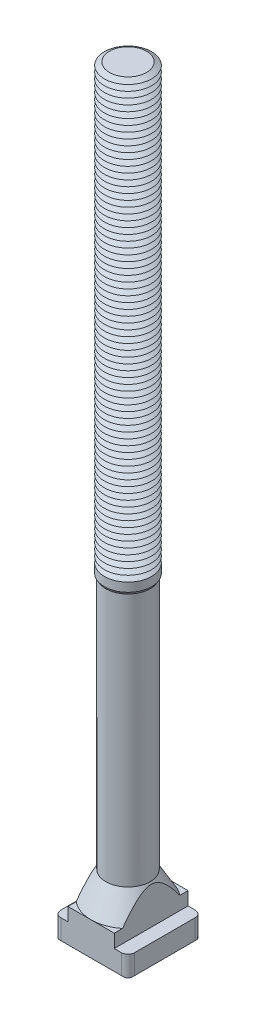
ISO-10303-21;
HEADER;
FILE_DESCRIPTION(('STEP AP214'),'2;1');
FILE_NAME('part.step','',(''),(''),'','','');
FILE_SCHEMA(('AUTOMOTIVE_DESIGN { 1 0 10303 214 1 1 1 1 }'));
ENDSEC;
DATA;
#1=APPLICATION_CONTEXT('core data for automotive mechanical design processes');
#2=APPLICATION_PROTOCOL_DEFINITION('international standard','automotive_design',2000,#1);
#3=PRODUCT_CONTEXT('',#1,'mechanical');
#4=PRODUCT('Part','Part','',(#3));
#5=PRODUCT_RELATED_PRODUCT_CATEGORY('part','',(#4));
#6=PRODUCT_DEFINITION_FORMATION('','',#4);
#7=PRODUCT_DEFINITION_CONTEXT('part definition',#1,'design');
#8=PRODUCT_DEFINITION('design','',#6,#7);
#9=PRODUCT_DEFINITION_SHAPE('','',#8);
#10=(LENGTH_UNIT() NAMED_UNIT(*) SI_UNIT(.MILLI.,.METRE.));
#11=(NAMED_UNIT(*) PLANE_ANGLE_UNIT() SI_UNIT($,.RADIAN.));
#12=(NAMED_UNIT(*) SI_UNIT($,.STERADIAN.) SOLID_ANGLE_UNIT());
#13=UNCERTAINTY_MEASURE_WITH_UNIT(LENGTH_MEASURE(1.E-05),#10,'distance_accuracy_value','');
#14=(GEOMETRIC_REPRESENTATION_CONTEXT(3) GLOBAL_UNCERTAINTY_ASSIGNED_CONTEXT((#13)) GLOBAL_UNIT_ASSIGNED_CONTEXT((#10,
#11,#12)) REPRESENTATION_CONTEXT('',''));
#15=CARTESIAN_POINT('',(0.,0.,0.));
#16=DIRECTION('',(0.,0.,1.));
#17=DIRECTION('',(1.,0.,0.));
#18=AXIS2_PLACEMENT_3D('',#15,#16,#17);
#19=CARTESIAN_POINT('',(0.,251.,0.));
#20=DIRECTION('',(0.,-1.,0.));
#21=DIRECTION('',(0.,0.,-1.));
#22=AXIS2_PLACEMENT_3D('',#19,#20,#21);
#23=CONICAL_SURFACE('',#22,6.26794919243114,1.0471975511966);
#24=CARTESIAN_POINT('',(0.,250.,0.));
#25=DIRECTION('',(0.,-1.,0.));
#26=DIRECTION('',(0.,0.,-1.));
#27=AXIS2_PLACEMENT_3D('',#24,#25,#26);
#28=CIRCLE('',#27,8.00000000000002);
#29=CARTESIAN_POINT('',(0.,250.,-8.00000000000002));
#30=VERTEX_POINT('',#29);
#31=EDGE_CURVE('E900',#30,#30,#28,.T.);
#32=ORIENTED_EDGE('',*,*,#31,.F.);
#33=EDGE_LOOP('',(#32));
#34=FACE_BOUND('',#33,.T.);
#35=CARTESIAN_POINT('',(0.,251.,0.));
#36=DIRECTION('',(0.,-1.,0.));
#37=DIRECTION('',(0.,0.,-1.));
#38=AXIS2_PLACEMENT_3D('',#35,#36,#37);
#39=CIRCLE('',#38,6.26794919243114);
#40=CARTESIAN_POINT('',(0.,251.,-6.26794919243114));
#41=VERTEX_POINT('',#40);
#42=EDGE_CURVE('E865',#41,#41,#39,.T.);
#43=ORIENTED_EDGE('',*,*,#42,.T.);
#44=EDGE_LOOP('',(#43));
#45=FACE_BOUND('',#44,.T.);
#46=ADVANCED_FACE('F39',(#34,#45),#23,.T.);
#47=CARTESIAN_POINT('',(0.,252.,0.));
#48=DIRECTION('',(0.,1.,0.));
#49=DIRECTION('',(0.,0.,1.));
#50=AXIS2_PLACEMENT_3D('',#47,#48,#49);
#51=CONICAL_SURFACE('',#50,8.00000000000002,1.0471975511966);
#52=ORIENTED_EDGE('',*,*,#42,.F.);
#53=EDGE_LOOP('',(#52));
#54=FACE_BOUND('',#53,.T.);
#55=CARTESIAN_POINT('',(0.,252.,0.));
#56=DIRECTION('',(0.,-1.,0.));
#57=DIRECTION('',(0.,0.,-1.));
#58=AXIS2_PLACEMENT_3D('',#55,#56,#57);
#59=CIRCLE('',#58,8.00000000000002);
#60=CARTESIAN_POINT('',(0.,252.,-8.00000000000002));
#61=VERTEX_POINT('',#60);
#62=EDGE_CURVE('E862',#61,#61,#59,.T.);
#63=ORIENTED_EDGE('',*,*,#62,.T.);
#64=EDGE_LOOP('',(#63));
#65=FACE_BOUND('',#64,.T.);
#66=ADVANCED_FACE('F448',(#54,#65),#51,.T.);
#67=CARTESIAN_POINT('',(3.98892164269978,259.,0.));
#68=DIRECTION('',(0.,-1.,0.));
#69=DIRECTION('',(1.,0.,0.));
#70=AXIS2_PLACEMENT_3D('',#67,#68,#69);
#71=PLANE('',#70);
#72=CARTESIAN_POINT('',(0.,259.,0.));
#73=DIRECTION('',(0.,-1.,0.));
#74=DIRECTION('',(0.,0.,-1.));
#75=AXIS2_PLACEMENT_3D('',#72,#73,#74);
#76=CIRCLE('',#75,6.26794919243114);
#77=CARTESIAN_POINT('',(0.,259.,-6.26794919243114));
#78=VERTEX_POINT('',#77);
#79=EDGE_CURVE('E703',#78,#78,#76,.T.);
#80=ORIENTED_EDGE('',*,*,#79,.F.);
#81=EDGE_LOOP('',(#80));
#82=FACE_BOUND('',#81,.T.);
#83=ADVANCED_FACE('F454',(#82),#71,.F.);
#84=CARTESIAN_POINT('',(0.,259.,0.));
#85=DIRECTION('',(0.,-1.,0.));
#86=DIRECTION('',(0.,0.,-1.));
#87=AXIS2_PLACEMENT_3D('',#84,#85,#86);
#88=CONICAL_SURFACE('',#87,6.26794919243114,1.0471975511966);
#89=CARTESIAN_POINT('',(0.,258.,0.));
#90=DIRECTION('',(0.,-1.,0.));
#91=DIRECTION('',(0.,0.,-1.));
#92=AXIS2_PLACEMENT_3D('',#89,#90,#91);
#93=CIRCLE('',#92,8.00000000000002);
#94=CARTESIAN_POINT('',(0.,258.,-8.00000000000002));
#95=VERTEX_POINT('',#94);
#96=EDGE_CURVE('E705',#95,#95,#93,.T.);
#97=ORIENTED_EDGE('',*,*,#96,.F.);
#98=EDGE_LOOP('',(#97));
#99=FACE_BOUND('',#98,.T.);
#100=ORIENTED_EDGE('',*,*,#79,.T.);
#101=EDGE_LOOP('',(#100));
#102=FACE_BOUND('',#101,.T.);
#103=ADVANCED_FACE('F482',(#99,#102),#88,.T.);
#104=CARTESIAN_POINT('',(0.,258.,0.));
#105=DIRECTION('',(0.,1.,0.));
#106=DIRECTION('',(0.,0.,1.));
#107=AXIS2_PLACEMENT_3D('',#104,#105,#106);
#108=CONICAL_SURFACE('',#107,8.00000000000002,1.0471975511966);
#109=CARTESIAN_POINT('',(0.,257.,0.));
#110=DIRECTION('',(0.,-1.,0.));
#111=DIRECTION('',(0.,0.,-1.));
#112=AXIS2_PLACEMENT_3D('',#109,#110,#111);
#113=CIRCLE('',#112,6.26794919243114);
#114=CARTESIAN_POINT('',(0.,257.,-6.26794919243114));
#115=VERTEX_POINT('',#114);
#116=EDGE_CURVE('E759',#115,#115,#113,.T.);
#117=ORIENTED_EDGE('',*,*,#116,.F.);
#118=EDGE_LOOP('',(#117));
#119=FACE_BOUND('',#118,.T.);
#120=ORIENTED_EDGE('',*,*,#96,.T.);
#121=EDGE_LOOP('',(#120));
#122=FACE_BOUND('',#121,.T.);
#123=ADVANCED_FACE('F479',(#119,#122),#108,.T.);
#124=CARTESIAN_POINT('',(0.,257.,0.));
#125=DIRECTION('',(0.,-1.,0.));
#126=DIRECTION('',(0.,0.,-1.));
#127=AXIS2_PLACEMENT_3D('',#124,#125,#126);
#128=CONICAL_SURFACE('',#127,6.26794919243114,1.0471975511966);
#129=CARTESIAN_POINT('',(0.,256.,0.));
#130=DIRECTION('',(0.,-1.,0.));
#131=DIRECTION('',(0.,0.,-1.));
#132=AXIS2_PLACEMENT_3D('',#129,#130,#131);
#133=CIRCLE('',#132,8.00000000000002);
#134=CARTESIAN_POINT('',(0.,256.,-8.00000000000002));
#135=VERTEX_POINT('',#134);
#136=EDGE_CURVE('E756',#135,#135,#133,.T.);
#137=ORIENTED_EDGE('',*,*,#136,.F.);
#138=EDGE_LOOP('',(#137));
#139=FACE_BOUND('',#138,.T.);
#140=ORIENTED_EDGE('',*,*,#116,.T.);
#141=EDGE_LOOP('',(#140));
#142=FACE_BOUND('',#141,.T.);
#143=ADVANCED_FACE('F474',(#139,#142),#128,.T.);
#144=CARTESIAN_POINT('',(0.,256.,0.));
#145=DIRECTION('',(0.,1.,0.));
#146=DIRECTION('',(0.,0.,1.));
#147=AXIS2_PLACEMENT_3D('',#144,#145,#146);
#148=CONICAL_SURFACE('',#147,8.00000000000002,1.0471975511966);
#149=CARTESIAN_POINT('',(0.,255.,0.));
#150=DIRECTION('',(0.,-1.,0.));
#151=DIRECTION('',(0.,0.,-1.));
#152=AXIS2_PLACEMENT_3D('',#149,#150,#151);
#153=CIRCLE('',#152,6.26794919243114);
#154=CARTESIAN_POINT('',(0.,255.,-6.26794919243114));
#155=VERTEX_POINT('',#154);
#156=EDGE_CURVE('E760',#155,#155,#153,.T.);
#157=ORIENTED_EDGE('',*,*,#156,.F.);
#158=EDGE_LOOP('',(#157));
#159=FACE_BOUND('',#158,.T.);
#160=ORIENTED_EDGE('',*,*,#136,.T.);
#161=EDGE_LOOP('',(#160));
#162=FACE_BOUND('',#161,.T.);
#163=ADVANCED_FACE('F471',(#159,#162),#148,.T.);
#164=CARTESIAN_POINT('',(0.,255.,0.));
#165=DIRECTION('',(0.,-1.,0.));
#166=DIRECTION('',(0.,0.,-1.));
#167=AXIS2_PLACEMENT_3D('',#164,#165,#166);
#168=CONICAL_SURFACE('',#167,6.26794919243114,1.0471975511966);
#169=CARTESIAN_POINT('',(0.,254.,0.));
#170=DIRECTION('',(0.,-1.,0.));
#171=DIRECTION('',(0.,0.,-1.));
#172=AXIS2_PLACEMENT_3D('',#169,#170,#171);
#173=CIRCLE('',#172,8.00000000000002);
#174=CARTESIAN_POINT('',(0.,254.,-8.00000000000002));
#175=VERTEX_POINT('',#174);
#176=EDGE_CURVE('E792',#175,#175,#173,.T.);
#177=ORIENTED_EDGE('',*,*,#176,.F.);
#178=EDGE_LOOP('',(#177));
#179=FACE_BOUND('',#178,.T.);
#180=ORIENTED_EDGE('',*,*,#156,.T.);
#181=EDGE_LOOP('',(#180));
#182=FACE_BOUND('',#181,.T.);
#183=ADVANCED_FACE('F465',(#179,#182),#168,.T.);
#184=CARTESIAN_POINT('',(0.,254.,0.));
#185=DIRECTION('',(0.,1.,0.));
#186=DIRECTION('',(0.,0.,1.));
#187=AXIS2_PLACEMENT_3D('',#184,#185,#186);
#188=CONICAL_SURFACE('',#187,8.00000000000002,1.0471975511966);
#189=CARTESIAN_POINT('',(0.,253.,0.));
#190=DIRECTION('',(0.,-1.,0.));
#191=DIRECTION('',(0.,0.,-1.));
#192=AXIS2_PLACEMENT_3D('',#189,#190,#191);
#193=CIRCLE('',#192,6.26794919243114);
#194=CARTESIAN_POINT('',(0.,253.,-6.26794919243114));
#195=VERTEX_POINT('',#194);
#196=EDGE_CURVE('E795',#195,#195,#193,.T.);
#197=ORIENTED_EDGE('',*,*,#196,.F.);
#198=EDGE_LOOP('',(#197));
#199=FACE_BOUND('',#198,.T.);
#200=ORIENTED_EDGE('',*,*,#176,.T.);
#201=EDGE_LOOP('',(#200));
#202=FACE_BOUND('',#201,.T.);
#203=ADVANCED_FACE('F461',(#199,#202),#188,.T.);
#204=CARTESIAN_POINT('',(0.,253.,0.));
#205=DIRECTION('',(0.,-1.,0.));
#206=DIRECTION('',(0.,0.,-1.));
#207=AXIS2_PLACEMENT_3D('',#204,#205,#206);
#208=CONICAL_SURFACE('',#207,6.26794919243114,1.0471975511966);
#209=ORIENTED_EDGE('',*,*,#62,.F.);
#210=EDGE_LOOP('',(#209));
#211=FACE_BOUND('',#210,.T.);
#212=ORIENTED_EDGE('',*,*,#196,.T.);
#213=EDGE_LOOP('',(#212));
#214=FACE_BOUND('',#213,.T.);
#215=ADVANCED_FACE('F464',(#211,#214),#208,.T.);
#216=CARTESIAN_POINT('',(0.,249.,0.));
#217=DIRECTION('',(0.,-1.,0.));
#218=DIRECTION('',(0.,0.,-1.));
#219=AXIS2_PLACEMENT_3D('',#216,#217,#218);
#220=CONICAL_SURFACE('',#219,6.26794919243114,1.0471975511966);
#221=CARTESIAN_POINT('',(0.,248.,0.));
#222=DIRECTION('',(0.,-1.,0.));
#223=DIRECTION('',(0.,0.,-1.));
#224=AXIS2_PLACEMENT_3D('',#221,#222,#223);
#225=CIRCLE('',#224,8.00000000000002);
#226=CARTESIAN_POINT('',(0.,248.,-8.00000000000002));
#227=VERTEX_POINT('',#226);
#228=EDGE_CURVE('E1023',#227,#227,#225,.T.);
#229=ORIENTED_EDGE('',*,*,#228,.F.);
#230=EDGE_LOOP('',(#229));
#231=FACE_BOUND('',#230,.T.);
#232=CARTESIAN_POINT('',(0.,249.,0.));
#233=DIRECTION('',(0.,-1.,0.));
#234=DIRECTION('',(0.,0.,-1.));
#235=AXIS2_PLACEMENT_3D('',#232,#233,#234);
#236=CIRCLE('',#235,6.26794919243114);
#237=CARTESIAN_POINT('',(0.,249.,-6.26794919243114));
#238=VERTEX_POINT('',#237);
#239=EDGE_CURVE('E1026',#238,#238,#236,.T.);
#240=ORIENTED_EDGE('',*,*,#239,.T.);
#241=EDGE_LOOP('',(#240));
#242=FACE_BOUND('',#241,.T.);
#243=ADVANCED_FACE('F469',(#231,#242),#220,.T.);
#244=CARTESIAN_POINT('',(0.,250.,0.));
#245=DIRECTION('',(0.,1.,0.));
#246=DIRECTION('',(0.,0.,1.));
#247=AXIS2_PLACEMENT_3D('',#244,#245,#246);
#248=CONICAL_SURFACE('',#247,8.00000000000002,1.0471975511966);
#249=ORIENTED_EDGE('',*,*,#239,.F.);
#250=EDGE_LOOP('',(#249));
#251=FACE_BOUND('',#250,.T.);
#252=ORIENTED_EDGE('',*,*,#31,.T.);
#253=EDGE_LOOP('',(#252));
#254=FACE_BOUND('',#253,.T.);
#255=ADVANCED_FACE('F1277',(#251,#254),#248,.T.);
#256=CARTESIAN_POINT('',(0.,247.,0.));
#257=DIRECTION('',(0.,-1.,0.));
#258=DIRECTION('',(0.,0.,-1.));
#259=AXIS2_PLACEMENT_3D('',#256,#257,#258);
#260=CONICAL_SURFACE('',#259,6.26794919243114,1.0471975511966);
#261=CARTESIAN_POINT('',(0.,246.,0.));
#262=DIRECTION('',(0.,-1.,0.));
#263=DIRECTION('',(0.,0.,-1.));
#264=AXIS2_PLACEMENT_3D('',#261,#262,#263);
#265=CIRCLE('',#264,8.00000000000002);
#266=CARTESIAN_POINT('',(0.,246.,-8.00000000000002));
#267=VERTEX_POINT('',#266);
#268=EDGE_CURVE('E696',#267,#267,#265,.T.);
#269=ORIENTED_EDGE('',*,*,#268,.F.);
#270=EDGE_LOOP('',(#269));
#271=FACE_BOUND('',#270,.T.);
#272=CARTESIAN_POINT('',(0.,247.,0.));
#273=DIRECTION('',(0.,-1.,0.));
#274=DIRECTION('',(0.,0.,-1.));
#275=AXIS2_PLACEMENT_3D('',#272,#273,#274);
#276=CIRCLE('',#275,6.26794919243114);
#277=CARTESIAN_POINT('',(0.,247.,-6.26794919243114));
#278=VERTEX_POINT('',#277);
#279=EDGE_CURVE('E701',#278,#278,#276,.T.);
#280=ORIENTED_EDGE('',*,*,#279,.T.);
#281=EDGE_LOOP('',(#280));
#282=FACE_BOUND('',#281,.T.);
#283=ADVANCED_FACE('F1273',(#271,#282),#260,.T.);
#284=CARTESIAN_POINT('',(0.,248.,0.));
#285=DIRECTION('',(0.,1.,0.));
#286=DIRECTION('',(0.,0.,1.));
#287=AXIS2_PLACEMENT_3D('',#284,#285,#286);
#288=CONICAL_SURFACE('',#287,8.00000000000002,1.0471975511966);
#289=ORIENTED_EDGE('',*,*,#279,.F.);
#290=EDGE_LOOP('',(#289));
#291=FACE_BOUND('',#290,.T.);
#292=ORIENTED_EDGE('',*,*,#228,.T.);
#293=EDGE_LOOP('',(#292));
#294=FACE_BOUND('',#293,.T.);
#295=ADVANCED_FACE('F1269',(#291,#294),#288,.T.);
#296=CARTESIAN_POINT('',(0.,245.,0.));
#297=DIRECTION('',(0.,-1.,0.));
#298=DIRECTION('',(0.,0.,-1.));
#299=AXIS2_PLACEMENT_3D('',#296,#297,#298);
#300=CONICAL_SURFACE('',#299,6.26794919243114,1.0471975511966);
#301=CARTESIAN_POINT('',(0.,244.,0.));
#302=DIRECTION('',(0.,-1.,0.));
#303=DIRECTION('',(0.,0.,-1.));
#304=AXIS2_PLACEMENT_3D('',#301,#302,#303);
#305=CIRCLE('',#304,8.00000000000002);
#306=CARTESIAN_POINT('',(0.,244.,-8.00000000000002));
#307=VERTEX_POINT('',#306);
#308=EDGE_CURVE('E697',#307,#307,#305,.T.);
#309=ORIENTED_EDGE('',*,*,#308,.F.);
#310=EDGE_LOOP('',(#309));
#311=FACE_BOUND('',#310,.T.);
#312=CARTESIAN_POINT('',(0.,245.,0.));
#313=DIRECTION('',(0.,-1.,0.));
#314=DIRECTION('',(0.,0.,-1.));
#315=AXIS2_PLACEMENT_3D('',#312,#313,#314);
#316=CIRCLE('',#315,6.26794919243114);
#317=CARTESIAN_POINT('',(0.,245.,-6.26794919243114));
#318=VERTEX_POINT('',#317);
#319=EDGE_CURVE('E693',#318,#318,#316,.T.);
#320=ORIENTED_EDGE('',*,*,#319,.T.);
#321=EDGE_LOOP('',(#320));
#322=FACE_BOUND('',#321,.T.);
#323=ADVANCED_FACE('F1265',(#311,#322),#300,.T.);
#324=CARTESIAN_POINT('',(0.,246.,0.));
#325=DIRECTION('',(0.,1.,0.));
#326=DIRECTION('',(0.,0.,1.));
#327=AXIS2_PLACEMENT_3D('',#324,#325,#326);
#328=CONICAL_SURFACE('',#327,8.00000000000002,1.0471975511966);
#329=ORIENTED_EDGE('',*,*,#319,.F.);
#330=EDGE_LOOP('',(#329));
#331=FACE_BOUND('',#330,.T.);
#332=ORIENTED_EDGE('',*,*,#268,.T.);
#333=EDGE_LOOP('',(#332));
#334=FACE_BOUND('',#333,.T.);
#335=ADVANCED_FACE('F1261',(#331,#334),#328,.T.);
#336=CARTESIAN_POINT('',(0.,243.,0.));
#337=DIRECTION('',(0.,-1.,0.));
#338=DIRECTION('',(0.,0.,-1.));
#339=AXIS2_PLACEMENT_3D('',#336,#337,#338);
#340=CONICAL_SURFACE('',#339,6.26794919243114,1.0471975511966);
#341=CARTESIAN_POINT('',(0.,242.,0.));
#342=DIRECTION('',(0.,-1.,0.));
#343=DIRECTION('',(0.,0.,-1.));
#344=AXIS2_PLACEMENT_3D('',#341,#342,#343);
#345=CIRCLE('',#344,8.00000000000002);
#346=CARTESIAN_POINT('',(0.,242.,-8.00000000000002));
#347=VERTEX_POINT('',#346);
#348=EDGE_CURVE('E690',#347,#347,#345,.T.);
#349=ORIENTED_EDGE('',*,*,#348,.F.);
#350=EDGE_LOOP('',(#349));
#351=FACE_BOUND('',#350,.T.);
#352=CARTESIAN_POINT('',(0.,243.,0.));
#353=DIRECTION('',(0.,-1.,0.));
#354=DIRECTION('',(0.,0.,-1.));
#355=AXIS2_PLACEMENT_3D('',#352,#353,#354);
#356=CIRCLE('',#355,6.26794919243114);
#357=CARTESIAN_POINT('',(0.,243.,-6.26794919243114));
#358=VERTEX_POINT('',#357);
#359=EDGE_CURVE('E1013',#358,#358,#356,.T.);
#360=ORIENTED_EDGE('',*,*,#359,.T.);
#361=EDGE_LOOP('',(#360));
#362=FACE_BOUND('',#361,.T.);
#363=ADVANCED_FACE('F1257',(#351,#362),#340,.T.);
#364=CARTESIAN_POINT('',(0.,244.,0.));
#365=DIRECTION('',(0.,1.,0.));
#366=DIRECTION('',(0.,0.,1.));
#367=AXIS2_PLACEMENT_3D('',#364,#365,#366);
#368=CONICAL_SURFACE('',#367,8.00000000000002,1.0471975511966);
#369=ORIENTED_EDGE('',*,*,#359,.F.);
#370=EDGE_LOOP('',(#369));
#371=FACE_BOUND('',#370,.T.);
#372=ORIENTED_EDGE('',*,*,#308,.T.);
#373=EDGE_LOOP('',(#372));
#374=FACE_BOUND('',#373,.T.);
#375=ADVANCED_FACE('F1253',(#371,#374),#368,.T.);
#376=CARTESIAN_POINT('',(0.,241.,0.));
#377=DIRECTION('',(0.,-1.,0.));
#378=DIRECTION('',(0.,0.,-1.));
#379=AXIS2_PLACEMENT_3D('',#376,#377,#378);
#380=CONICAL_SURFACE('',#379,6.26794919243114,1.0471975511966);
#381=CARTESIAN_POINT('',(0.,240.,0.));
#382=DIRECTION('',(0.,-1.,0.));
#383=DIRECTION('',(0.,0.,-1.));
#384=AXIS2_PLACEMENT_3D('',#381,#382,#383);
#385=CIRCLE('',#384,8.00000000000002);
#386=CARTESIAN_POINT('',(0.,240.,-8.00000000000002));
#387=VERTEX_POINT('',#386);
#388=EDGE_CURVE('E691',#387,#387,#385,.T.);
#389=ORIENTED_EDGE('',*,*,#388,.F.);
#390=EDGE_LOOP('',(#389));
#391=FACE_BOUND('',#390,.T.);
#392=CARTESIAN_POINT('',(0.,241.,0.));
#393=DIRECTION('',(0.,-1.,0.));
#394=DIRECTION('',(0.,0.,-1.));
#395=AXIS2_PLACEMENT_3D('',#392,#393,#394);
#396=CIRCLE('',#395,6.26794919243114);
#397=CARTESIAN_POINT('',(0.,241.,-6.26794919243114));
#398=VERTEX_POINT('',#397);
#399=EDGE_CURVE('E687',#398,#398,#396,.T.);
#400=ORIENTED_EDGE('',*,*,#399,.T.);
#401=EDGE_LOOP('',(#400));
#402=FACE_BOUND('',#401,.T.);
#403=ADVANCED_FACE('F1249',(#391,#402),#380,.T.);
#404=CARTESIAN_POINT('',(0.,242.,0.));
#405=DIRECTION('',(0.,1.,0.));
#406=DIRECTION('',(0.,0.,1.));
#407=AXIS2_PLACEMENT_3D('',#404,#405,#406);
#408=CONICAL_SURFACE('',#407,8.00000000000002,1.0471975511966);
#409=ORIENTED_EDGE('',*,*,#399,.F.);
#410=EDGE_LOOP('',(#409));
#411=FACE_BOUND('',#410,.T.);
#412=ORIENTED_EDGE('',*,*,#348,.T.);
#413=EDGE_LOOP('',(#412));
#414=FACE_BOUND('',#413,.T.);
#415=ADVANCED_FACE('F1245',(#411,#414),#408,.T.);
#416=CARTESIAN_POINT('',(0.,239.,0.));
#417=DIRECTION('',(0.,-1.,0.));
#418=DIRECTION('',(0.,0.,-1.));
#419=AXIS2_PLACEMENT_3D('',#416,#417,#418);
#420=CONICAL_SURFACE('',#419,6.26794919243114,1.0471975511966);
#421=CARTESIAN_POINT('',(0.,238.,0.));
#422=DIRECTION('',(0.,-1.,0.));
#423=DIRECTION('',(0.,0.,-1.));
#424=AXIS2_PLACEMENT_3D('',#421,#422,#423);
#425=CIRCLE('',#424,8.00000000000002);
#426=CARTESIAN_POINT('',(0.,238.,-8.00000000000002));
#427=VERTEX_POINT('',#426);
#428=EDGE_CURVE('E920',#427,#427,#425,.T.);
#429=ORIENTED_EDGE('',*,*,#428,.F.);
#430=EDGE_LOOP('',(#429));
#431=FACE_BOUND('',#430,.T.);
#432=CARTESIAN_POINT('',(0.,239.,0.));
#433=DIRECTION('',(0.,-1.,0.));
#434=DIRECTION('',(0.,0.,-1.));
#435=AXIS2_PLACEMENT_3D('',#432,#433,#434);
#436=CIRCLE('',#435,6.26794919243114);
#437=CARTESIAN_POINT('',(0.,239.,-6.26794919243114));
#438=VERTEX_POINT('',#437);
#439=EDGE_CURVE('E1003',#438,#438,#436,.T.);
#440=ORIENTED_EDGE('',*,*,#439,.T.);
#441=EDGE_LOOP('',(#440));
#442=FACE_BOUND('',#441,.T.);
#443=ADVANCED_FACE('F1241',(#431,#442),#420,.T.);
#444=CARTESIAN_POINT('',(0.,240.,0.));
#445=DIRECTION('',(0.,1.,0.));
#446=DIRECTION('',(0.,0.,1.));
#447=AXIS2_PLACEMENT_3D('',#444,#445,#446);
#448=CONICAL_SURFACE('',#447,8.00000000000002,1.0471975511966);
#449=ORIENTED_EDGE('',*,*,#439,.F.);
#450=EDGE_LOOP('',(#449));
#451=FACE_BOUND('',#450,.T.);
#452=ORIENTED_EDGE('',*,*,#388,.T.);
#453=EDGE_LOOP('',(#452));
#454=FACE_BOUND('',#453,.T.);
#455=ADVANCED_FACE('F1237',(#451,#454),#448,.T.);
#456=CARTESIAN_POINT('',(0.,237.,0.));
#457=DIRECTION('',(0.,-1.,0.));
#458=DIRECTION('',(0.,0.,-1.));
#459=AXIS2_PLACEMENT_3D('',#456,#457,#458);
#460=CONICAL_SURFACE('',#459,6.26794919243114,1.0471975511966);
#461=CARTESIAN_POINT('',(0.,236.,0.));
#462=DIRECTION('',(0.,-1.,0.));
#463=DIRECTION('',(0.,0.,-1.));
#464=AXIS2_PLACEMENT_3D('',#461,#462,#463);
#465=CIRCLE('',#464,8.00000000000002);
#466=CARTESIAN_POINT('',(0.,236.,-8.00000000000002));
#467=VERTEX_POINT('',#466);
#468=EDGE_CURVE('E921',#467,#467,#465,.T.);
#469=ORIENTED_EDGE('',*,*,#468,.F.);
#470=EDGE_LOOP('',(#469));
#471=FACE_BOUND('',#470,.T.);
#472=CARTESIAN_POINT('',(0.,237.,0.));
#473=DIRECTION('',(0.,-1.,0.));
#474=DIRECTION('',(0.,0.,-1.));
#475=AXIS2_PLACEMENT_3D('',#472,#473,#474);
#476=CIRCLE('',#475,6.26794919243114);
#477=CARTESIAN_POINT('',(0.,237.,-6.26794919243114));
#478=VERTEX_POINT('',#477);
#479=EDGE_CURVE('E918',#478,#478,#476,.T.);
#480=ORIENTED_EDGE('',*,*,#479,.T.);
#481=EDGE_LOOP('',(#480));
#482=FACE_BOUND('',#481,.T.);
#483=ADVANCED_FACE('F1233',(#471,#482),#460,.T.);
#484=CARTESIAN_POINT('',(0.,238.,0.));
#485=DIRECTION('',(0.,1.,0.));
#486=DIRECTION('',(0.,0.,1.));
#487=AXIS2_PLACEMENT_3D('',#484,#485,#486);
#488=CONICAL_SURFACE('',#487,8.00000000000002,1.0471975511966);
#489=ORIENTED_EDGE('',*,*,#479,.F.);
#490=EDGE_LOOP('',(#489));
#491=FACE_BOUND('',#490,.T.);
#492=ORIENTED_EDGE('',*,*,#428,.T.);
#493=EDGE_LOOP('',(#492));
#494=FACE_BOUND('',#493,.T.);
#495=ADVANCED_FACE('F1229',(#491,#494),#488,.T.);
#496=CARTESIAN_POINT('',(0.,235.,0.));
#497=DIRECTION('',(0.,-1.,0.));
#498=DIRECTION('',(0.,0.,-1.));
#499=AXIS2_PLACEMENT_3D('',#496,#497,#498);
#500=CONICAL_SURFACE('',#499,6.26794919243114,1.0471975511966);
#501=CARTESIAN_POINT('',(0.,234.,0.));
#502=DIRECTION('',(0.,-1.,0.));
#503=DIRECTION('',(0.,0.,-1.));
#504=AXIS2_PLACEMENT_3D('',#501,#502,#503);
#505=CIRCLE('',#504,8.00000000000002);
#506=CARTESIAN_POINT('',(0.,234.,-8.00000000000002));
#507=VERTEX_POINT('',#506);
#508=EDGE_CURVE('E859',#507,#507,#505,.T.);
#509=ORIENTED_EDGE('',*,*,#508,.F.);
#510=EDGE_LOOP('',(#509));
#511=FACE_BOUND('',#510,.T.);
#512=CARTESIAN_POINT('',(0.,235.,0.));
#513=DIRECTION('',(0.,-1.,0.));
#514=DIRECTION('',(0.,0.,-1.));
#515=AXIS2_PLACEMENT_3D('',#512,#513,#514);
#516=CIRCLE('',#515,6.26794919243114);
#517=CARTESIAN_POINT('',(0.,235.,-6.26794919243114));
#518=VERTEX_POINT('',#517);
#519=EDGE_CURVE('E993',#518,#518,#516,.T.);
#520=ORIENTED_EDGE('',*,*,#519,.T.);
#521=EDGE_LOOP('',(#520));
#522=FACE_BOUND('',#521,.T.);
#523=ADVANCED_FACE('F1225',(#511,#522),#500,.T.);
#524=CARTESIAN_POINT('',(0.,236.,0.));
#525=DIRECTION('',(0.,1.,0.));
#526=DIRECTION('',(0.,0.,1.));
#527=AXIS2_PLACEMENT_3D('',#524,#525,#526);
#528=CONICAL_SURFACE('',#527,8.00000000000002,1.0471975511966);
#529=ORIENTED_EDGE('',*,*,#519,.F.);
#530=EDGE_LOOP('',(#529));
#531=FACE_BOUND('',#530,.T.);
#532=ORIENTED_EDGE('',*,*,#468,.T.);
#533=EDGE_LOOP('',(#532));
#534=FACE_BOUND('',#533,.T.);
#535=ADVANCED_FACE('F1221',(#531,#534),#528,.T.);
#536=CARTESIAN_POINT('',(0.,233.,0.));
#537=DIRECTION('',(0.,-1.,0.));
#538=DIRECTION('',(0.,0.,-1.));
#539=AXIS2_PLACEMENT_3D('',#536,#537,#538);
#540=CONICAL_SURFACE('',#539,6.26794919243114,1.0471975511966);
#541=CARTESIAN_POINT('',(0.,232.,0.));
#542=DIRECTION('',(0.,-1.,0.));
#543=DIRECTION('',(0.,0.,-1.));
#544=AXIS2_PLACEMENT_3D('',#541,#542,#543);
#545=CIRCLE('',#544,8.00000000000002);
#546=CARTESIAN_POINT('',(0.,232.,-8.00000000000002));
#547=VERTEX_POINT('',#546);
#548=EDGE_CURVE('E860',#547,#547,#545,.T.);
#549=ORIENTED_EDGE('',*,*,#548,.F.);
#550=EDGE_LOOP('',(#549));
#551=FACE_BOUND('',#550,.T.);
#552=CARTESIAN_POINT('',(0.,233.,0.));
#553=DIRECTION('',(0.,-1.,0.));
#554=DIRECTION('',(0.,0.,-1.));
#555=AXIS2_PLACEMENT_3D('',#552,#553,#554);
#556=CIRCLE('',#555,6.26794919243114);
#557=CARTESIAN_POINT('',(0.,233.,-6.26794919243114));
#558=VERTEX_POINT('',#557);
#559=EDGE_CURVE('E856',#558,#558,#556,.T.);
#560=ORIENTED_EDGE('',*,*,#559,.T.);
#561=EDGE_LOOP('',(#560));
#562=FACE_BOUND('',#561,.T.);
#563=ADVANCED_FACE('F1217',(#551,#562),#540,.T.);
#564=CARTESIAN_POINT('',(0.,234.,0.));
#565=DIRECTION('',(0.,1.,0.));
#566=DIRECTION('',(0.,0.,1.));
#567=AXIS2_PLACEMENT_3D('',#564,#565,#566);
#568=CONICAL_SURFACE('',#567,8.00000000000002,1.0471975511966);
#569=ORIENTED_EDGE('',*,*,#559,.F.);
#570=EDGE_LOOP('',(#569));
#571=FACE_BOUND('',#570,.T.);
#572=ORIENTED_EDGE('',*,*,#508,.T.);
#573=EDGE_LOOP('',(#572));
#574=FACE_BOUND('',#573,.T.);
#575=ADVANCED_FACE('F1213',(#571,#574),#568,.T.);
#576=CARTESIAN_POINT('',(0.,231.,0.));
#577=DIRECTION('',(0.,-1.,0.));
#578=DIRECTION('',(0.,0.,-1.));
#579=AXIS2_PLACEMENT_3D('',#576,#577,#578);
#580=CONICAL_SURFACE('',#579,6.26794919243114,1.0471975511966);
#581=CARTESIAN_POINT('',(0.,230.,0.));
#582=DIRECTION('',(0.,-1.,0.));
#583=DIRECTION('',(0.,0.,-1.));
#584=AXIS2_PLACEMENT_3D('',#581,#582,#583);
#585=CIRCLE('',#584,8.00000000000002);
#586=CARTESIAN_POINT('',(0.,230.,-8.00000000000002));
#587=VERTEX_POINT('',#586);
#588=EDGE_CURVE('E750',#587,#587,#585,.T.);
#589=ORIENTED_EDGE('',*,*,#588,.F.);
#590=EDGE_LOOP('',(#589));
#591=FACE_BOUND('',#590,.T.);
#592=CARTESIAN_POINT('',(0.,231.,0.));
#593=DIRECTION('',(0.,-1.,0.));
#594=DIRECTION('',(0.,0.,-1.));
#595=AXIS2_PLACEMENT_3D('',#592,#593,#594);
#596=CIRCLE('',#595,6.26794919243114);
#597=CARTESIAN_POINT('',(0.,231.,-6.26794919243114));
#598=VERTEX_POINT('',#597);
#599=EDGE_CURVE('E753',#598,#598,#596,.T.);
#600=ORIENTED_EDGE('',*,*,#599,.T.);
#601=EDGE_LOOP('',(#600));
#602=FACE_BOUND('',#601,.T.);
#603=ADVANCED_FACE('F1209',(#591,#602),#580,.T.);
#604=CARTESIAN_POINT('',(0.,232.,0.));
#605=DIRECTION('',(0.,1.,0.));
#606=DIRECTION('',(0.,0.,1.));
#607=AXIS2_PLACEMENT_3D('',#604,#605,#606);
#608=CONICAL_SURFACE('',#607,8.00000000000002,1.0471975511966);
#609=ORIENTED_EDGE('',*,*,#599,.F.);
#610=EDGE_LOOP('',(#609));
#611=FACE_BOUND('',#610,.T.);
#612=ORIENTED_EDGE('',*,*,#548,.T.);
#613=EDGE_LOOP('',(#612));
#614=FACE_BOUND('',#613,.T.);
#615=ADVANCED_FACE('F1205',(#611,#614),#608,.T.);
#616=CARTESIAN_POINT('',(0.,229.,0.));
#617=DIRECTION('',(0.,-1.,0.));
#618=DIRECTION('',(0.,0.,-1.));
#619=AXIS2_PLACEMENT_3D('',#616,#617,#618);
#620=CONICAL_SURFACE('',#619,6.26794919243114,1.0471975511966);
#621=CARTESIAN_POINT('',(0.,228.,0.));
#622=DIRECTION('',(0.,-1.,0.));
#623=DIRECTION('',(0.,0.,-1.));
#624=AXIS2_PLACEMENT_3D('',#621,#622,#623);
#625=CIRCLE('',#624,8.00000000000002);
#626=CARTESIAN_POINT('',(0.,228.,-8.00000000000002));
#627=VERTEX_POINT('',#626);
#628=EDGE_CURVE('E971',#627,#627,#625,.T.);
#629=ORIENTED_EDGE('',*,*,#628,.F.);
#630=EDGE_LOOP('',(#629));
#631=FACE_BOUND('',#630,.T.);
#632=CARTESIAN_POINT('',(0.,229.,0.));
#633=DIRECTION('',(0.,-1.,0.));
#634=DIRECTION('',(0.,0.,-1.));
#635=AXIS2_PLACEMENT_3D('',#632,#633,#634);
#636=CIRCLE('',#635,6.26794919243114);
#637=CARTESIAN_POINT('',(0.,229.,-6.26794919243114));
#638=VERTEX_POINT('',#637);
#639=EDGE_CURVE('E754',#638,#638,#636,.T.);
#640=ORIENTED_EDGE('',*,*,#639,.T.);
#641=EDGE_LOOP('',(#640));
#642=FACE_BOUND('',#641,.T.);
#643=ADVANCED_FACE('F1201',(#631,#642),#620,.T.);
#644=CARTESIAN_POINT('',(0.,230.,0.));
#645=DIRECTION('',(0.,1.,0.));
#646=DIRECTION('',(0.,0.,1.));
#647=AXIS2_PLACEMENT_3D('',#644,#645,#646);
#648=CONICAL_SURFACE('',#647,8.00000000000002,1.0471975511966);
#649=ORIENTED_EDGE('',*,*,#639,.F.);
#650=EDGE_LOOP('',(#649));
#651=FACE_BOUND('',#650,.T.);
#652=ORIENTED_EDGE('',*,*,#588,.T.);
#653=EDGE_LOOP('',(#652));
#654=FACE_BOUND('',#653,.T.);
#655=ADVANCED_FACE('F1197',(#651,#654),#648,.T.);
#656=CARTESIAN_POINT('',(0.,227.,0.));
#657=DIRECTION('',(0.,-1.,0.));
#658=DIRECTION('',(0.,0.,-1.));
#659=AXIS2_PLACEMENT_3D('',#656,#657,#658);
#660=CONICAL_SURFACE('',#659,6.26794919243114,1.0471975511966);
#661=CARTESIAN_POINT('',(0.,226.,0.));
#662=DIRECTION('',(0.,-1.,0.));
#663=DIRECTION('',(0.,0.,-1.));
#664=AXIS2_PLACEMENT_3D('',#661,#662,#663);
#665=CIRCLE('',#664,8.00000000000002);
#666=CARTESIAN_POINT('',(0.,226.,-8.00000000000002));
#667=VERTEX_POINT('',#666);
#668=EDGE_CURVE('E962',#667,#667,#665,.T.);
#669=ORIENTED_EDGE('',*,*,#668,.F.);
#670=EDGE_LOOP('',(#669));
#671=FACE_BOUND('',#670,.T.);
#672=CARTESIAN_POINT('',(0.,227.,0.));
#673=DIRECTION('',(0.,-1.,0.));
#674=DIRECTION('',(0.,0.,-1.));
#675=AXIS2_PLACEMENT_3D('',#672,#673,#674);
#676=CIRCLE('',#675,6.26794919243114);
#677=CARTESIAN_POINT('',(0.,227.,-6.26794919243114));
#678=VERTEX_POINT('',#677);
#679=EDGE_CURVE('E964',#678,#678,#676,.T.);
#680=ORIENTED_EDGE('',*,*,#679,.T.);
#681=EDGE_LOOP('',(#680));
#682=FACE_BOUND('',#681,.T.);
#683=ADVANCED_FACE('F1193',(#671,#682),#660,.T.);
#684=CARTESIAN_POINT('',(0.,228.,0.));
#685=DIRECTION('',(0.,1.,0.));
#686=DIRECTION('',(0.,0.,1.));
#687=AXIS2_PLACEMENT_3D('',#684,#685,#686);
#688=CONICAL_SURFACE('',#687,8.00000000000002,1.0471975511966);
#689=ORIENTED_EDGE('',*,*,#679,.F.);
#690=EDGE_LOOP('',(#689));
#691=FACE_BOUND('',#690,.T.);
#692=ORIENTED_EDGE('',*,*,#628,.T.);
#693=EDGE_LOOP('',(#692));
#694=FACE_BOUND('',#693,.T.);
#695=ADVANCED_FACE('F1177',(#691,#694),#688,.T.);
#696=CARTESIAN_POINT('',(0.,225.,0.));
#697=DIRECTION('',(0.,-1.,0.));
#698=DIRECTION('',(0.,0.,-1.));
#699=AXIS2_PLACEMENT_3D('',#696,#697,#698);
#700=CONICAL_SURFACE('',#699,6.26794919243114,1.0471975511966);
#701=CARTESIAN_POINT('',(0.,224.,0.));
#702=DIRECTION('',(0.,-1.,0.));
#703=DIRECTION('',(0.,0.,-1.));
#704=AXIS2_PLACEMENT_3D('',#701,#702,#703);
#705=CIRCLE('',#704,8.00000000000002);
#706=CARTESIAN_POINT('',(0.,224.,-8.00000000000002));
#707=VERTEX_POINT('',#706);
#708=EDGE_CURVE('E975',#707,#707,#705,.T.);
#709=ORIENTED_EDGE('',*,*,#708,.F.);
#710=EDGE_LOOP('',(#709));
#711=FACE_BOUND('',#710,.T.);
#712=CARTESIAN_POINT('',(0.,225.,0.));
#713=DIRECTION('',(0.,-1.,0.));
#714=DIRECTION('',(0.,0.,-1.));
#715=AXIS2_PLACEMENT_3D('',#712,#713,#714);
#716=CIRCLE('',#715,6.26794919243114);
#717=CARTESIAN_POINT('',(0.,225.,-6.26794919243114));
#718=VERTEX_POINT('',#717);
#719=EDGE_CURVE('E965',#718,#718,#716,.T.);
#720=ORIENTED_EDGE('',*,*,#719,.T.);
#721=EDGE_LOOP('',(#720));
#722=FACE_BOUND('',#721,.T.);
#723=ADVANCED_FACE('F1173',(#711,#722),#700,.T.);
#724=CARTESIAN_POINT('',(0.,226.,0.));
#725=DIRECTION('',(0.,1.,0.));
#726=DIRECTION('',(0.,0.,1.));
#727=AXIS2_PLACEMENT_3D('',#724,#725,#726);
#728=CONICAL_SURFACE('',#727,8.00000000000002,1.0471975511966);
#729=ORIENTED_EDGE('',*,*,#719,.F.);
#730=EDGE_LOOP('',(#729));
#731=FACE_BOUND('',#730,.T.);
#732=ORIENTED_EDGE('',*,*,#668,.T.);
#733=EDGE_LOOP('',(#732));
#734=FACE_BOUND('',#733,.T.);
#735=ADVANCED_FACE('F1176',(#731,#734),#728,.T.);
#736=CARTESIAN_POINT('',(0.,223.,0.));
#737=DIRECTION('',(0.,-1.,0.));
#738=DIRECTION('',(0.,0.,-1.));
#739=AXIS2_PLACEMENT_3D('',#736,#737,#738);
#740=CONICAL_SURFACE('',#739,6.26794919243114,1.0471975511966);
#741=CARTESIAN_POINT('',(0.,222.,0.));
#742=DIRECTION('',(0.,-1.,0.));
#743=DIRECTION('',(0.,0.,-1.));
#744=AXIS2_PLACEMENT_3D('',#741,#742,#743);
#745=CIRCLE('',#744,8.00000000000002);
#746=CARTESIAN_POINT('',(0.,222.,-8.00000000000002));
#747=VERTEX_POINT('',#746);
#748=EDGE_CURVE('E891',#747,#747,#745,.T.);
#749=ORIENTED_EDGE('',*,*,#748,.F.);
#750=EDGE_LOOP('',(#749));
#751=FACE_BOUND('',#750,.T.);
#752=CARTESIAN_POINT('',(0.,223.,0.));
#753=DIRECTION('',(0.,-1.,0.));
#754=DIRECTION('',(0.,0.,-1.));
#755=AXIS2_PLACEMENT_3D('',#752,#753,#754);
#756=CIRCLE('',#755,6.26794919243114);
#757=CARTESIAN_POINT('',(0.,223.,-6.26794919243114));
#758=VERTEX_POINT('',#757);
#759=EDGE_CURVE('E894',#758,#758,#756,.T.);
#760=ORIENTED_EDGE('',*,*,#759,.T.);
#761=EDGE_LOOP('',(#760));
#762=FACE_BOUND('',#761,.T.);
#763=ADVANCED_FACE('F1182',(#751,#762),#740,.T.);
#764=CARTESIAN_POINT('',(0.,224.,0.));
#765=DIRECTION('',(0.,1.,0.));
#766=DIRECTION('',(0.,0.,1.));
#767=AXIS2_PLACEMENT_3D('',#764,#765,#766);
#768=CONICAL_SURFACE('',#767,8.00000000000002,1.0471975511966);
#769=ORIENTED_EDGE('',*,*,#759,.F.);
#770=EDGE_LOOP('',(#769));
#771=FACE_BOUND('',#770,.T.);
#772=ORIENTED_EDGE('',*,*,#708,.T.);
#773=EDGE_LOOP('',(#772));
#774=FACE_BOUND('',#773,.T.);
#775=ADVANCED_FACE('F1171',(#771,#774),#768,.T.);
#776=CARTESIAN_POINT('',(0.,221.,0.));
#777=DIRECTION('',(0.,-1.,0.));
#778=DIRECTION('',(0.,0.,-1.));
#779=AXIS2_PLACEMENT_3D('',#776,#777,#778);
#780=CONICAL_SURFACE('',#779,6.26794919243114,1.0471975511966);
#781=CARTESIAN_POINT('',(0.,220.,0.));
#782=DIRECTION('',(0.,-1.,0.));
#783=DIRECTION('',(0.,0.,-1.));
#784=AXIS2_PLACEMENT_3D('',#781,#782,#783);
#785=CIRCLE('',#784,8.00000000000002);
#786=CARTESIAN_POINT('',(0.,220.,-8.00000000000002));
#787=VERTEX_POINT('',#786);
#788=EDGE_CURVE('E786',#787,#787,#785,.T.);
#789=ORIENTED_EDGE('',*,*,#788,.F.);
#790=EDGE_LOOP('',(#789));
#791=FACE_BOUND('',#790,.T.);
#792=CARTESIAN_POINT('',(0.,221.,0.));
#793=DIRECTION('',(0.,-1.,0.));
#794=DIRECTION('',(0.,0.,-1.));
#795=AXIS2_PLACEMENT_3D('',#792,#793,#794);
#796=CIRCLE('',#795,6.26794919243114);
#797=CARTESIAN_POINT('',(0.,221.,-6.26794919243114));
#798=VERTEX_POINT('',#797);
#799=EDGE_CURVE('E789',#798,#798,#796,.T.);
#800=ORIENTED_EDGE('',*,*,#799,.T.);
#801=EDGE_LOOP('',(#800));
#802=FACE_BOUND('',#801,.T.);
#803=ADVANCED_FACE('F1379',(#791,#802),#780,.T.);
#804=CARTESIAN_POINT('',(0.,222.,0.));
#805=DIRECTION('',(0.,1.,0.));
#806=DIRECTION('',(0.,0.,1.));
#807=AXIS2_PLACEMENT_3D('',#804,#805,#806);
#808=CONICAL_SURFACE('',#807,8.00000000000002,1.0471975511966);
#809=ORIENTED_EDGE('',*,*,#799,.F.);
#810=EDGE_LOOP('',(#809));
#811=FACE_BOUND('',#810,.T.);
#812=ORIENTED_EDGE('',*,*,#748,.T.);
#813=EDGE_LOOP('',(#812));
#814=FACE_BOUND('',#813,.T.);
#815=ADVANCED_FACE('F1387',(#811,#814),#808,.T.);
#816=CARTESIAN_POINT('',(0.,219.,0.));
#817=DIRECTION('',(0.,-1.,0.));
#818=DIRECTION('',(0.,0.,-1.));
#819=AXIS2_PLACEMENT_3D('',#816,#817,#818);
#820=CONICAL_SURFACE('',#819,6.26794919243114,1.0471975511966);
#821=CARTESIAN_POINT('',(0.,218.,0.));
#822=DIRECTION('',(0.,-1.,0.));
#823=DIRECTION('',(0.,0.,-1.));
#824=AXIS2_PLACEMENT_3D('',#821,#822,#823);
#825=CIRCLE('',#824,8.00000000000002);
#826=CARTESIAN_POINT('',(0.,218.,-8.00000000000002));
#827=VERTEX_POINT('',#826);
#828=EDGE_CURVE('E854',#827,#827,#825,.T.);
#829=ORIENTED_EDGE('',*,*,#828,.F.);
#830=EDGE_LOOP('',(#829));
#831=FACE_BOUND('',#830,.T.);
#832=CARTESIAN_POINT('',(0.,219.,0.));
#833=DIRECTION('',(0.,-1.,0.));
#834=DIRECTION('',(0.,0.,-1.));
#835=AXIS2_PLACEMENT_3D('',#832,#833,#834);
#836=CIRCLE('',#835,6.26794919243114);
#837=CARTESIAN_POINT('',(0.,219.,-6.26794919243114));
#838=VERTEX_POINT('',#837);
#839=EDGE_CURVE('E790',#838,#838,#836,.T.);
#840=ORIENTED_EDGE('',*,*,#839,.T.);
#841=EDGE_LOOP('',(#840));
#842=FACE_BOUND('',#841,.T.);
#843=ADVANCED_FACE('F1396',(#831,#842),#820,.T.);
#844=CARTESIAN_POINT('',(0.,220.,0.));
#845=DIRECTION('',(0.,1.,0.));
#846=DIRECTION('',(0.,0.,1.));
#847=AXIS2_PLACEMENT_3D('',#844,#845,#846);
#848=CONICAL_SURFACE('',#847,8.00000000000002,1.0471975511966);
#849=ORIENTED_EDGE('',*,*,#839,.F.);
#850=EDGE_LOOP('',(#849));
#851=FACE_BOUND('',#850,.T.);
#852=ORIENTED_EDGE('',*,*,#788,.T.);
#853=EDGE_LOOP('',(#852));
#854=FACE_BOUND('',#853,.T.);
#855=ADVANCED_FACE('F1405',(#851,#854),#848,.T.);
#856=CARTESIAN_POINT('',(0.,217.,0.));
#857=DIRECTION('',(0.,-1.,0.));
#858=DIRECTION('',(0.,0.,-1.));
#859=AXIS2_PLACEMENT_3D('',#856,#857,#858);
#860=CONICAL_SURFACE('',#859,6.26794919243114,1.0471975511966);
#861=CARTESIAN_POINT('',(0.,216.,0.));
#862=DIRECTION('',(0.,-1.,0.));
#863=DIRECTION('',(0.,0.,-1.));
#864=AXIS2_PLACEMENT_3D('',#861,#862,#863);
#865=CIRCLE('',#864,8.00000000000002);
#866=CARTESIAN_POINT('',(0.,216.,-8.00000000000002));
#867=VERTEX_POINT('',#866);
#868=EDGE_CURVE('E681',#867,#867,#865,.T.);
#869=ORIENTED_EDGE('',*,*,#868,.F.);
#870=EDGE_LOOP('',(#869));
#871=FACE_BOUND('',#870,.T.);
#872=CARTESIAN_POINT('',(0.,217.,0.));
#873=DIRECTION('',(0.,-1.,0.));
#874=DIRECTION('',(0.,0.,-1.));
#875=AXIS2_PLACEMENT_3D('',#872,#873,#874);
#876=CIRCLE('',#875,6.26794919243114);
#877=CARTESIAN_POINT('',(0.,217.,-6.26794919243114));
#878=VERTEX_POINT('',#877);
#879=EDGE_CURVE('E684',#878,#878,#876,.T.);
#880=ORIENTED_EDGE('',*,*,#879,.T.);
#881=EDGE_LOOP('',(#880));
#882=FACE_BOUND('',#881,.T.);
#883=ADVANCED_FACE('F1414',(#871,#882),#860,.T.);
#884=CARTESIAN_POINT('',(0.,218.,0.));
#885=DIRECTION('',(0.,1.,0.));
#886=DIRECTION('',(0.,0.,1.));
#887=AXIS2_PLACEMENT_3D('',#884,#885,#886);
#888=CONICAL_SURFACE('',#887,8.00000000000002,1.0471975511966);
#889=ORIENTED_EDGE('',*,*,#879,.F.);
#890=EDGE_LOOP('',(#889));
#891=FACE_BOUND('',#890,.T.);
#892=ORIENTED_EDGE('',*,*,#828,.T.);
#893=EDGE_LOOP('',(#892));
#894=FACE_BOUND('',#893,.T.);
#895=ADVANCED_FACE('F1423',(#891,#894),#888,.T.);
#896=CARTESIAN_POINT('',(0.,215.,0.));
#897=DIRECTION('',(0.,-1.,0.));
#898=DIRECTION('',(0.,0.,-1.));
#899=AXIS2_PLACEMENT_3D('',#896,#897,#898);
#900=CONICAL_SURFACE('',#899,6.26794919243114,1.0471975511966);
#901=CARTESIAN_POINT('',(0.,214.,0.));
#902=DIRECTION('',(0.,-1.,0.));
#903=DIRECTION('',(0.,0.,-1.));
#904=AXIS2_PLACEMENT_3D('',#901,#902,#903);
#905=CIRCLE('',#904,8.00000000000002);
#906=CARTESIAN_POINT('',(0.,214.,-8.00000000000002));
#907=VERTEX_POINT('',#906);
#908=EDGE_CURVE('E747',#907,#907,#905,.T.);
#909=ORIENTED_EDGE('',*,*,#908,.F.);
#910=EDGE_LOOP('',(#909));
#911=FACE_BOUND('',#910,.T.);
#912=CARTESIAN_POINT('',(0.,215.,0.));
#913=DIRECTION('',(0.,-1.,0.));
#914=DIRECTION('',(0.,0.,-1.));
#915=AXIS2_PLACEMENT_3D('',#912,#913,#914);
#916=CIRCLE('',#915,6.26794919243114);
#917=CARTESIAN_POINT('',(0.,215.,-6.26794919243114));
#918=VERTEX_POINT('',#917);
#919=EDGE_CURVE('E685',#918,#918,#916,.T.);
#920=ORIENTED_EDGE('',*,*,#919,.T.);
#921=EDGE_LOOP('',(#920));
#922=FACE_BOUND('',#921,.T.);
#923=ADVANCED_FACE('F1432',(#911,#922),#900,.T.);
#924=CARTESIAN_POINT('',(0.,216.,0.));
#925=DIRECTION('',(0.,1.,0.));
#926=DIRECTION('',(0.,0.,1.));
#927=AXIS2_PLACEMENT_3D('',#924,#925,#926);
#928=CONICAL_SURFACE('',#927,8.00000000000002,1.0471975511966);
#929=ORIENTED_EDGE('',*,*,#919,.F.);
#930=EDGE_LOOP('',(#929));
#931=FACE_BOUND('',#930,.T.);
#932=ORIENTED_EDGE('',*,*,#868,.T.);
#933=EDGE_LOOP('',(#932));
#934=FACE_BOUND('',#933,.T.);
#935=ADVANCED_FACE('F1441',(#931,#934),#928,.T.);
#936=CARTESIAN_POINT('',(0.,213.,0.));
#937=DIRECTION('',(0.,-1.,0.));
#938=DIRECTION('',(0.,0.,-1.));
#939=AXIS2_PLACEMENT_3D('',#936,#937,#938);
#940=CONICAL_SURFACE('',#939,6.26794919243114,1.0471975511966);
#941=CARTESIAN_POINT('',(0.,212.,0.));
#942=DIRECTION('',(0.,-1.,0.));
#943=DIRECTION('',(0.,0.,-1.));
#944=AXIS2_PLACEMENT_3D('',#941,#942,#943);
#945=CIRCLE('',#944,8.00000000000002);
#946=CARTESIAN_POINT('',(0.,212.,-8.00000000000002));
#947=VERTEX_POINT('',#946);
#948=EDGE_CURVE('E748',#947,#947,#945,.T.);
#949=ORIENTED_EDGE('',*,*,#948,.F.);
#950=EDGE_LOOP('',(#949));
#951=FACE_BOUND('',#950,.T.);
#952=CARTESIAN_POINT('',(0.,213.,0.));
#953=DIRECTION('',(0.,-1.,0.));
#954=DIRECTION('',(0.,0.,-1.));
#955=AXIS2_PLACEMENT_3D('',#952,#953,#954);
#956=CIRCLE('',#955,6.26794919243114);
#957=CARTESIAN_POINT('',(0.,213.,-6.26794919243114));
#958=VERTEX_POINT('',#957);
#959=EDGE_CURVE('E744',#958,#958,#956,.T.);
#960=ORIENTED_EDGE('',*,*,#959,.T.);
#961=EDGE_LOOP('',(#960));
#962=FACE_BOUND('',#961,.T.);
#963=ADVANCED_FACE('F1450',(#951,#962),#940,.T.);
#964=CARTESIAN_POINT('',(0.,214.,0.));
#965=DIRECTION('',(0.,1.,0.));
#966=DIRECTION('',(0.,0.,1.));
#967=AXIS2_PLACEMENT_3D('',#964,#965,#966);
#968=CONICAL_SURFACE('',#967,8.00000000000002,1.0471975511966);
#969=ORIENTED_EDGE('',*,*,#959,.F.);
#970=EDGE_LOOP('',(#969));
#971=FACE_BOUND('',#970,.T.);
#972=ORIENTED_EDGE('',*,*,#908,.T.);
#973=EDGE_LOOP('',(#972));
#974=FACE_BOUND('',#973,.T.);
#975=ADVANCED_FACE('F1459',(#971,#974),#968,.T.);
#976=CARTESIAN_POINT('',(0.,211.,0.));
#977=DIRECTION('',(0.,-1.,0.));
#978=DIRECTION('',(0.,0.,-1.));
#979=AXIS2_PLACEMENT_3D('',#976,#977,#978);
#980=CONICAL_SURFACE('',#979,6.26794919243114,1.0471975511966);
#981=CARTESIAN_POINT('',(0.,210.,0.));
#982=DIRECTION('',(0.,-1.,0.));
#983=DIRECTION('',(0.,0.,-1.));
#984=AXIS2_PLACEMENT_3D('',#981,#982,#983);
#985=CIRCLE('',#984,8.00000000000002);
#986=CARTESIAN_POINT('',(0.,210.,-8.00000000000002));
#987=VERTEX_POINT('',#986);
#988=EDGE_CURVE('E959',#987,#987,#985,.T.);
#989=ORIENTED_EDGE('',*,*,#988,.F.);
#990=EDGE_LOOP('',(#989));
#991=FACE_BOUND('',#990,.T.);
#992=CARTESIAN_POINT('',(0.,211.,0.));
#993=DIRECTION('',(0.,-1.,0.));
#994=DIRECTION('',(0.,0.,-1.));
#995=AXIS2_PLACEMENT_3D('',#992,#993,#994);
#996=CIRCLE('',#995,6.26794919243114);
#997=CARTESIAN_POINT('',(0.,211.,-6.26794919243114));
#998=VERTEX_POINT('',#997);
#999=EDGE_CURVE('E850',#998,#998,#996,.T.);
#1000=ORIENTED_EDGE('',*,*,#999,.T.);
#1001=EDGE_LOOP('',(#1000));
#1002=FACE_BOUND('',#1001,.T.);
#1003=ADVANCED_FACE('F1468',(#991,#1002),#980,.T.);
#1004=CARTESIAN_POINT('',(0.,212.,0.));
#1005=DIRECTION('',(0.,1.,0.));
#1006=DIRECTION('',(0.,0.,1.));
#1007=AXIS2_PLACEMENT_3D('',#1004,#1005,#1006);
#1008=CONICAL_SURFACE('',#1007,8.00000000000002,1.0471975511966);
#1009=ORIENTED_EDGE('',*,*,#999,.F.);
#1010=EDGE_LOOP('',(#1009));
#1011=FACE_BOUND('',#1010,.T.);
#1012=ORIENTED_EDGE('',*,*,#948,.T.);
#1013=EDGE_LOOP('',(#1012));
#1014=FACE_BOUND('',#1013,.T.);
#1015=ADVANCED_FACE('F1477',(#1011,#1014),#1008,.T.);
#1016=CARTESIAN_POINT('',(0.,209.,0.));
#1017=DIRECTION('',(0.,-1.,0.));
#1018=DIRECTION('',(0.,0.,-1.));
#1019=AXIS2_PLACEMENT_3D('',#1016,#1017,#1018);
#1020=CONICAL_SURFACE('',#1019,6.26794919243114,1.0471975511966);
#1021=CARTESIAN_POINT('',(0.,208.,0.));
#1022=DIRECTION('',(0.,-1.,0.));
#1023=DIRECTION('',(0.,0.,-1.));
#1024=AXIS2_PLACEMENT_3D('',#1021,#1022,#1023);
#1025=CIRCLE('',#1024,8.00000000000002);
#1026=CARTESIAN_POINT('',(0.,208.,-8.00000000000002));
#1027=VERTEX_POINT('',#1026);
#1028=EDGE_CURVE('E960',#1027,#1027,#1025,.T.);
#1029=ORIENTED_EDGE('',*,*,#1028,.F.);
#1030=EDGE_LOOP('',(#1029));
#1031=FACE_BOUND('',#1030,.T.);
#1032=CARTESIAN_POINT('',(0.,209.,0.));
#1033=DIRECTION('',(0.,-1.,0.));
#1034=DIRECTION('',(0.,0.,-1.));
#1035=AXIS2_PLACEMENT_3D('',#1032,#1033,#1034);
#1036=CIRCLE('',#1035,6.26794919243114);
#1037=CARTESIAN_POINT('',(0.,209.,-6.26794919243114));
#1038=VERTEX_POINT('',#1037);
#1039=EDGE_CURVE('E957',#1038,#1038,#1036,.T.);
#1040=ORIENTED_EDGE('',*,*,#1039,.T.);
#1041=EDGE_LOOP('',(#1040));
#1042=FACE_BOUND('',#1041,.T.);
#1043=ADVANCED_FACE('F1486',(#1031,#1042),#1020,.T.);
#1044=CARTESIAN_POINT('',(0.,210.,0.));
#1045=DIRECTION('',(0.,1.,0.));
#1046=DIRECTION('',(0.,0.,1.));
#1047=AXIS2_PLACEMENT_3D('',#1044,#1045,#1046);
#1048=CONICAL_SURFACE('',#1047,8.00000000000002,1.0471975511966);
#1049=ORIENTED_EDGE('',*,*,#1039,.F.);
#1050=EDGE_LOOP('',(#1049));
#1051=FACE_BOUND('',#1050,.T.);
#1052=ORIENTED_EDGE('',*,*,#988,.T.);
#1053=EDGE_LOOP('',(#1052));
#1054=FACE_BOUND('',#1053,.T.);
#1055=ADVANCED_FACE('F1495',(#1051,#1054),#1048,.T.);
#1056=CARTESIAN_POINT('',(0.,207.,0.));
#1057=DIRECTION('',(0.,-1.,0.));
#1058=DIRECTION('',(0.,0.,-1.));
#1059=AXIS2_PLACEMENT_3D('',#1056,#1057,#1058);
#1060=CONICAL_SURFACE('',#1059,6.26794919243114,1.0471975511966);
#1061=CARTESIAN_POINT('',(0.,206.,0.));
#1062=DIRECTION('',(0.,-1.,0.));
#1063=DIRECTION('',(0.,0.,-1.));
#1064=AXIS2_PLACEMENT_3D('',#1061,#1062,#1063);
#1065=CIRCLE('',#1064,8.00000000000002);
#1066=CARTESIAN_POINT('',(0.,206.,-8.00000000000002));
#1067=VERTEX_POINT('',#1066);
#1068=EDGE_CURVE('E888',#1067,#1067,#1065,.T.);
#1069=ORIENTED_EDGE('',*,*,#1068,.F.);
#1070=EDGE_LOOP('',(#1069));
#1071=FACE_BOUND('',#1070,.T.);
#1072=CARTESIAN_POINT('',(0.,207.,0.));
#1073=DIRECTION('',(0.,-1.,0.));
#1074=DIRECTION('',(0.,0.,-1.));
#1075=AXIS2_PLACEMENT_3D('',#1072,#1073,#1074);
#1076=CIRCLE('',#1075,6.26794919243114);
#1077=CARTESIAN_POINT('',(0.,207.,-6.26794919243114));
#1078=VERTEX_POINT('',#1077);
#1079=EDGE_CURVE('E1137',#1078,#1078,#1076,.T.);
#1080=ORIENTED_EDGE('',*,*,#1079,.T.);
#1081=EDGE_LOOP('',(#1080));
#1082=FACE_BOUND('',#1081,.T.);
#1083=ADVANCED_FACE('F1504',(#1071,#1082),#1060,.T.);
#1084=CARTESIAN_POINT('',(0.,208.,0.));
#1085=DIRECTION('',(0.,1.,0.));
#1086=DIRECTION('',(0.,0.,1.));
#1087=AXIS2_PLACEMENT_3D('',#1084,#1085,#1086);
#1088=CONICAL_SURFACE('',#1087,8.00000000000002,1.0471975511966);
#1089=ORIENTED_EDGE('',*,*,#1079,.F.);
#1090=EDGE_LOOP('',(#1089));
#1091=FACE_BOUND('',#1090,.T.);
#1092=ORIENTED_EDGE('',*,*,#1028,.T.);
#1093=EDGE_LOOP('',(#1092));
#1094=FACE_BOUND('',#1093,.T.);
#1095=ADVANCED_FACE('F1513',(#1091,#1094),#1088,.T.);
#1096=CARTESIAN_POINT('',(0.,205.,0.));
#1097=DIRECTION('',(0.,-1.,0.));
#1098=DIRECTION('',(0.,0.,-1.));
#1099=AXIS2_PLACEMENT_3D('',#1096,#1097,#1098);
#1100=CONICAL_SURFACE('',#1099,6.26794919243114,1.0471975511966);
#1101=CARTESIAN_POINT('',(0.,204.,0.));
#1102=DIRECTION('',(0.,-1.,0.));
#1103=DIRECTION('',(0.,0.,-1.));
#1104=AXIS2_PLACEMENT_3D('',#1101,#1102,#1103);
#1105=CIRCLE('',#1104,8.00000000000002);
#1106=CARTESIAN_POINT('',(0.,204.,-8.00000000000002));
#1107=VERTEX_POINT('',#1106);
#1108=EDGE_CURVE('E889',#1107,#1107,#1105,.T.);
#1109=ORIENTED_EDGE('',*,*,#1108,.F.);
#1110=EDGE_LOOP('',(#1109));
#1111=FACE_BOUND('',#1110,.T.);
#1112=CARTESIAN_POINT('',(0.,205.,0.));
#1113=DIRECTION('',(0.,-1.,0.));
#1114=DIRECTION('',(0.,0.,-1.));
#1115=AXIS2_PLACEMENT_3D('',#1112,#1113,#1114);
#1116=CIRCLE('',#1115,6.26794919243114);
#1117=CARTESIAN_POINT('',(0.,205.,-6.26794919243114));
#1118=VERTEX_POINT('',#1117);
#1119=EDGE_CURVE('E885',#1118,#1118,#1116,.T.);
#1120=ORIENTED_EDGE('',*,*,#1119,.T.);
#1121=EDGE_LOOP('',(#1120));
#1122=FACE_BOUND('',#1121,.T.);
#1123=ADVANCED_FACE('F1522',(#1111,#1122),#1100,.T.);
#1124=CARTESIAN_POINT('',(0.,206.,0.));
#1125=DIRECTION('',(0.,1.,0.));
#1126=DIRECTION('',(0.,0.,1.));
#1127=AXIS2_PLACEMENT_3D('',#1124,#1125,#1126);
#1128=CONICAL_SURFACE('',#1127,8.00000000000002,1.0471975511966);
#1129=ORIENTED_EDGE('',*,*,#1119,.F.);
#1130=EDGE_LOOP('',(#1129));
#1131=FACE_BOUND('',#1130,.T.);
#1132=ORIENTED_EDGE('',*,*,#1068,.T.);
#1133=EDGE_LOOP('',(#1132));
#1134=FACE_BOUND('',#1133,.T.);
#1135=ADVANCED_FACE('F1531',(#1131,#1134),#1128,.T.);
#1136=CARTESIAN_POINT('',(0.,203.,0.));
#1137=DIRECTION('',(0.,-1.,0.));
#1138=DIRECTION('',(0.,0.,-1.));
#1139=AXIS2_PLACEMENT_3D('',#1136,#1137,#1138);
#1140=CONICAL_SURFACE('',#1139,6.26794919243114,1.0471975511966);
#1141=CARTESIAN_POINT('',(0.,202.,0.));
#1142=DIRECTION('',(0.,-1.,0.));
#1143=DIRECTION('',(0.,0.,-1.));
#1144=AXIS2_PLACEMENT_3D('',#1141,#1142,#1143);
#1145=CIRCLE('',#1144,8.00000000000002);
#1146=CARTESIAN_POINT('',(0.,202.,-8.00000000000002));
#1147=VERTEX_POINT('',#1146);
#1148=EDGE_CURVE('E780',#1147,#1147,#1145,.T.);
#1149=ORIENTED_EDGE('',*,*,#1148,.F.);
#1150=EDGE_LOOP('',(#1149));
#1151=FACE_BOUND('',#1150,.T.);
#1152=CARTESIAN_POINT('',(0.,203.,0.));
#1153=DIRECTION('',(0.,-1.,0.));
#1154=DIRECTION('',(0.,0.,-1.));
#1155=AXIS2_PLACEMENT_3D('',#1152,#1153,#1154);
#1156=CIRCLE('',#1155,6.26794919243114);
#1157=CARTESIAN_POINT('',(0.,203.,-6.26794919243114));
#1158=VERTEX_POINT('',#1157);
#1159=EDGE_CURVE('E783',#1158,#1158,#1156,.T.);
#1160=ORIENTED_EDGE('',*,*,#1159,.T.);
#1161=EDGE_LOOP('',(#1160));
#1162=FACE_BOUND('',#1161,.T.);
#1163=ADVANCED_FACE('F1540',(#1151,#1162),#1140,.T.);
#1164=CARTESIAN_POINT('',(0.,204.,0.));
#1165=DIRECTION('',(0.,1.,0.));
#1166=DIRECTION('',(0.,0.,1.));
#1167=AXIS2_PLACEMENT_3D('',#1164,#1165,#1166);
#1168=CONICAL_SURFACE('',#1167,8.00000000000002,1.0471975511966);
#1169=ORIENTED_EDGE('',*,*,#1159,.F.);
#1170=EDGE_LOOP('',(#1169));
#1171=FACE_BOUND('',#1170,.T.);
#1172=ORIENTED_EDGE('',*,*,#1108,.T.);
#1173=EDGE_LOOP('',(#1172));
#1174=FACE_BOUND('',#1173,.T.);
#1175=ADVANCED_FACE('F1549',(#1171,#1174),#1168,.T.);
#1176=CARTESIAN_POINT('',(0.,201.,0.));
#1177=DIRECTION('',(0.,-1.,0.));
#1178=DIRECTION('',(0.,0.,-1.));
#1179=AXIS2_PLACEMENT_3D('',#1176,#1177,#1178);
#1180=CONICAL_SURFACE('',#1179,6.26794919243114,1.0471975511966);
#1181=CARTESIAN_POINT('',(0.,200.,0.));
#1182=DIRECTION('',(0.,-1.,0.));
#1183=DIRECTION('',(0.,0.,-1.));
#1184=AXIS2_PLACEMENT_3D('',#1181,#1182,#1183);
#1185=CIRCLE('',#1184,8.00000000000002);
#1186=CARTESIAN_POINT('',(0.,200.,-8.00000000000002));
#1187=VERTEX_POINT('',#1186);
#1188=EDGE_CURVE('E679',#1187,#1187,#1185,.T.);
#1189=ORIENTED_EDGE('',*,*,#1188,.F.);
#1190=EDGE_LOOP('',(#1189));
#1191=FACE_BOUND('',#1190,.T.);
#1192=CARTESIAN_POINT('',(0.,201.,0.));
#1193=DIRECTION('',(0.,-1.,0.));
#1194=DIRECTION('',(0.,0.,-1.));
#1195=AXIS2_PLACEMENT_3D('',#1192,#1193,#1194);
#1196=CIRCLE('',#1195,6.26794919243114);
#1197=CARTESIAN_POINT('',(0.,201.,-6.26794919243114));
#1198=VERTEX_POINT('',#1197);
#1199=EDGE_CURVE('E784',#1198,#1198,#1196,.T.);
#1200=ORIENTED_EDGE('',*,*,#1199,.T.);
#1201=EDGE_LOOP('',(#1200));
#1202=FACE_BOUND('',#1201,.T.);
#1203=ADVANCED_FACE('F1558',(#1191,#1202),#1180,.T.);
#1204=CARTESIAN_POINT('',(0.,202.,0.));
#1205=DIRECTION('',(0.,1.,0.));
#1206=DIRECTION('',(0.,0.,1.));
#1207=AXIS2_PLACEMENT_3D('',#1204,#1205,#1206);
#1208=CONICAL_SURFACE('',#1207,8.00000000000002,1.0471975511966);
#1209=ORIENTED_EDGE('',*,*,#1199,.F.);
#1210=EDGE_LOOP('',(#1209));
#1211=FACE_BOUND('',#1210,.T.);
#1212=ORIENTED_EDGE('',*,*,#1148,.T.);
#1213=EDGE_LOOP('',(#1212));
#1214=FACE_BOUND('',#1213,.T.);
#1215=ADVANCED_FACE('F1567',(#1211,#1214),#1208,.T.);
#1216=CARTESIAN_POINT('',(0.,199.,0.));
#1217=DIRECTION('',(0.,-1.,0.));
#1218=DIRECTION('',(0.,0.,-1.));
#1219=AXIS2_PLACEMENT_3D('',#1216,#1217,#1218);
#1220=CONICAL_SURFACE('',#1219,6.26794919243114,1.0471975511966);
#1221=CARTESIAN_POINT('',(0.,198.,0.));
#1222=DIRECTION('',(0.,-1.,0.));
#1223=DIRECTION('',(0.,0.,-1.));
#1224=AXIS2_PLACEMENT_3D('',#1221,#1222,#1223);
#1225=CIRCLE('',#1224,8.00000000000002);
#1226=CARTESIAN_POINT('',(0.,198.,-8.00000000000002));
#1227=VERTEX_POINT('',#1226);
#1228=EDGE_CURVE('E673',#1227,#1227,#1225,.T.);
#1229=ORIENTED_EDGE('',*,*,#1228,.F.);
#1230=EDGE_LOOP('',(#1229));
#1231=FACE_BOUND('',#1230,.T.);
#1232=CARTESIAN_POINT('',(0.,199.,0.));
#1233=DIRECTION('',(0.,-1.,0.));
#1234=DIRECTION('',(0.,0.,-1.));
#1235=AXIS2_PLACEMENT_3D('',#1232,#1233,#1234);
#1236=CIRCLE('',#1235,6.26794919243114);
#1237=CARTESIAN_POINT('',(0.,199.,-6.26794919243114));
#1238=VERTEX_POINT('',#1237);
#1239=EDGE_CURVE('E676',#1238,#1238,#1236,.T.);
#1240=ORIENTED_EDGE('',*,*,#1239,.T.);
#1241=EDGE_LOOP('',(#1240));
#1242=FACE_BOUND('',#1241,.T.);
#1243=ADVANCED_FACE('F1576',(#1231,#1242),#1220,.T.);
#1244=CARTESIAN_POINT('',(0.,200.,0.));
#1245=DIRECTION('',(0.,1.,0.));
#1246=DIRECTION('',(0.,0.,1.));
#1247=AXIS2_PLACEMENT_3D('',#1244,#1245,#1246);
#1248=CONICAL_SURFACE('',#1247,8.00000000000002,1.0471975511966);
#1249=ORIENTED_EDGE('',*,*,#1239,.F.);
#1250=EDGE_LOOP('',(#1249));
#1251=FACE_BOUND('',#1250,.T.);
#1252=ORIENTED_EDGE('',*,*,#1188,.T.);
#1253=EDGE_LOOP('',(#1252));
#1254=FACE_BOUND('',#1253,.T.);
#1255=ADVANCED_FACE('F1585',(#1251,#1254),#1248,.T.);
#1256=CARTESIAN_POINT('',(0.,197.,0.));
#1257=DIRECTION('',(0.,-1.,0.));
#1258=DIRECTION('',(0.,0.,-1.));
#1259=AXIS2_PLACEMENT_3D('',#1256,#1257,#1258);
#1260=CONICAL_SURFACE('',#1259,6.26794919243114,1.0471975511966);
#1261=CARTESIAN_POINT('',(0.,196.,0.));
#1262=DIRECTION('',(0.,-1.,0.));
#1263=DIRECTION('',(0.,0.,-1.));
#1264=AXIS2_PLACEMENT_3D('',#1261,#1262,#1263);
#1265=CIRCLE('',#1264,8.00000000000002);
#1266=CARTESIAN_POINT('',(0.,196.,-8.00000000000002));
#1267=VERTEX_POINT('',#1266);
#1268=EDGE_CURVE('E674',#1267,#1267,#1265,.T.);
#1269=ORIENTED_EDGE('',*,*,#1268,.F.);
#1270=EDGE_LOOP('',(#1269));
#1271=FACE_BOUND('',#1270,.T.);
#1272=CARTESIAN_POINT('',(0.,197.,0.));
#1273=DIRECTION('',(0.,-1.,0.));
#1274=DIRECTION('',(0.,0.,-1.));
#1275=AXIS2_PLACEMENT_3D('',#1272,#1273,#1274);
#1276=CIRCLE('',#1275,6.26794919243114);
#1277=CARTESIAN_POINT('',(0.,197.,-6.26794919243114));
#1278=VERTEX_POINT('',#1277);
#1279=EDGE_CURVE('E670',#1278,#1278,#1276,.T.);
#1280=ORIENTED_EDGE('',*,*,#1279,.T.);
#1281=EDGE_LOOP('',(#1280));
#1282=FACE_BOUND('',#1281,.T.);
#1283=ADVANCED_FACE('F1594',(#1271,#1282),#1260,.T.);
#1284=CARTESIAN_POINT('',(0.,198.,0.));
#1285=DIRECTION('',(0.,1.,0.));
#1286=DIRECTION('',(0.,0.,1.));
#1287=AXIS2_PLACEMENT_3D('',#1284,#1285,#1286);
#1288=CONICAL_SURFACE('',#1287,8.00000000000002,1.0471975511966);
#1289=ORIENTED_EDGE('',*,*,#1279,.F.);
#1290=EDGE_LOOP('',(#1289));
#1291=FACE_BOUND('',#1290,.T.);
#1292=ORIENTED_EDGE('',*,*,#1228,.T.);
#1293=EDGE_LOOP('',(#1292));
#1294=FACE_BOUND('',#1293,.T.);
#1295=ADVANCED_FACE('F1603',(#1291,#1294),#1288,.T.);
#1296=CARTESIAN_POINT('',(0.,195.,0.));
#1297=DIRECTION('',(0.,-1.,0.));
#1298=DIRECTION('',(0.,0.,-1.));
#1299=AXIS2_PLACEMENT_3D('',#1296,#1297,#1298);
#1300=CONICAL_SURFACE('',#1299,6.26794919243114,1.0471975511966);
#1301=CARTESIAN_POINT('',(0.,194.,0.));
#1302=DIRECTION('',(0.,-1.,0.));
#1303=DIRECTION('',(0.,0.,-1.));
#1304=AXIS2_PLACEMENT_3D('',#1301,#1302,#1303);
#1305=CIRCLE('',#1304,8.00000000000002);
#1306=CARTESIAN_POINT('',(0.,194.,-8.00000000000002));
#1307=VERTEX_POINT('',#1306);
#1308=EDGE_CURVE('E845',#1307,#1307,#1305,.T.);
#1309=ORIENTED_EDGE('',*,*,#1308,.F.);
#1310=EDGE_LOOP('',(#1309));
#1311=FACE_BOUND('',#1310,.T.);
#1312=CARTESIAN_POINT('',(0.,195.,0.));
#1313=DIRECTION('',(0.,-1.,0.));
#1314=DIRECTION('',(0.,0.,-1.));
#1315=AXIS2_PLACEMENT_3D('',#1312,#1313,#1314);
#1316=CIRCLE('',#1315,6.26794919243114);
#1317=CARTESIAN_POINT('',(0.,195.,-6.26794919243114));
#1318=VERTEX_POINT('',#1317);
#1319=EDGE_CURVE('E952',#1318,#1318,#1316,.T.);
#1320=ORIENTED_EDGE('',*,*,#1319,.T.);
#1321=EDGE_LOOP('',(#1320));
#1322=FACE_BOUND('',#1321,.T.);
#1323=ADVANCED_FACE('F1612',(#1311,#1322),#1300,.T.);
#1324=CARTESIAN_POINT('',(0.,196.,0.));
#1325=DIRECTION('',(0.,1.,0.));
#1326=DIRECTION('',(0.,0.,1.));
#1327=AXIS2_PLACEMENT_3D('',#1324,#1325,#1326);
#1328=CONICAL_SURFACE('',#1327,8.00000000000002,1.0471975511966);
#1329=ORIENTED_EDGE('',*,*,#1319,.F.);
#1330=EDGE_LOOP('',(#1329));
#1331=FACE_BOUND('',#1330,.T.);
#1332=ORIENTED_EDGE('',*,*,#1268,.T.);
#1333=EDGE_LOOP('',(#1332));
#1334=FACE_BOUND('',#1333,.T.);
#1335=ADVANCED_FACE('F1621',(#1331,#1334),#1328,.T.);
#1336=CARTESIAN_POINT('',(0.,193.,0.));
#1337=DIRECTION('',(0.,-1.,0.));
#1338=DIRECTION('',(0.,0.,-1.));
#1339=AXIS2_PLACEMENT_3D('',#1336,#1337,#1338);
#1340=CONICAL_SURFACE('',#1339,6.26794919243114,1.0471975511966);
#1341=CARTESIAN_POINT('',(0.,192.,0.));
#1342=DIRECTION('',(0.,-1.,0.));
#1343=DIRECTION('',(0.,0.,-1.));
#1344=AXIS2_PLACEMENT_3D('',#1341,#1342,#1343);
#1345=CIRCLE('',#1344,8.00000000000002);
#1346=CARTESIAN_POINT('',(0.,192.,-8.00000000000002));
#1347=VERTEX_POINT('',#1346);
#1348=EDGE_CURVE('E846',#1347,#1347,#1345,.T.);
#1349=ORIENTED_EDGE('',*,*,#1348,.F.);
#1350=EDGE_LOOP('',(#1349));
#1351=FACE_BOUND('',#1350,.T.);
#1352=CARTESIAN_POINT('',(0.,193.,0.));
#1353=DIRECTION('',(0.,-1.,0.));
#1354=DIRECTION('',(0.,0.,-1.));
#1355=AXIS2_PLACEMENT_3D('',#1352,#1353,#1354);
#1356=CIRCLE('',#1355,6.26794919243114);
#1357=CARTESIAN_POINT('',(0.,193.,-6.26794919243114));
#1358=VERTEX_POINT('',#1357);
#1359=EDGE_CURVE('E842',#1358,#1358,#1356,.T.);
#1360=ORIENTED_EDGE('',*,*,#1359,.T.);
#1361=EDGE_LOOP('',(#1360));
#1362=FACE_BOUND('',#1361,.T.);
#1363=ADVANCED_FACE('F1630',(#1351,#1362),#1340,.T.);
#1364=CARTESIAN_POINT('',(0.,194.,0.));
#1365=DIRECTION('',(0.,1.,0.));
#1366=DIRECTION('',(0.,0.,1.));
#1367=AXIS2_PLACEMENT_3D('',#1364,#1365,#1366);
#1368=CONICAL_SURFACE('',#1367,8.00000000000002,1.0471975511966);
#1369=ORIENTED_EDGE('',*,*,#1359,.F.);
#1370=EDGE_LOOP('',(#1369));
#1371=FACE_BOUND('',#1370,.T.);
#1372=ORIENTED_EDGE('',*,*,#1308,.T.);
#1373=EDGE_LOOP('',(#1372));
#1374=FACE_BOUND('',#1373,.T.);
#1375=ADVANCED_FACE('F1639',(#1371,#1374),#1368,.T.);
#1376=CARTESIAN_POINT('',(0.,191.,0.));
#1377=DIRECTION('',(0.,-1.,0.));
#1378=DIRECTION('',(0.,0.,-1.));
#1379=AXIS2_PLACEMENT_3D('',#1376,#1377,#1378);
#1380=CONICAL_SURFACE('',#1379,6.26794919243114,1.0471975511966);
#1381=CARTESIAN_POINT('',(0.,190.,0.));
#1382=DIRECTION('',(0.,-1.,0.));
#1383=DIRECTION('',(0.,0.,-1.));
#1384=AXIS2_PLACEMENT_3D('',#1381,#1382,#1383);
#1385=CIRCLE('',#1384,8.00000000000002);
#1386=CARTESIAN_POINT('',(0.,190.,-8.00000000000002));
#1387=VERTEX_POINT('',#1386);
#1388=EDGE_CURVE('E738',#1387,#1387,#1385,.T.);
#1389=ORIENTED_EDGE('',*,*,#1388,.F.);
#1390=EDGE_LOOP('',(#1389));
#1391=FACE_BOUND('',#1390,.T.);
#1392=CARTESIAN_POINT('',(0.,191.,0.));
#1393=DIRECTION('',(0.,-1.,0.));
#1394=DIRECTION('',(0.,0.,-1.));
#1395=AXIS2_PLACEMENT_3D('',#1392,#1393,#1394);
#1396=CIRCLE('',#1395,6.26794919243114);
#1397=CARTESIAN_POINT('',(0.,191.,-6.26794919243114));
#1398=VERTEX_POINT('',#1397);
#1399=EDGE_CURVE('E741',#1398,#1398,#1396,.T.);
#1400=ORIENTED_EDGE('',*,*,#1399,.T.);
#1401=EDGE_LOOP('',(#1400));
#1402=FACE_BOUND('',#1401,.T.);
#1403=ADVANCED_FACE('F1648',(#1391,#1402),#1380,.T.);
#1404=CARTESIAN_POINT('',(0.,192.,0.));
#1405=DIRECTION('',(0.,1.,0.));
#1406=DIRECTION('',(0.,0.,1.));
#1407=AXIS2_PLACEMENT_3D('',#1404,#1405,#1406);
#1408=CONICAL_SURFACE('',#1407,8.00000000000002,1.0471975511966);
#1409=ORIENTED_EDGE('',*,*,#1399,.F.);
#1410=EDGE_LOOP('',(#1409));
#1411=FACE_BOUND('',#1410,.T.);
#1412=ORIENTED_EDGE('',*,*,#1348,.T.);
#1413=EDGE_LOOP('',(#1412));
#1414=FACE_BOUND('',#1413,.T.);
#1415=ADVANCED_FACE('F1657',(#1411,#1414),#1408,.T.);
#1416=CARTESIAN_POINT('',(0.,189.,0.));
#1417=DIRECTION('',(0.,-1.,0.));
#1418=DIRECTION('',(0.,0.,-1.));
#1419=AXIS2_PLACEMENT_3D('',#1416,#1417,#1418);
#1420=CONICAL_SURFACE('',#1419,6.26794919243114,1.0471975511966);
#1421=CARTESIAN_POINT('',(0.,188.,0.));
#1422=DIRECTION('',(0.,-1.,0.));
#1423=DIRECTION('',(0.,0.,-1.));
#1424=AXIS2_PLACEMENT_3D('',#1421,#1422,#1423);
#1425=CIRCLE('',#1424,8.00000000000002);
#1426=CARTESIAN_POINT('',(0.,188.,-8.00000000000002));
#1427=VERTEX_POINT('',#1426);
#1428=EDGE_CURVE('E840',#1427,#1427,#1425,.T.);
#1429=ORIENTED_EDGE('',*,*,#1428,.F.);
#1430=EDGE_LOOP('',(#1429));
#1431=FACE_BOUND('',#1430,.T.);
#1432=CARTESIAN_POINT('',(0.,189.,0.));
#1433=DIRECTION('',(0.,-1.,0.));
#1434=DIRECTION('',(0.,0.,-1.));
#1435=AXIS2_PLACEMENT_3D('',#1432,#1433,#1434);
#1436=CIRCLE('',#1435,6.26794919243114);
#1437=CARTESIAN_POINT('',(0.,189.,-6.26794919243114));
#1438=VERTEX_POINT('',#1437);
#1439=EDGE_CURVE('E742',#1438,#1438,#1436,.T.);
#1440=ORIENTED_EDGE('',*,*,#1439,.T.);
#1441=EDGE_LOOP('',(#1440));
#1442=FACE_BOUND('',#1441,.T.);
#1443=ADVANCED_FACE('F1666',(#1431,#1442),#1420,.T.);
#1444=CARTESIAN_POINT('',(0.,190.,0.));
#1445=DIRECTION('',(0.,1.,0.));
#1446=DIRECTION('',(0.,0.,1.));
#1447=AXIS2_PLACEMENT_3D('',#1444,#1445,#1446);
#1448=CONICAL_SURFACE('',#1447,8.00000000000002,1.0471975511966);
#1449=ORIENTED_EDGE('',*,*,#1439,.F.);
#1450=EDGE_LOOP('',(#1449));
#1451=FACE_BOUND('',#1450,.T.);
#1452=ORIENTED_EDGE('',*,*,#1388,.T.);
#1453=EDGE_LOOP('',(#1452));
#1454=FACE_BOUND('',#1453,.T.);
#1455=ADVANCED_FACE('F1675',(#1451,#1454),#1448,.T.);
#1456=CARTESIAN_POINT('',(0.,187.,0.));
#1457=DIRECTION('',(0.,-1.,0.));
#1458=DIRECTION('',(0.,0.,-1.));
#1459=AXIS2_PLACEMENT_3D('',#1456,#1457,#1458);
#1460=CONICAL_SURFACE('',#1459,6.26794919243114,1.0471975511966);
#1461=CARTESIAN_POINT('',(0.,186.,0.));
#1462=DIRECTION('',(0.,-1.,0.));
#1463=DIRECTION('',(0.,0.,-1.));
#1464=AXIS2_PLACEMENT_3D('',#1461,#1462,#1463);
#1465=CIRCLE('',#1464,8.00000000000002);
#1466=CARTESIAN_POINT('',(0.,186.,-8.00000000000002));
#1467=VERTEX_POINT('',#1466);
#1468=EDGE_CURVE('E732',#1467,#1467,#1465,.T.);
#1469=ORIENTED_EDGE('',*,*,#1468,.F.);
#1470=EDGE_LOOP('',(#1469));
#1471=FACE_BOUND('',#1470,.T.);
#1472=CARTESIAN_POINT('',(0.,187.,0.));
#1473=DIRECTION('',(0.,-1.,0.));
#1474=DIRECTION('',(0.,0.,-1.));
#1475=AXIS2_PLACEMENT_3D('',#1472,#1473,#1474);
#1476=CIRCLE('',#1475,6.26794919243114);
#1477=CARTESIAN_POINT('',(0.,187.,-6.26794919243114));
#1478=VERTEX_POINT('',#1477);
#1479=EDGE_CURVE('E735',#1478,#1478,#1476,.T.);
#1480=ORIENTED_EDGE('',*,*,#1479,.T.);
#1481=EDGE_LOOP('',(#1480));
#1482=FACE_BOUND('',#1481,.T.);
#1483=ADVANCED_FACE('F1684',(#1471,#1482),#1460,.T.);
#1484=CARTESIAN_POINT('',(0.,188.,0.));
#1485=DIRECTION('',(0.,1.,0.));
#1486=DIRECTION('',(0.,0.,1.));
#1487=AXIS2_PLACEMENT_3D('',#1484,#1485,#1486);
#1488=CONICAL_SURFACE('',#1487,8.00000000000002,1.0471975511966);
#1489=ORIENTED_EDGE('',*,*,#1479,.F.);
#1490=EDGE_LOOP('',(#1489));
#1491=FACE_BOUND('',#1490,.T.);
#1492=ORIENTED_EDGE('',*,*,#1428,.T.);
#1493=EDGE_LOOP('',(#1492));
#1494=FACE_BOUND('',#1493,.T.);
#1495=ADVANCED_FACE('F1693',(#1491,#1494),#1488,.T.);
#1496=CARTESIAN_POINT('',(0.,185.,0.));
#1497=DIRECTION('',(0.,-1.,0.));
#1498=DIRECTION('',(0.,0.,-1.));
#1499=AXIS2_PLACEMENT_3D('',#1496,#1497,#1498);
#1500=CONICAL_SURFACE('',#1499,6.26794919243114,1.0471975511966);
#1501=CARTESIAN_POINT('',(0.,184.,0.));
#1502=DIRECTION('',(0.,-1.,0.));
#1503=DIRECTION('',(0.,0.,-1.));
#1504=AXIS2_PLACEMENT_3D('',#1501,#1502,#1503);
#1505=CIRCLE('',#1504,8.00000000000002);
#1506=CARTESIAN_POINT('',(0.,184.,-8.00000000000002));
#1507=VERTEX_POINT('',#1506);
#1508=EDGE_CURVE('E836',#1507,#1507,#1505,.T.);
#1509=ORIENTED_EDGE('',*,*,#1508,.F.);
#1510=EDGE_LOOP('',(#1509));
#1511=FACE_BOUND('',#1510,.T.);
#1512=CARTESIAN_POINT('',(0.,185.,0.));
#1513=DIRECTION('',(0.,-1.,0.));
#1514=DIRECTION('',(0.,0.,-1.));
#1515=AXIS2_PLACEMENT_3D('',#1512,#1513,#1514);
#1516=CIRCLE('',#1515,6.26794919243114);
#1517=CARTESIAN_POINT('',(0.,185.,-6.26794919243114));
#1518=VERTEX_POINT('',#1517);
#1519=EDGE_CURVE('E736',#1518,#1518,#1516,.T.);
#1520=ORIENTED_EDGE('',*,*,#1519,.T.);
#1521=EDGE_LOOP('',(#1520));
#1522=FACE_BOUND('',#1521,.T.);
#1523=ADVANCED_FACE('F1702',(#1511,#1522),#1500,.T.);
#1524=CARTESIAN_POINT('',(0.,186.,0.));
#1525=DIRECTION('',(0.,1.,0.));
#1526=DIRECTION('',(0.,0.,1.));
#1527=AXIS2_PLACEMENT_3D('',#1524,#1525,#1526);
#1528=CONICAL_SURFACE('',#1527,8.00000000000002,1.0471975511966);
#1529=ORIENTED_EDGE('',*,*,#1519,.F.);
#1530=EDGE_LOOP('',(#1529));
#1531=FACE_BOUND('',#1530,.T.);
#1532=ORIENTED_EDGE('',*,*,#1468,.T.);
#1533=EDGE_LOOP('',(#1532));
#1534=FACE_BOUND('',#1533,.T.);
#1535=ADVANCED_FACE('F1711',(#1531,#1534),#1528,.T.);
#1536=CARTESIAN_POINT('',(0.,183.,0.));
#1537=DIRECTION('',(0.,-1.,0.));
#1538=DIRECTION('',(0.,0.,-1.));
#1539=AXIS2_PLACEMENT_3D('',#1536,#1537,#1538);
#1540=CONICAL_SURFACE('',#1539,6.26794919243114,1.0471975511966);
#1541=CARTESIAN_POINT('',(0.,182.,0.));
#1542=DIRECTION('',(0.,-1.,0.));
#1543=DIRECTION('',(0.,0.,-1.));
#1544=AXIS2_PLACEMENT_3D('',#1541,#1542,#1543);
#1545=CIRCLE('',#1544,8.00000000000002);
#1546=CARTESIAN_POINT('',(0.,182.,-8.00000000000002));
#1547=VERTEX_POINT('',#1546);
#1548=EDGE_CURVE('E726',#1547,#1547,#1545,.T.);
#1549=ORIENTED_EDGE('',*,*,#1548,.F.);
#1550=EDGE_LOOP('',(#1549));
#1551=FACE_BOUND('',#1550,.T.);
#1552=CARTESIAN_POINT('',(0.,183.,0.));
#1553=DIRECTION('',(0.,-1.,0.));
#1554=DIRECTION('',(0.,0.,-1.));
#1555=AXIS2_PLACEMENT_3D('',#1552,#1553,#1554);
#1556=CIRCLE('',#1555,6.26794919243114);
#1557=CARTESIAN_POINT('',(0.,183.,-6.26794919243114));
#1558=VERTEX_POINT('',#1557);
#1559=EDGE_CURVE('E729',#1558,#1558,#1556,.T.);
#1560=ORIENTED_EDGE('',*,*,#1559,.T.);
#1561=EDGE_LOOP('',(#1560));
#1562=FACE_BOUND('',#1561,.T.);
#1563=ADVANCED_FACE('F1720',(#1551,#1562),#1540,.T.);
#1564=CARTESIAN_POINT('',(0.,184.,0.));
#1565=DIRECTION('',(0.,1.,0.));
#1566=DIRECTION('',(0.,0.,1.));
#1567=AXIS2_PLACEMENT_3D('',#1564,#1565,#1566);
#1568=CONICAL_SURFACE('',#1567,8.00000000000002,1.0471975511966);
#1569=ORIENTED_EDGE('',*,*,#1559,.F.);
#1570=EDGE_LOOP('',(#1569));
#1571=FACE_BOUND('',#1570,.T.);
#1572=ORIENTED_EDGE('',*,*,#1508,.T.);
#1573=EDGE_LOOP('',(#1572));
#1574=FACE_BOUND('',#1573,.T.);
#1575=ADVANCED_FACE('F1729',(#1571,#1574),#1568,.T.);
#1576=CARTESIAN_POINT('',(0.,181.,0.));
#1577=DIRECTION('',(0.,-1.,0.));
#1578=DIRECTION('',(0.,0.,-1.));
#1579=AXIS2_PLACEMENT_3D('',#1576,#1577,#1578);
#1580=CONICAL_SURFACE('',#1579,6.26794919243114,1.0471975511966);
#1581=CARTESIAN_POINT('',(0.,180.,0.));
#1582=DIRECTION('',(0.,-1.,0.));
#1583=DIRECTION('',(0.,0.,-1.));
#1584=AXIS2_PLACEMENT_3D('',#1581,#1582,#1583);
#1585=CIRCLE('',#1584,8.00000000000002);
#1586=CARTESIAN_POINT('',(0.,180.,-8.00000000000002));
#1587=VERTEX_POINT('',#1586);
#1588=EDGE_CURVE('E667',#1587,#1587,#1585,.T.);
#1589=ORIENTED_EDGE('',*,*,#1588,.F.);
#1590=EDGE_LOOP('',(#1589));
#1591=FACE_BOUND('',#1590,.T.);
#1592=CARTESIAN_POINT('',(0.,181.,0.));
#1593=DIRECTION('',(0.,-1.,0.));
#1594=DIRECTION('',(0.,0.,-1.));
#1595=AXIS2_PLACEMENT_3D('',#1592,#1593,#1594);
#1596=CIRCLE('',#1595,6.26794919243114);
#1597=CARTESIAN_POINT('',(0.,181.,-6.26794919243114));
#1598=VERTEX_POINT('',#1597);
#1599=EDGE_CURVE('E730',#1598,#1598,#1596,.T.);
#1600=ORIENTED_EDGE('',*,*,#1599,.T.);
#1601=EDGE_LOOP('',(#1600));
#1602=FACE_BOUND('',#1601,.T.);
#1603=ADVANCED_FACE('F1738',(#1591,#1602),#1580,.T.);
#1604=CARTESIAN_POINT('',(0.,182.,0.));
#1605=DIRECTION('',(0.,1.,0.));
#1606=DIRECTION('',(0.,0.,1.));
#1607=AXIS2_PLACEMENT_3D('',#1604,#1605,#1606);
#1608=CONICAL_SURFACE('',#1607,8.00000000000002,1.0471975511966);
#1609=ORIENTED_EDGE('',*,*,#1599,.F.);
#1610=EDGE_LOOP('',(#1609));
#1611=FACE_BOUND('',#1610,.T.);
#1612=ORIENTED_EDGE('',*,*,#1548,.T.);
#1613=EDGE_LOOP('',(#1612));
#1614=FACE_BOUND('',#1613,.T.);
#1615=ADVANCED_FACE('F1747',(#1611,#1614),#1608,.T.);
#1616=CARTESIAN_POINT('',(0.,179.,0.));
#1617=DIRECTION('',(0.,-1.,0.));
#1618=DIRECTION('',(0.,0.,-1.));
#1619=AXIS2_PLACEMENT_3D('',#1616,#1617,#1618);
#1620=CONICAL_SURFACE('',#1619,6.26794919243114,1.0471975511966);
#1621=CARTESIAN_POINT('',(0.,178.,0.));
#1622=DIRECTION('',(0.,-1.,0.));
#1623=DIRECTION('',(0.,0.,-1.));
#1624=AXIS2_PLACEMENT_3D('',#1621,#1622,#1623);
#1625=CIRCLE('',#1624,8.00000000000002);
#1626=CARTESIAN_POINT('',(0.,178.,-8.00000000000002));
#1627=VERTEX_POINT('',#1626);
#1628=EDGE_CURVE('E668',#1627,#1627,#1625,.T.);
#1629=ORIENTED_EDGE('',*,*,#1628,.F.);
#1630=EDGE_LOOP('',(#1629));
#1631=FACE_BOUND('',#1630,.T.);
#1632=CARTESIAN_POINT('',(0.,179.,0.));
#1633=DIRECTION('',(0.,-1.,0.));
#1634=DIRECTION('',(0.,0.,-1.));
#1635=AXIS2_PLACEMENT_3D('',#1632,#1633,#1634);
#1636=CIRCLE('',#1635,6.26794919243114);
#1637=CARTESIAN_POINT('',(0.,179.,-6.26794919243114));
#1638=VERTEX_POINT('',#1637);
#1639=EDGE_CURVE('E664',#1638,#1638,#1636,.T.);
#1640=ORIENTED_EDGE('',*,*,#1639,.T.);
#1641=EDGE_LOOP('',(#1640));
#1642=FACE_BOUND('',#1641,.T.);
#1643=ADVANCED_FACE('F1756',(#1631,#1642),#1620,.T.);
#1644=CARTESIAN_POINT('',(0.,180.,0.));
#1645=DIRECTION('',(0.,1.,0.));
#1646=DIRECTION('',(0.,0.,1.));
#1647=AXIS2_PLACEMENT_3D('',#1644,#1645,#1646);
#1648=CONICAL_SURFACE('',#1647,8.00000000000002,1.0471975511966);
#1649=ORIENTED_EDGE('',*,*,#1639,.F.);
#1650=EDGE_LOOP('',(#1649));
#1651=FACE_BOUND('',#1650,.T.);
#1652=ORIENTED_EDGE('',*,*,#1588,.T.);
#1653=EDGE_LOOP('',(#1652));
#1654=FACE_BOUND('',#1653,.T.);
#1655=ADVANCED_FACE('F1765',(#1651,#1654),#1648,.T.);
#1656=CARTESIAN_POINT('',(0.,177.,0.));
#1657=DIRECTION('',(0.,-1.,0.));
#1658=DIRECTION('',(0.,0.,-1.));
#1659=AXIS2_PLACEMENT_3D('',#1656,#1657,#1658);
#1660=CONICAL_SURFACE('',#1659,6.26794919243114,1.0471975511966);
#1661=CARTESIAN_POINT('',(0.,176.,0.));
#1662=DIRECTION('',(0.,-1.,0.));
#1663=DIRECTION('',(0.,0.,-1.));
#1664=AXIS2_PLACEMENT_3D('',#1661,#1662,#1663);
#1665=CIRCLE('',#1664,8.00000000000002);
#1666=CARTESIAN_POINT('',(0.,176.,-8.00000000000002));
#1667=VERTEX_POINT('',#1666);
#1668=EDGE_CURVE('E945',#1667,#1667,#1665,.T.);
#1669=ORIENTED_EDGE('',*,*,#1668,.F.);
#1670=EDGE_LOOP('',(#1669));
#1671=FACE_BOUND('',#1670,.T.);
#1672=CARTESIAN_POINT('',(0.,177.,0.));
#1673=DIRECTION('',(0.,-1.,0.));
#1674=DIRECTION('',(0.,0.,-1.));
#1675=AXIS2_PLACEMENT_3D('',#1672,#1673,#1674);
#1676=CIRCLE('',#1675,6.26794919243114);
#1677=CARTESIAN_POINT('',(0.,177.,-6.26794919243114));
#1678=VERTEX_POINT('',#1677);
#1679=EDGE_CURVE('E942',#1678,#1678,#1676,.T.);
#1680=ORIENTED_EDGE('',*,*,#1679,.T.);
#1681=EDGE_LOOP('',(#1680));
#1682=FACE_BOUND('',#1681,.T.);
#1683=ADVANCED_FACE('F1774',(#1671,#1682),#1660,.T.);
#1684=CARTESIAN_POINT('',(0.,178.,0.));
#1685=DIRECTION('',(0.,1.,0.));
#1686=DIRECTION('',(0.,0.,1.));
#1687=AXIS2_PLACEMENT_3D('',#1684,#1685,#1686);
#1688=CONICAL_SURFACE('',#1687,8.00000000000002,1.0471975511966);
#1689=ORIENTED_EDGE('',*,*,#1679,.F.);
#1690=EDGE_LOOP('',(#1689));
#1691=FACE_BOUND('',#1690,.T.);
#1692=ORIENTED_EDGE('',*,*,#1628,.T.);
#1693=EDGE_LOOP('',(#1692));
#1694=FACE_BOUND('',#1693,.T.);
#1695=ADVANCED_FACE('F1783',(#1691,#1694),#1688,.T.);
#1696=CARTESIAN_POINT('',(0.,175.,0.));
#1697=DIRECTION('',(0.,-1.,0.));
#1698=DIRECTION('',(0.,0.,-1.));
#1699=AXIS2_PLACEMENT_3D('',#1696,#1697,#1698);
#1700=CONICAL_SURFACE('',#1699,6.26794919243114,1.0471975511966);
#1701=CARTESIAN_POINT('',(0.,174.,0.));
#1702=DIRECTION('',(0.,-1.,0.));
#1703=DIRECTION('',(0.,0.,-1.));
#1704=AXIS2_PLACEMENT_3D('',#1701,#1702,#1703);
#1705=CIRCLE('',#1704,8.00000000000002);
#1706=CARTESIAN_POINT('',(0.,174.,-8.00000000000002));
#1707=VERTEX_POINT('',#1706);
#1708=EDGE_CURVE('E720',#1707,#1707,#1705,.T.);
#1709=ORIENTED_EDGE('',*,*,#1708,.F.);
#1710=EDGE_LOOP('',(#1709));
#1711=FACE_BOUND('',#1710,.T.);
#1712=CARTESIAN_POINT('',(0.,175.,0.));
#1713=DIRECTION('',(0.,-1.,0.));
#1714=DIRECTION('',(0.,0.,-1.));
#1715=AXIS2_PLACEMENT_3D('',#1712,#1713,#1714);
#1716=CIRCLE('',#1715,6.26794919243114);
#1717=CARTESIAN_POINT('',(0.,175.,-6.26794919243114));
#1718=VERTEX_POINT('',#1717);
#1719=EDGE_CURVE('E723',#1718,#1718,#1716,.T.);
#1720=ORIENTED_EDGE('',*,*,#1719,.T.);
#1721=EDGE_LOOP('',(#1720));
#1722=FACE_BOUND('',#1721,.T.);
#1723=ADVANCED_FACE('F1792',(#1711,#1722),#1700,.T.);
#1724=CARTESIAN_POINT('',(0.,176.,0.));
#1725=DIRECTION('',(0.,1.,0.));
#1726=DIRECTION('',(0.,0.,1.));
#1727=AXIS2_PLACEMENT_3D('',#1724,#1725,#1726);
#1728=CONICAL_SURFACE('',#1727,8.00000000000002,1.0471975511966);
#1729=ORIENTED_EDGE('',*,*,#1719,.F.);
#1730=EDGE_LOOP('',(#1729));
#1731=FACE_BOUND('',#1730,.T.);
#1732=ORIENTED_EDGE('',*,*,#1668,.T.);
#1733=EDGE_LOOP('',(#1732));
#1734=FACE_BOUND('',#1733,.T.);
#1735=ADVANCED_FACE('F1801',(#1731,#1734),#1728,.T.);
#1736=CARTESIAN_POINT('',(0.,173.,0.));
#1737=DIRECTION('',(0.,-1.,0.));
#1738=DIRECTION('',(0.,0.,-1.));
#1739=AXIS2_PLACEMENT_3D('',#1736,#1737,#1738);
#1740=CONICAL_SURFACE('',#1739,6.26794919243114,1.0471975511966);
#1741=CARTESIAN_POINT('',(0.,172.,0.));
#1742=DIRECTION('',(0.,-1.,0.));
#1743=DIRECTION('',(0.,0.,-1.));
#1744=AXIS2_PLACEMENT_3D('',#1741,#1742,#1743);
#1745=CIRCLE('',#1744,8.00000000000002);
#1746=CARTESIAN_POINT('',(0.,172.,-8.00000000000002));
#1747=VERTEX_POINT('',#1746);
#1748=EDGE_CURVE('E883',#1747,#1747,#1745,.T.);
#1749=ORIENTED_EDGE('',*,*,#1748,.F.);
#1750=EDGE_LOOP('',(#1749));
#1751=FACE_BOUND('',#1750,.T.);
#1752=CARTESIAN_POINT('',(0.,173.,0.));
#1753=DIRECTION('',(0.,-1.,0.));
#1754=DIRECTION('',(0.,0.,-1.));
#1755=AXIS2_PLACEMENT_3D('',#1752,#1753,#1754);
#1756=CIRCLE('',#1755,6.26794919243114);
#1757=CARTESIAN_POINT('',(0.,173.,-6.26794919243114));
#1758=VERTEX_POINT('',#1757);
#1759=EDGE_CURVE('E724',#1758,#1758,#1756,.T.);
#1760=ORIENTED_EDGE('',*,*,#1759,.T.);
#1761=EDGE_LOOP('',(#1760));
#1762=FACE_BOUND('',#1761,.T.);
#1763=ADVANCED_FACE('F1810',(#1751,#1762),#1740,.T.);
#1764=CARTESIAN_POINT('',(0.,174.,0.));
#1765=DIRECTION('',(0.,1.,0.));
#1766=DIRECTION('',(0.,0.,1.));
#1767=AXIS2_PLACEMENT_3D('',#1764,#1765,#1766);
#1768=CONICAL_SURFACE('',#1767,8.00000000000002,1.0471975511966);
#1769=ORIENTED_EDGE('',*,*,#1759,.F.);
#1770=EDGE_LOOP('',(#1769));
#1771=FACE_BOUND('',#1770,.T.);
#1772=ORIENTED_EDGE('',*,*,#1708,.T.);
#1773=EDGE_LOOP('',(#1772));
#1774=FACE_BOUND('',#1773,.T.);
#1775=ADVANCED_FACE('F1819',(#1771,#1774),#1768,.T.);
#1776=CARTESIAN_POINT('',(0.,171.,0.));
#1777=DIRECTION('',(0.,-1.,0.));
#1778=DIRECTION('',(0.,0.,-1.));
#1779=AXIS2_PLACEMENT_3D('',#1776,#1777,#1778);
#1780=CONICAL_SURFACE('',#1779,6.26794919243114,1.0471975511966);
#1781=CARTESIAN_POINT('',(0.,170.,0.));
#1782=DIRECTION('',(0.,-1.,0.));
#1783=DIRECTION('',(0.,0.,-1.));
#1784=AXIS2_PLACEMENT_3D('',#1781,#1782,#1783);
#1785=CIRCLE('',#1784,8.00000000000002);
#1786=CARTESIAN_POINT('',(0.,170.,-8.00000000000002));
#1787=VERTEX_POINT('',#1786);
#1788=EDGE_CURVE('E774',#1787,#1787,#1785,.T.);
#1789=ORIENTED_EDGE('',*,*,#1788,.F.);
#1790=EDGE_LOOP('',(#1789));
#1791=FACE_BOUND('',#1790,.T.);
#1792=CARTESIAN_POINT('',(0.,171.,0.));
#1793=DIRECTION('',(0.,-1.,0.));
#1794=DIRECTION('',(0.,0.,-1.));
#1795=AXIS2_PLACEMENT_3D('',#1792,#1793,#1794);
#1796=CIRCLE('',#1795,6.26794919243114);
#1797=CARTESIAN_POINT('',(0.,171.,-6.26794919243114));
#1798=VERTEX_POINT('',#1797);
#1799=EDGE_CURVE('E777',#1798,#1798,#1796,.T.);
#1800=ORIENTED_EDGE('',*,*,#1799,.T.);
#1801=EDGE_LOOP('',(#1800));
#1802=FACE_BOUND('',#1801,.T.);
#1803=ADVANCED_FACE('F1828',(#1791,#1802),#1780,.T.);
#1804=CARTESIAN_POINT('',(0.,172.,0.));
#1805=DIRECTION('',(0.,1.,0.));
#1806=DIRECTION('',(0.,0.,1.));
#1807=AXIS2_PLACEMENT_3D('',#1804,#1805,#1806);
#1808=CONICAL_SURFACE('',#1807,8.00000000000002,1.0471975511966);
#1809=ORIENTED_EDGE('',*,*,#1799,.F.);
#1810=EDGE_LOOP('',(#1809));
#1811=FACE_BOUND('',#1810,.T.);
#1812=ORIENTED_EDGE('',*,*,#1748,.T.);
#1813=EDGE_LOOP('',(#1812));
#1814=FACE_BOUND('',#1813,.T.);
#1815=ADVANCED_FACE('F1837',(#1811,#1814),#1808,.T.);
#1816=CARTESIAN_POINT('',(0.,169.,0.));
#1817=DIRECTION('',(0.,-1.,0.));
#1818=DIRECTION('',(0.,0.,-1.));
#1819=AXIS2_PLACEMENT_3D('',#1816,#1817,#1818);
#1820=CONICAL_SURFACE('',#1819,6.26794919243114,1.0471975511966);
#1821=CARTESIAN_POINT('',(0.,168.,0.));
#1822=DIRECTION('',(0.,-1.,0.));
#1823=DIRECTION('',(0.,0.,-1.));
#1824=AXIS2_PLACEMENT_3D('',#1821,#1822,#1823);
#1825=CIRCLE('',#1824,8.00000000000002);
#1826=CARTESIAN_POINT('',(0.,168.,-8.00000000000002));
#1827=VERTEX_POINT('',#1826);
#1828=EDGE_CURVE('E936',#1827,#1827,#1825,.T.);
#1829=ORIENTED_EDGE('',*,*,#1828,.F.);
#1830=EDGE_LOOP('',(#1829));
#1831=FACE_BOUND('',#1830,.T.);
#1832=CARTESIAN_POINT('',(0.,169.,0.));
#1833=DIRECTION('',(0.,-1.,0.));
#1834=DIRECTION('',(0.,0.,-1.));
#1835=AXIS2_PLACEMENT_3D('',#1832,#1833,#1834);
#1836=CIRCLE('',#1835,6.26794919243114);
#1837=CARTESIAN_POINT('',(0.,169.,-6.26794919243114));
#1838=VERTEX_POINT('',#1837);
#1839=EDGE_CURVE('E778',#1838,#1838,#1836,.T.);
#1840=ORIENTED_EDGE('',*,*,#1839,.T.);
#1841=EDGE_LOOP('',(#1840));
#1842=FACE_BOUND('',#1841,.T.);
#1843=ADVANCED_FACE('F1846',(#1831,#1842),#1820,.T.);
#1844=CARTESIAN_POINT('',(0.,170.,0.));
#1845=DIRECTION('',(0.,1.,0.));
#1846=DIRECTION('',(0.,0.,1.));
#1847=AXIS2_PLACEMENT_3D('',#1844,#1845,#1846);
#1848=CONICAL_SURFACE('',#1847,8.00000000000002,1.0471975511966);
#1849=ORIENTED_EDGE('',*,*,#1839,.F.);
#1850=EDGE_LOOP('',(#1849));
#1851=FACE_BOUND('',#1850,.T.);
#1852=ORIENTED_EDGE('',*,*,#1788,.T.);
#1853=EDGE_LOOP('',(#1852));
#1854=FACE_BOUND('',#1853,.T.);
#1855=ADVANCED_FACE('F1855',(#1851,#1854),#1848,.T.);
#1856=CARTESIAN_POINT('',(0.,167.,0.));
#1857=DIRECTION('',(0.,-1.,0.));
#1858=DIRECTION('',(0.,0.,-1.));
#1859=AXIS2_PLACEMENT_3D('',#1856,#1857,#1858);
#1860=CONICAL_SURFACE('',#1859,6.26794919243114,1.0471975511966);
#1861=CARTESIAN_POINT('',(0.,166.,0.));
#1862=DIRECTION('',(0.,-1.,0.));
#1863=DIRECTION('',(0.,0.,-1.));
#1864=AXIS2_PLACEMENT_3D('',#1861,#1862,#1863);
#1865=CIRCLE('',#1864,8.00000000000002);
#1866=CARTESIAN_POINT('',(0.,166.,-8.00000000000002));
#1867=VERTEX_POINT('',#1866);
#1868=EDGE_CURVE('E937',#1867,#1867,#1865,.T.);
#1869=ORIENTED_EDGE('',*,*,#1868,.F.);
#1870=EDGE_LOOP('',(#1869));
#1871=FACE_BOUND('',#1870,.T.);
#1872=CARTESIAN_POINT('',(0.,167.,0.));
#1873=DIRECTION('',(0.,-1.,0.));
#1874=DIRECTION('',(0.,0.,-1.));
#1875=AXIS2_PLACEMENT_3D('',#1872,#1873,#1874);
#1876=CIRCLE('',#1875,6.26794919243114);
#1877=CARTESIAN_POINT('',(0.,167.,-6.26794919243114));
#1878=VERTEX_POINT('',#1877);
#1879=EDGE_CURVE('E933',#1878,#1878,#1876,.T.);
#1880=ORIENTED_EDGE('',*,*,#1879,.T.);
#1881=EDGE_LOOP('',(#1880));
#1882=FACE_BOUND('',#1881,.T.);
#1883=ADVANCED_FACE('F1864',(#1871,#1882),#1860,.T.);
#1884=CARTESIAN_POINT('',(0.,168.,0.));
#1885=DIRECTION('',(0.,1.,0.));
#1886=DIRECTION('',(0.,0.,1.));
#1887=AXIS2_PLACEMENT_3D('',#1884,#1885,#1886);
#1888=CONICAL_SURFACE('',#1887,8.00000000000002,1.0471975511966);
#1889=ORIENTED_EDGE('',*,*,#1879,.F.);
#1890=EDGE_LOOP('',(#1889));
#1891=FACE_BOUND('',#1890,.T.);
#1892=ORIENTED_EDGE('',*,*,#1828,.T.);
#1893=EDGE_LOOP('',(#1892));
#1894=FACE_BOUND('',#1893,.T.);
#1895=ADVANCED_FACE('F1873',(#1891,#1894),#1888,.T.);
#1896=CARTESIAN_POINT('',(0.,165.,0.));
#1897=DIRECTION('',(0.,-1.,0.));
#1898=DIRECTION('',(0.,0.,-1.));
#1899=AXIS2_PLACEMENT_3D('',#1896,#1897,#1898);
#1900=CONICAL_SURFACE('',#1899,6.26794919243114,1.0471975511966);
#1901=CARTESIAN_POINT('',(0.,164.,0.));
#1902=DIRECTION('',(0.,-1.,0.));
#1903=DIRECTION('',(0.,0.,-1.));
#1904=AXIS2_PLACEMENT_3D('',#1901,#1902,#1903);
#1905=CIRCLE('',#1904,8.00000000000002);
#1906=CARTESIAN_POINT('',(0.,164.,-8.00000000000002));
#1907=VERTEX_POINT('',#1906);
#1908=EDGE_CURVE('E1066',#1907,#1907,#1905,.T.);
#1909=ORIENTED_EDGE('',*,*,#1908,.F.);
#1910=EDGE_LOOP('',(#1909));
#1911=FACE_BOUND('',#1910,.T.);
#1912=CARTESIAN_POINT('',(0.,165.,0.));
#1913=DIRECTION('',(0.,-1.,0.));
#1914=DIRECTION('',(0.,0.,-1.));
#1915=AXIS2_PLACEMENT_3D('',#1912,#1913,#1914);
#1916=CIRCLE('',#1915,6.26794919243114);
#1917=CARTESIAN_POINT('',(0.,165.,-6.26794919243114));
#1918=VERTEX_POINT('',#1917);
#1919=EDGE_CURVE('E1070',#1918,#1918,#1916,.T.);
#1920=ORIENTED_EDGE('',*,*,#1919,.T.);
#1921=EDGE_LOOP('',(#1920));
#1922=FACE_BOUND('',#1921,.T.);
#1923=ADVANCED_FACE('F1882',(#1911,#1922),#1900,.T.);
#1924=CARTESIAN_POINT('',(0.,166.,0.));
#1925=DIRECTION('',(0.,1.,0.));
#1926=DIRECTION('',(0.,0.,1.));
#1927=AXIS2_PLACEMENT_3D('',#1924,#1925,#1926);
#1928=CONICAL_SURFACE('',#1927,8.00000000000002,1.0471975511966);
#1929=ORIENTED_EDGE('',*,*,#1919,.F.);
#1930=EDGE_LOOP('',(#1929));
#1931=FACE_BOUND('',#1930,.T.);
#1932=ORIENTED_EDGE('',*,*,#1868,.T.);
#1933=EDGE_LOOP('',(#1932));
#1934=FACE_BOUND('',#1933,.T.);
#1935=ADVANCED_FACE('F1891',(#1931,#1934),#1928,.T.);
#1936=CARTESIAN_POINT('',(0.,163.,0.));
#1937=DIRECTION('',(0.,-1.,0.));
#1938=DIRECTION('',(0.,0.,-1.));
#1939=AXIS2_PLACEMENT_3D('',#1936,#1937,#1938);
#1940=CONICAL_SURFACE('',#1939,6.26794919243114,1.0471975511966);
#1941=CARTESIAN_POINT('',(0.,162.,0.));
#1942=DIRECTION('',(0.,-1.,0.));
#1943=DIRECTION('',(0.,0.,-1.));
#1944=AXIS2_PLACEMENT_3D('',#1941,#1942,#1943);
#1945=CIRCLE('',#1944,8.00000000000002);
#1946=CARTESIAN_POINT('',(0.,162.,-8.00000000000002));
#1947=VERTEX_POINT('',#1946);
#1948=EDGE_CURVE('E661',#1947,#1947,#1945,.T.);
#1949=ORIENTED_EDGE('',*,*,#1948,.F.);
#1950=EDGE_LOOP('',(#1949));
#1951=FACE_BOUND('',#1950,.T.);
#1952=CARTESIAN_POINT('',(0.,163.,0.));
#1953=DIRECTION('',(0.,-1.,0.));
#1954=DIRECTION('',(0.,0.,-1.));
#1955=AXIS2_PLACEMENT_3D('',#1952,#1953,#1954);
#1956=CIRCLE('',#1955,6.26794919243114);
#1957=CARTESIAN_POINT('',(0.,163.,-6.26794919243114));
#1958=VERTEX_POINT('',#1957);
#1959=EDGE_CURVE('E772',#1958,#1958,#1956,.T.);
#1960=ORIENTED_EDGE('',*,*,#1959,.T.);
#1961=EDGE_LOOP('',(#1960));
#1962=FACE_BOUND('',#1961,.T.);
#1963=ADVANCED_FACE('F1900',(#1951,#1962),#1940,.T.);
#1964=CARTESIAN_POINT('',(0.,164.,0.));
#1965=DIRECTION('',(0.,1.,0.));
#1966=DIRECTION('',(0.,0.,1.));
#1967=AXIS2_PLACEMENT_3D('',#1964,#1965,#1966);
#1968=CONICAL_SURFACE('',#1967,8.00000000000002,1.0471975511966);
#1969=ORIENTED_EDGE('',*,*,#1959,.F.);
#1970=EDGE_LOOP('',(#1969));
#1971=FACE_BOUND('',#1970,.T.);
#1972=ORIENTED_EDGE('',*,*,#1908,.T.);
#1973=EDGE_LOOP('',(#1972));
#1974=FACE_BOUND('',#1973,.T.);
#1975=ADVANCED_FACE('F1909',(#1971,#1974),#1968,.T.);
#1976=CARTESIAN_POINT('',(0.,161.,0.));
#1977=DIRECTION('',(0.,-1.,0.));
#1978=DIRECTION('',(0.,0.,-1.));
#1979=AXIS2_PLACEMENT_3D('',#1976,#1977,#1978);
#1980=CONICAL_SURFACE('',#1979,6.26794919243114,1.0471975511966);
#1981=CARTESIAN_POINT('',(0.,160.,0.));
#1982=DIRECTION('',(0.,-1.,0.));
#1983=DIRECTION('',(0.,0.,-1.));
#1984=AXIS2_PLACEMENT_3D('',#1981,#1982,#1983);
#1985=CIRCLE('',#1984,8.00000000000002);
#1986=CARTESIAN_POINT('',(0.,160.,-8.00000000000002));
#1987=VERTEX_POINT('',#1986);
#1988=EDGE_CURVE('E662',#1987,#1987,#1985,.T.);
#1989=ORIENTED_EDGE('',*,*,#1988,.F.);
#1990=EDGE_LOOP('',(#1989));
#1991=FACE_BOUND('',#1990,.T.);
#1992=CARTESIAN_POINT('',(0.,161.,0.));
#1993=DIRECTION('',(0.,-1.,0.));
#1994=DIRECTION('',(0.,0.,-1.));
#1995=AXIS2_PLACEMENT_3D('',#1992,#1993,#1994);
#1996=CIRCLE('',#1995,6.26794919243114);
#1997=CARTESIAN_POINT('',(0.,161.,-6.26794919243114));
#1998=VERTEX_POINT('',#1997);
#1999=EDGE_CURVE('E658',#1998,#1998,#1996,.T.);
#2000=ORIENTED_EDGE('',*,*,#1999,.T.);
#2001=EDGE_LOOP('',(#2000));
#2002=FACE_BOUND('',#2001,.T.);
#2003=ADVANCED_FACE('F1918',(#1991,#2002),#1980,.T.);
#2004=CARTESIAN_POINT('',(0.,162.,0.));
#2005=DIRECTION('',(0.,1.,0.));
#2006=DIRECTION('',(0.,0.,1.));
#2007=AXIS2_PLACEMENT_3D('',#2004,#2005,#2006);
#2008=CONICAL_SURFACE('',#2007,8.00000000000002,1.0471975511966);
#2009=ORIENTED_EDGE('',*,*,#1999,.F.);
#2010=EDGE_LOOP('',(#2009));
#2011=FACE_BOUND('',#2010,.T.);
#2012=ORIENTED_EDGE('',*,*,#1948,.T.);
#2013=EDGE_LOOP('',(#2012));
#2014=FACE_BOUND('',#2013,.T.);
#2015=ADVANCED_FACE('F1927',(#2011,#2014),#2008,.T.);
#2016=CARTESIAN_POINT('',(0.,159.,0.));
#2017=DIRECTION('',(0.,-1.,0.));
#2018=DIRECTION('',(0.,0.,-1.));
#2019=AXIS2_PLACEMENT_3D('',#2016,#2017,#2018);
#2020=CONICAL_SURFACE('',#2019,6.26794919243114,1.0471975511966);
#2021=CARTESIAN_POINT('',(0.,158.,0.));
#2022=DIRECTION('',(0.,-1.,0.));
#2023=DIRECTION('',(0.,0.,-1.));
#2024=AXIS2_PLACEMENT_3D('',#2021,#2022,#2023);
#2025=CIRCLE('',#2024,8.00000000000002);
#2026=CARTESIAN_POINT('',(0.,158.,-8.00000000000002));
#2027=VERTEX_POINT('',#2026);
#2028=EDGE_CURVE('E875',#2027,#2027,#2025,.T.);
#2029=ORIENTED_EDGE('',*,*,#2028,.F.);
#2030=EDGE_LOOP('',(#2029));
#2031=FACE_BOUND('',#2030,.T.);
#2032=CARTESIAN_POINT('',(0.,159.,0.));
#2033=DIRECTION('',(0.,-1.,0.));
#2034=DIRECTION('',(0.,0.,-1.));
#2035=AXIS2_PLACEMENT_3D('',#2032,#2033,#2034);
#2036=CIRCLE('',#2035,6.26794919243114);
#2037=CARTESIAN_POINT('',(0.,159.,-6.26794919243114));
#2038=VERTEX_POINT('',#2037);
#2039=EDGE_CURVE('E878',#2038,#2038,#2036,.T.);
#2040=ORIENTED_EDGE('',*,*,#2039,.T.);
#2041=EDGE_LOOP('',(#2040));
#2042=FACE_BOUND('',#2041,.T.);
#2043=ADVANCED_FACE('F1936',(#2031,#2042),#2020,.T.);
#2044=CARTESIAN_POINT('',(0.,160.,0.));
#2045=DIRECTION('',(0.,1.,0.));
#2046=DIRECTION('',(0.,0.,1.));
#2047=AXIS2_PLACEMENT_3D('',#2044,#2045,#2046);
#2048=CONICAL_SURFACE('',#2047,8.00000000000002,1.0471975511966);
#2049=ORIENTED_EDGE('',*,*,#2039,.F.);
#2050=EDGE_LOOP('',(#2049));
#2051=FACE_BOUND('',#2050,.T.);
#2052=ORIENTED_EDGE('',*,*,#1988,.T.);
#2053=EDGE_LOOP('',(#2052));
#2054=FACE_BOUND('',#2053,.T.);
#2055=ADVANCED_FACE('F1945',(#2051,#2054),#2048,.T.);
#2056=CARTESIAN_POINT('',(0.,157.,0.));
#2057=DIRECTION('',(0.,-1.,0.));
#2058=DIRECTION('',(0.,0.,-1.));
#2059=AXIS2_PLACEMENT_3D('',#2056,#2057,#2058);
#2060=CONICAL_SURFACE('',#2059,6.26794919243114,1.0471975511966);
#2061=CARTESIAN_POINT('',(0.,156.,0.));
#2062=DIRECTION('',(0.,-1.,0.));
#2063=DIRECTION('',(0.,0.,-1.));
#2064=AXIS2_PLACEMENT_3D('',#2061,#2062,#2063);
#2065=CIRCLE('',#2064,8.00000000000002);
#2066=CARTESIAN_POINT('',(0.,156.,-8.00000000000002));
#2067=VERTEX_POINT('',#2066);
#2068=EDGE_CURVE('E655',#2067,#2067,#2065,.T.);
#2069=ORIENTED_EDGE('',*,*,#2068,.F.);
#2070=EDGE_LOOP('',(#2069));
#2071=FACE_BOUND('',#2070,.T.);
#2072=CARTESIAN_POINT('',(0.,157.,0.));
#2073=DIRECTION('',(0.,-1.,0.));
#2074=DIRECTION('',(0.,0.,-1.));
#2075=AXIS2_PLACEMENT_3D('',#2072,#2073,#2074);
#2076=CIRCLE('',#2075,6.26794919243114);
#2077=CARTESIAN_POINT('',(0.,157.,-6.26794919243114));
#2078=VERTEX_POINT('',#2077);
#2079=EDGE_CURVE('E879',#2078,#2078,#2076,.T.);
#2080=ORIENTED_EDGE('',*,*,#2079,.T.);
#2081=EDGE_LOOP('',(#2080));
#2082=FACE_BOUND('',#2081,.T.);
#2083=ADVANCED_FACE('F1954',(#2071,#2082),#2060,.T.);
#2084=CARTESIAN_POINT('',(0.,158.,0.));
#2085=DIRECTION('',(0.,1.,0.));
#2086=DIRECTION('',(0.,0.,1.));
#2087=AXIS2_PLACEMENT_3D('',#2084,#2085,#2086);
#2088=CONICAL_SURFACE('',#2087,8.00000000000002,1.0471975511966);
#2089=ORIENTED_EDGE('',*,*,#2079,.F.);
#2090=EDGE_LOOP('',(#2089));
#2091=FACE_BOUND('',#2090,.T.);
#2092=ORIENTED_EDGE('',*,*,#2028,.T.);
#2093=EDGE_LOOP('',(#2092));
#2094=FACE_BOUND('',#2093,.T.);
#2095=ADVANCED_FACE('F1963',(#2091,#2094),#2088,.T.);
#2096=CARTESIAN_POINT('',(0.,155.,0.));
#2097=DIRECTION('',(0.,-1.,0.));
#2098=DIRECTION('',(0.,0.,-1.));
#2099=AXIS2_PLACEMENT_3D('',#2096,#2097,#2098);
#2100=CONICAL_SURFACE('',#2099,6.26794919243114,1.0471975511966);
#2101=CARTESIAN_POINT('',(0.,154.,0.));
#2102=DIRECTION('',(0.,-1.,0.));
#2103=DIRECTION('',(0.,0.,-1.));
#2104=AXIS2_PLACEMENT_3D('',#2101,#2102,#2103);
#2105=CIRCLE('',#2104,8.00000000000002);
#2106=CARTESIAN_POINT('',(0.,154.,-8.00000000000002));
#2107=VERTEX_POINT('',#2106);
#2108=EDGE_CURVE('E656',#2107,#2107,#2105,.T.);
#2109=ORIENTED_EDGE('',*,*,#2108,.F.);
#2110=EDGE_LOOP('',(#2109));
#2111=FACE_BOUND('',#2110,.T.);
#2112=CARTESIAN_POINT('',(0.,155.,0.));
#2113=DIRECTION('',(0.,-1.,0.));
#2114=DIRECTION('',(0.,0.,-1.));
#2115=AXIS2_PLACEMENT_3D('',#2112,#2113,#2114);
#2116=CIRCLE('',#2115,6.26794919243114);
#2117=CARTESIAN_POINT('',(0.,155.,-6.26794919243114));
#2118=VERTEX_POINT('',#2117);
#2119=EDGE_CURVE('E652',#2118,#2118,#2116,.T.);
#2120=ORIENTED_EDGE('',*,*,#2119,.T.);
#2121=EDGE_LOOP('',(#2120));
#2122=FACE_BOUND('',#2121,.T.);
#2123=ADVANCED_FACE('F1972',(#2111,#2122),#2100,.T.);
#2124=CARTESIAN_POINT('',(0.,156.,0.));
#2125=DIRECTION('',(0.,1.,0.));
#2126=DIRECTION('',(0.,0.,1.));
#2127=AXIS2_PLACEMENT_3D('',#2124,#2125,#2126);
#2128=CONICAL_SURFACE('',#2127,8.00000000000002,1.0471975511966);
#2129=ORIENTED_EDGE('',*,*,#2119,.F.);
#2130=EDGE_LOOP('',(#2129));
#2131=FACE_BOUND('',#2130,.T.);
#2132=ORIENTED_EDGE('',*,*,#2068,.T.);
#2133=EDGE_LOOP('',(#2132));
#2134=FACE_BOUND('',#2133,.T.);
#2135=ADVANCED_FACE('F1981',(#2131,#2134),#2128,.T.);
#2136=CARTESIAN_POINT('',(0.,153.,0.));
#2137=DIRECTION('',(0.,-1.,0.));
#2138=DIRECTION('',(0.,0.,-1.));
#2139=AXIS2_PLACEMENT_3D('',#2136,#2137,#2138);
#2140=CONICAL_SURFACE('',#2139,6.26794919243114,1.0471975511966);
#2141=CARTESIAN_POINT('',(0.,152.,0.));
#2142=DIRECTION('',(0.,-1.,0.));
#2143=DIRECTION('',(0.,0.,-1.));
#2144=AXIS2_PLACEMENT_3D('',#2141,#2142,#2143);
#2145=CIRCLE('',#2144,8.00000000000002);
#2146=CARTESIAN_POINT('',(0.,152.,-8.00000000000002));
#2147=VERTEX_POINT('',#2146);
#2148=EDGE_CURVE('E649',#2147,#2147,#2145,.T.);
#2149=ORIENTED_EDGE('',*,*,#2148,.F.);
#2150=EDGE_LOOP('',(#2149));
#2151=FACE_BOUND('',#2150,.T.);
#2152=CARTESIAN_POINT('',(0.,153.,0.));
#2153=DIRECTION('',(0.,-1.,0.));
#2154=DIRECTION('',(0.,0.,-1.));
#2155=AXIS2_PLACEMENT_3D('',#2152,#2153,#2154);
#2156=CIRCLE('',#2155,6.26794919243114);
#2157=CARTESIAN_POINT('',(0.,153.,-6.26794919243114));
#2158=VERTEX_POINT('',#2157);
#2159=EDGE_CURVE('E3041',#2158,#2158,#2156,.T.);
#2160=ORIENTED_EDGE('',*,*,#2159,.T.);
#2161=EDGE_LOOP('',(#2160));
#2162=FACE_BOUND('',#2161,.T.);
#2163=ADVANCED_FACE('F1990',(#2151,#2162),#2140,.T.);
#2164=CARTESIAN_POINT('',(0.,154.,0.));
#2165=DIRECTION('',(0.,1.,0.));
#2166=DIRECTION('',(0.,0.,1.));
#2167=AXIS2_PLACEMENT_3D('',#2164,#2165,#2166);
#2168=CONICAL_SURFACE('',#2167,8.00000000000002,1.0471975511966);
#2169=ORIENTED_EDGE('',*,*,#2159,.F.);
#2170=EDGE_LOOP('',(#2169));
#2171=FACE_BOUND('',#2170,.T.);
#2172=ORIENTED_EDGE('',*,*,#2108,.T.);
#2173=EDGE_LOOP('',(#2172));
#2174=FACE_BOUND('',#2173,.T.);
#2175=ADVANCED_FACE('F1999',(#2171,#2174),#2168,.T.);
#2176=CARTESIAN_POINT('',(0.,151.,0.));
#2177=DIRECTION('',(0.,-1.,0.));
#2178=DIRECTION('',(0.,0.,-1.));
#2179=AXIS2_PLACEMENT_3D('',#2176,#2177,#2178);
#2180=CONICAL_SURFACE('',#2179,6.26794919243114,1.0471975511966);
#2181=CARTESIAN_POINT('',(0.,150.,0.));
#2182=DIRECTION('',(0.,-1.,0.));
#2183=DIRECTION('',(0.,0.,-1.));
#2184=AXIS2_PLACEMENT_3D('',#2181,#2182,#2183);
#2185=CIRCLE('',#2184,8.00000000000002);
#2186=CARTESIAN_POINT('',(0.,150.,-8.00000000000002));
#2187=VERTEX_POINT('',#2186);
#2188=EDGE_CURVE('E650',#2187,#2187,#2185,.T.);
#2189=ORIENTED_EDGE('',*,*,#2188,.F.);
#2190=EDGE_LOOP('',(#2189));
#2191=FACE_BOUND('',#2190,.T.);
#2192=CARTESIAN_POINT('',(0.,151.,0.));
#2193=DIRECTION('',(0.,-1.,0.));
#2194=DIRECTION('',(0.,0.,-1.));
#2195=AXIS2_PLACEMENT_3D('',#2192,#2193,#2194);
#2196=CIRCLE('',#2195,6.26794919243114);
#2197=CARTESIAN_POINT('',(0.,151.,-6.26794919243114));
#2198=VERTEX_POINT('',#2197);
#2199=EDGE_CURVE('E646',#2198,#2198,#2196,.T.);
#2200=ORIENTED_EDGE('',*,*,#2199,.T.);
#2201=EDGE_LOOP('',(#2200));
#2202=FACE_BOUND('',#2201,.T.);
#2203=ADVANCED_FACE('F2008',(#2191,#2202),#2180,.T.);
#2204=CARTESIAN_POINT('',(0.,152.,0.));
#2205=DIRECTION('',(0.,1.,0.));
#2206=DIRECTION('',(0.,0.,1.));
#2207=AXIS2_PLACEMENT_3D('',#2204,#2205,#2206);
#2208=CONICAL_SURFACE('',#2207,8.00000000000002,1.0471975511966);
#2209=ORIENTED_EDGE('',*,*,#2199,.F.);
#2210=EDGE_LOOP('',(#2209));
#2211=FACE_BOUND('',#2210,.T.);
#2212=ORIENTED_EDGE('',*,*,#2148,.T.);
#2213=EDGE_LOOP('',(#2212));
#2214=FACE_BOUND('',#2213,.T.);
#2215=ADVANCED_FACE('F2017',(#2211,#2214),#2208,.T.);
#2216=CARTESIAN_POINT('',(0.,149.,0.));
#2217=DIRECTION('',(0.,-1.,0.));
#2218=DIRECTION('',(0.,0.,-1.));
#2219=AXIS2_PLACEMENT_3D('',#2216,#2217,#2218);
#2220=CONICAL_SURFACE('',#2219,6.26794919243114,1.0471975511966);
#2221=CARTESIAN_POINT('',(0.,148.,0.));
#2222=DIRECTION('',(0.,-1.,0.));
#2223=DIRECTION('',(0.,0.,-1.));
#2224=AXIS2_PLACEMENT_3D('',#2221,#2222,#2223);
#2225=CIRCLE('',#2224,8.00000000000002);
#2226=CARTESIAN_POINT('',(0.,148.,-8.00000000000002));
#2227=VERTEX_POINT('',#2226);
#2228=EDGE_CURVE('E913',#2227,#2227,#2225,.T.);
#2229=ORIENTED_EDGE('',*,*,#2228,.F.);
#2230=EDGE_LOOP('',(#2229));
#2231=FACE_BOUND('',#2230,.T.);
#2232=CARTESIAN_POINT('',(0.,149.,0.));
#2233=DIRECTION('',(0.,-1.,0.));
#2234=DIRECTION('',(0.,0.,-1.));
#2235=AXIS2_PLACEMENT_3D('',#2232,#2233,#2234);
#2236=CIRCLE('',#2235,6.26794919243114);
#2237=CARTESIAN_POINT('',(0.,149.,-6.26794919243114));
#2238=VERTEX_POINT('',#2237);
#2239=EDGE_CURVE('E910',#2238,#2238,#2236,.T.);
#2240=ORIENTED_EDGE('',*,*,#2239,.T.);
#2241=EDGE_LOOP('',(#2240));
#2242=FACE_BOUND('',#2241,.T.);
#2243=ADVANCED_FACE('F2026',(#2231,#2242),#2220,.T.);
#2244=CARTESIAN_POINT('',(0.,150.,0.));
#2245=DIRECTION('',(0.,1.,0.));
#2246=DIRECTION('',(0.,0.,1.));
#2247=AXIS2_PLACEMENT_3D('',#2244,#2245,#2246);
#2248=CONICAL_SURFACE('',#2247,8.00000000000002,1.0471975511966);
#2249=ORIENTED_EDGE('',*,*,#2239,.F.);
#2250=EDGE_LOOP('',(#2249));
#2251=FACE_BOUND('',#2250,.T.);
#2252=ORIENTED_EDGE('',*,*,#2188,.T.);
#2253=EDGE_LOOP('',(#2252));
#2254=FACE_BOUND('',#2253,.T.);
#2255=ADVANCED_FACE('F2035',(#2251,#2254),#2248,.T.);
#2256=CARTESIAN_POINT('',(0.,147.,0.));
#2257=DIRECTION('',(0.,-1.,0.));
#2258=DIRECTION('',(0.,0.,-1.));
#2259=AXIS2_PLACEMENT_3D('',#2256,#2257,#2258);
#2260=CONICAL_SURFACE('',#2259,6.26794919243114,1.0471975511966);
#2261=CARTESIAN_POINT('',(0.,146.,0.));
#2262=DIRECTION('',(0.,-1.,0.));
#2263=DIRECTION('',(0.,0.,-1.));
#2264=AXIS2_PLACEMENT_3D('',#2261,#2262,#2263);
#2265=CIRCLE('',#2264,8.00000000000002);
#2266=CARTESIAN_POINT('',(0.,146.,-8.00000000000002));
#2267=VERTEX_POINT('',#2266);
#2268=EDGE_CURVE('E931',#2267,#2267,#2265,.T.);
#2269=ORIENTED_EDGE('',*,*,#2268,.F.);
#2270=EDGE_LOOP('',(#2269));
#2271=FACE_BOUND('',#2270,.T.);
#2272=CARTESIAN_POINT('',(0.,147.,0.));
#2273=DIRECTION('',(0.,-1.,0.));
#2274=DIRECTION('',(0.,0.,-1.));
#2275=AXIS2_PLACEMENT_3D('',#2272,#2273,#2274);
#2276=CIRCLE('',#2275,6.26794919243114);
#2277=CARTESIAN_POINT('',(0.,147.,-6.26794919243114));
#2278=VERTEX_POINT('',#2277);
#2279=EDGE_CURVE('E928',#2278,#2278,#2276,.T.);
#2280=ORIENTED_EDGE('',*,*,#2279,.T.);
#2281=EDGE_LOOP('',(#2280));
#2282=FACE_BOUND('',#2281,.T.);
#2283=ADVANCED_FACE('F2044',(#2271,#2282),#2260,.T.);
#2284=CARTESIAN_POINT('',(0.,148.,0.));
#2285=DIRECTION('',(0.,1.,0.));
#2286=DIRECTION('',(0.,0.,1.));
#2287=AXIS2_PLACEMENT_3D('',#2284,#2285,#2286);
#2288=CONICAL_SURFACE('',#2287,8.00000000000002,1.0471975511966);
#2289=ORIENTED_EDGE('',*,*,#2279,.F.);
#2290=EDGE_LOOP('',(#2289));
#2291=FACE_BOUND('',#2290,.T.);
#2292=ORIENTED_EDGE('',*,*,#2228,.T.);
#2293=EDGE_LOOP('',(#2292));
#2294=FACE_BOUND('',#2293,.T.);
#2295=ADVANCED_FACE('F2053',(#2291,#2294),#2288,.T.);
#2296=CARTESIAN_POINT('',(0.,145.,0.));
#2297=DIRECTION('',(0.,-1.,0.));
#2298=DIRECTION('',(0.,0.,-1.));
#2299=AXIS2_PLACEMENT_3D('',#2296,#2297,#2298);
#2300=CONICAL_SURFACE('',#2299,6.26794919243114,1.0471975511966);
#2301=CARTESIAN_POINT('',(0.,144.,0.));
#2302=DIRECTION('',(0.,-1.,0.));
#2303=DIRECTION('',(0.,0.,-1.));
#2304=AXIS2_PLACEMENT_3D('',#2301,#2302,#2303);
#2305=CIRCLE('',#2304,8.00000000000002);
#2306=CARTESIAN_POINT('',(0.,144.,-8.00000000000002));
#2307=VERTEX_POINT('',#2306);
#2308=EDGE_CURVE('E3025',#2307,#2307,#2305,.T.);
#2309=ORIENTED_EDGE('',*,*,#2308,.F.);
#2310=EDGE_LOOP('',(#2309));
#2311=FACE_BOUND('',#2310,.T.);
#2312=CARTESIAN_POINT('',(0.,145.,0.));
#2313=DIRECTION('',(0.,-1.,0.));
#2314=DIRECTION('',(0.,0.,-1.));
#2315=AXIS2_PLACEMENT_3D('',#2312,#2313,#2314);
#2316=CIRCLE('',#2315,6.26794919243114);
#2317=CARTESIAN_POINT('',(0.,145.,-6.26794919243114));
#2318=VERTEX_POINT('',#2317);
#2319=EDGE_CURVE('E3028',#2318,#2318,#2316,.T.);
#2320=ORIENTED_EDGE('',*,*,#2319,.T.);
#2321=EDGE_LOOP('',(#2320));
#2322=FACE_BOUND('',#2321,.T.);
#2323=ADVANCED_FACE('F2062',(#2311,#2322),#2300,.T.);
#2324=CARTESIAN_POINT('',(0.,146.,0.));
#2325=DIRECTION('',(0.,1.,0.));
#2326=DIRECTION('',(0.,0.,1.));
#2327=AXIS2_PLACEMENT_3D('',#2324,#2325,#2326);
#2328=CONICAL_SURFACE('',#2327,8.00000000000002,1.0471975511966);
#2329=ORIENTED_EDGE('',*,*,#2319,.F.);
#2330=EDGE_LOOP('',(#2329));
#2331=FACE_BOUND('',#2330,.T.);
#2332=ORIENTED_EDGE('',*,*,#2268,.T.);
#2333=EDGE_LOOP('',(#2332));
#2334=FACE_BOUND('',#2333,.T.);
#2335=ADVANCED_FACE('F2071',(#2331,#2334),#2328,.T.);
#2336=CARTESIAN_POINT('',(0.,143.,0.));
#2337=DIRECTION('',(0.,-1.,0.));
#2338=DIRECTION('',(0.,0.,-1.));
#2339=AXIS2_PLACEMENT_3D('',#2336,#2337,#2338);
#2340=CONICAL_SURFACE('',#2339,6.26794919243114,1.0471975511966);
#2341=CARTESIAN_POINT('',(0.,142.,0.));
#2342=DIRECTION('',(0.,-1.,0.));
#2343=DIRECTION('',(0.,0.,-1.));
#2344=AXIS2_PLACEMENT_3D('',#2341,#2342,#2343);
#2345=CIRCLE('',#2344,8.00000000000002);
#2346=CARTESIAN_POINT('',(0.,142.,-8.00000000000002));
#2347=VERTEX_POINT('',#2346);
#2348=EDGE_CURVE('E3017',#2347,#2347,#2345,.T.);
#2349=ORIENTED_EDGE('',*,*,#2348,.F.);
#2350=EDGE_LOOP('',(#2349));
#2351=FACE_BOUND('',#2350,.T.);
#2352=CARTESIAN_POINT('',(0.,143.,0.));
#2353=DIRECTION('',(0.,-1.,0.));
#2354=DIRECTION('',(0.,0.,-1.));
#2355=AXIS2_PLACEMENT_3D('',#2352,#2353,#2354);
#2356=CIRCLE('',#2355,6.26794919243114);
#2357=CARTESIAN_POINT('',(0.,143.,-6.26794919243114));
#2358=VERTEX_POINT('',#2357);
#2359=EDGE_CURVE('E3021',#2358,#2358,#2356,.T.);
#2360=ORIENTED_EDGE('',*,*,#2359,.T.);
#2361=EDGE_LOOP('',(#2360));
#2362=FACE_BOUND('',#2361,.T.);
#2363=ADVANCED_FACE('F2080',(#2351,#2362),#2340,.T.);
#2364=CARTESIAN_POINT('',(0.,144.,0.));
#2365=DIRECTION('',(0.,1.,0.));
#2366=DIRECTION('',(0.,0.,1.));
#2367=AXIS2_PLACEMENT_3D('',#2364,#2365,#2366);
#2368=CONICAL_SURFACE('',#2367,8.00000000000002,1.0471975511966);
#2369=ORIENTED_EDGE('',*,*,#2359,.F.);
#2370=EDGE_LOOP('',(#2369));
#2371=FACE_BOUND('',#2370,.T.);
#2372=ORIENTED_EDGE('',*,*,#2308,.T.);
#2373=EDGE_LOOP('',(#2372));
#2374=FACE_BOUND('',#2373,.T.);
#2375=ADVANCED_FACE('F2089',(#2371,#2374),#2368,.T.);
#2376=CARTESIAN_POINT('',(0.,141.,0.));
#2377=DIRECTION('',(0.,-1.,0.));
#2378=DIRECTION('',(0.,0.,-1.));
#2379=AXIS2_PLACEMENT_3D('',#2376,#2377,#2378);
#2380=CONICAL_SURFACE('',#2379,6.26794919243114,1.0471975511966);
#2381=CARTESIAN_POINT('',(0.,140.,0.));
#2382=DIRECTION('',(0.,-1.,0.));
#2383=DIRECTION('',(0.,0.,-1.));
#2384=AXIS2_PLACEMENT_3D('',#2381,#2382,#2383);
#2385=CIRCLE('',#2384,8.00000000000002);
#2386=CARTESIAN_POINT('',(0.,140.,-8.00000000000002));
#2387=VERTEX_POINT('',#2386);
#2388=EDGE_CURVE('E828',#2387,#2387,#2385,.T.);
#2389=ORIENTED_EDGE('',*,*,#2388,.F.);
#2390=EDGE_LOOP('',(#2389));
#2391=FACE_BOUND('',#2390,.T.);
#2392=CARTESIAN_POINT('',(0.,141.,0.));
#2393=DIRECTION('',(0.,-1.,0.));
#2394=DIRECTION('',(0.,0.,-1.));
#2395=AXIS2_PLACEMENT_3D('',#2392,#2393,#2394);
#2396=CIRCLE('',#2395,6.26794919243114);
#2397=CARTESIAN_POINT('',(0.,141.,-6.26794919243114));
#2398=VERTEX_POINT('',#2397);
#2399=EDGE_CURVE('E831',#2398,#2398,#2396,.T.);
#2400=ORIENTED_EDGE('',*,*,#2399,.T.);
#2401=EDGE_LOOP('',(#2400));
#2402=FACE_BOUND('',#2401,.T.);
#2403=ADVANCED_FACE('F2098',(#2391,#2402),#2380,.T.);
#2404=CARTESIAN_POINT('',(0.,142.,0.));
#2405=DIRECTION('',(0.,1.,0.));
#2406=DIRECTION('',(0.,0.,1.));
#2407=AXIS2_PLACEMENT_3D('',#2404,#2405,#2406);
#2408=CONICAL_SURFACE('',#2407,8.00000000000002,1.0471975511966);
#2409=ORIENTED_EDGE('',*,*,#2399,.F.);
#2410=EDGE_LOOP('',(#2409));
#2411=FACE_BOUND('',#2410,.T.);
#2412=ORIENTED_EDGE('',*,*,#2348,.T.);
#2413=EDGE_LOOP('',(#2412));
#2414=FACE_BOUND('',#2413,.T.);
#2415=ADVANCED_FACE('F2107',(#2411,#2414),#2408,.T.);
#2416=CARTESIAN_POINT('',(0.,139.,0.));
#2417=DIRECTION('',(0.,-1.,0.));
#2418=DIRECTION('',(0.,0.,-1.));
#2419=AXIS2_PLACEMENT_3D('',#2416,#2417,#2418);
#2420=CONICAL_SURFACE('',#2419,6.26794919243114,1.0471975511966);
#2421=CARTESIAN_POINT('',(0.,138.,0.));
#2422=DIRECTION('',(0.,-1.,0.));
#2423=DIRECTION('',(0.,0.,-1.));
#2424=AXIS2_PLACEMENT_3D('',#2421,#2422,#2423);
#2425=CIRCLE('',#2424,8.00000000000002);
#2426=CARTESIAN_POINT('',(0.,138.,-8.00000000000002));
#2427=VERTEX_POINT('',#2426);
#2428=EDGE_CURVE('E926',#2427,#2427,#2425,.T.);
#2429=ORIENTED_EDGE('',*,*,#2428,.F.);
#2430=EDGE_LOOP('',(#2429));
#2431=FACE_BOUND('',#2430,.T.);
#2432=CARTESIAN_POINT('',(0.,139.,0.));
#2433=DIRECTION('',(0.,-1.,0.));
#2434=DIRECTION('',(0.,0.,-1.));
#2435=AXIS2_PLACEMENT_3D('',#2432,#2433,#2434);
#2436=CIRCLE('',#2435,6.26794919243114);
#2437=CARTESIAN_POINT('',(0.,139.,-6.26794919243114));
#2438=VERTEX_POINT('',#2437);
#2439=EDGE_CURVE('E832',#2438,#2438,#2436,.T.);
#2440=ORIENTED_EDGE('',*,*,#2439,.T.);
#2441=EDGE_LOOP('',(#2440));
#2442=FACE_BOUND('',#2441,.T.);
#2443=ADVANCED_FACE('F2116',(#2431,#2442),#2420,.T.);
#2444=CARTESIAN_POINT('',(0.,140.,0.));
#2445=DIRECTION('',(0.,1.,0.));
#2446=DIRECTION('',(0.,0.,1.));
#2447=AXIS2_PLACEMENT_3D('',#2444,#2445,#2446);
#2448=CONICAL_SURFACE('',#2447,8.00000000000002,1.0471975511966);
#2449=ORIENTED_EDGE('',*,*,#2439,.F.);
#2450=EDGE_LOOP('',(#2449));
#2451=FACE_BOUND('',#2450,.T.);
#2452=ORIENTED_EDGE('',*,*,#2388,.T.);
#2453=EDGE_LOOP('',(#2452));
#2454=FACE_BOUND('',#2453,.T.);
#2455=ADVANCED_FACE('F2125',(#2451,#2454),#2448,.T.);
#2456=CARTESIAN_POINT('',(0.,137.,0.));
#2457=DIRECTION('',(0.,-1.,0.));
#2458=DIRECTION('',(0.,0.,-1.));
#2459=AXIS2_PLACEMENT_3D('',#2456,#2457,#2458);
#2460=CONICAL_SURFACE('',#2459,6.26794919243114,1.0471975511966);
#2461=CARTESIAN_POINT('',(0.,136.,0.));
#2462=DIRECTION('',(0.,-1.,0.));
#2463=DIRECTION('',(0.,0.,-1.));
#2464=AXIS2_PLACEMENT_3D('',#2461,#2462,#2463);
#2465=CIRCLE('',#2464,8.00000000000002);
#2466=CARTESIAN_POINT('',(0.,136.,-8.00000000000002));
#2467=VERTEX_POINT('',#2466);
#2468=EDGE_CURVE('E873',#2467,#2467,#2465,.T.);
#2469=ORIENTED_EDGE('',*,*,#2468,.F.);
#2470=EDGE_LOOP('',(#2469));
#2471=FACE_BOUND('',#2470,.T.);
#2472=CARTESIAN_POINT('',(0.,137.,0.));
#2473=DIRECTION('',(0.,-1.,0.));
#2474=DIRECTION('',(0.,0.,-1.));
#2475=AXIS2_PLACEMENT_3D('',#2472,#2473,#2474);
#2476=CIRCLE('',#2475,6.26794919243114);
#2477=CARTESIAN_POINT('',(0.,137.,-6.26794919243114));
#2478=VERTEX_POINT('',#2477);
#2479=EDGE_CURVE('E3007',#2478,#2478,#2476,.T.);
#2480=ORIENTED_EDGE('',*,*,#2479,.T.);
#2481=EDGE_LOOP('',(#2480));
#2482=FACE_BOUND('',#2481,.T.);
#2483=ADVANCED_FACE('F2134',(#2471,#2482),#2460,.T.);
#2484=CARTESIAN_POINT('',(0.,138.,0.));
#2485=DIRECTION('',(0.,1.,0.));
#2486=DIRECTION('',(0.,0.,1.));
#2487=AXIS2_PLACEMENT_3D('',#2484,#2485,#2486);
#2488=CONICAL_SURFACE('',#2487,8.00000000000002,1.0471975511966);
#2489=ORIENTED_EDGE('',*,*,#2479,.F.);
#2490=EDGE_LOOP('',(#2489));
#2491=FACE_BOUND('',#2490,.T.);
#2492=ORIENTED_EDGE('',*,*,#2428,.T.);
#2493=EDGE_LOOP('',(#2492));
#2494=FACE_BOUND('',#2493,.T.);
#2495=ADVANCED_FACE('F2143',(#2491,#2494),#2488,.T.);
#2496=CARTESIAN_POINT('',(0.,135.,0.));
#2497=DIRECTION('',(0.,-1.,0.));
#2498=DIRECTION('',(0.,0.,-1.));
#2499=AXIS2_PLACEMENT_3D('',#2496,#2497,#2498);
#2500=CONICAL_SURFACE('',#2499,6.26794919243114,1.0471975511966);
#2501=CARTESIAN_POINT('',(0.,134.,0.));
#2502=DIRECTION('',(0.,-1.,0.));
#2503=DIRECTION('',(0.,0.,-1.));
#2504=AXIS2_PLACEMENT_3D('',#2501,#2502,#2503);
#2505=CIRCLE('',#2504,8.00000000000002);
#2506=CARTESIAN_POINT('',(0.,134.,-8.00000000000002));
#2507=VERTEX_POINT('',#2506);
#2508=EDGE_CURVE('E823',#2507,#2507,#2505,.T.);
#2509=ORIENTED_EDGE('',*,*,#2508,.F.);
#2510=EDGE_LOOP('',(#2509));
#2511=FACE_BOUND('',#2510,.T.);
#2512=CARTESIAN_POINT('',(0.,135.,0.));
#2513=DIRECTION('',(0.,-1.,0.));
#2514=DIRECTION('',(0.,0.,-1.));
#2515=AXIS2_PLACEMENT_3D('',#2512,#2513,#2514);
#2516=CIRCLE('',#2515,6.26794919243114);
#2517=CARTESIAN_POINT('',(0.,135.,-6.26794919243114));
#2518=VERTEX_POINT('',#2517);
#2519=EDGE_CURVE('E826',#2518,#2518,#2516,.T.);
#2520=ORIENTED_EDGE('',*,*,#2519,.T.);
#2521=EDGE_LOOP('',(#2520));
#2522=FACE_BOUND('',#2521,.T.);
#2523=ADVANCED_FACE('F2152',(#2511,#2522),#2500,.T.);
#2524=CARTESIAN_POINT('',(0.,136.,0.));
#2525=DIRECTION('',(0.,1.,0.));
#2526=DIRECTION('',(0.,0.,1.));
#2527=AXIS2_PLACEMENT_3D('',#2524,#2525,#2526);
#2528=CONICAL_SURFACE('',#2527,8.00000000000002,1.0471975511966);
#2529=ORIENTED_EDGE('',*,*,#2519,.F.);
#2530=EDGE_LOOP('',(#2529));
#2531=FACE_BOUND('',#2530,.T.);
#2532=ORIENTED_EDGE('',*,*,#2468,.T.);
#2533=EDGE_LOOP('',(#2532));
#2534=FACE_BOUND('',#2533,.T.);
#2535=ADVANCED_FACE('F2161',(#2531,#2534),#2528,.T.);
#2536=CARTESIAN_POINT('',(0.,133.,0.));
#2537=DIRECTION('',(0.,-1.,0.));
#2538=DIRECTION('',(0.,0.,-1.));
#2539=AXIS2_PLACEMENT_3D('',#2536,#2537,#2538);
#2540=CONICAL_SURFACE('',#2539,6.26794919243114,1.0471975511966);
#2541=CARTESIAN_POINT('',(0.,132.,0.));
#2542=DIRECTION('',(0.,-1.,0.));
#2543=DIRECTION('',(0.,0.,-1.));
#2544=AXIS2_PLACEMENT_3D('',#2541,#2542,#2543);
#2545=CIRCLE('',#2544,8.00000000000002);
#2546=CARTESIAN_POINT('',(0.,132.,-8.00000000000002));
#2547=VERTEX_POINT('',#2546);
#2548=EDGE_CURVE('E764',#2547,#2547,#2545,.T.);
#2549=ORIENTED_EDGE('',*,*,#2548,.F.);
#2550=EDGE_LOOP('',(#2549));
#2551=FACE_BOUND('',#2550,.T.);
#2552=CARTESIAN_POINT('',(0.,133.,0.));
#2553=DIRECTION('',(0.,-1.,0.));
#2554=DIRECTION('',(0.,0.,-1.));
#2555=AXIS2_PLACEMENT_3D('',#2552,#2553,#2554);
#2556=CIRCLE('',#2555,6.26794919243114);
#2557=CARTESIAN_POINT('',(0.,133.,-6.26794919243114));
#2558=VERTEX_POINT('',#2557);
#2559=EDGE_CURVE('E767',#2558,#2558,#2556,.T.);
#2560=ORIENTED_EDGE('',*,*,#2559,.T.);
#2561=EDGE_LOOP('',(#2560));
#2562=FACE_BOUND('',#2561,.T.);
#2563=ADVANCED_FACE('F2170',(#2551,#2562),#2540,.T.);
#2564=CARTESIAN_POINT('',(0.,134.,0.));
#2565=DIRECTION('',(0.,1.,0.));
#2566=DIRECTION('',(0.,0.,1.));
#2567=AXIS2_PLACEMENT_3D('',#2564,#2565,#2566);
#2568=CONICAL_SURFACE('',#2567,8.00000000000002,1.0471975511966);
#2569=ORIENTED_EDGE('',*,*,#2559,.F.);
#2570=EDGE_LOOP('',(#2569));
#2571=FACE_BOUND('',#2570,.T.);
#2572=ORIENTED_EDGE('',*,*,#2508,.T.);
#2573=EDGE_LOOP('',(#2572));
#2574=FACE_BOUND('',#2573,.T.);
#2575=ADVANCED_FACE('F2179',(#2571,#2574),#2568,.T.);
#2576=CARTESIAN_POINT('',(0.,131.,0.));
#2577=DIRECTION('',(0.,-1.,0.));
#2578=DIRECTION('',(0.,0.,-1.));
#2579=AXIS2_PLACEMENT_3D('',#2576,#2577,#2578);
#2580=CONICAL_SURFACE('',#2579,6.26794919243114,1.0471975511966);
#2581=CARTESIAN_POINT('',(0.,130.,0.));
#2582=DIRECTION('',(0.,-1.,0.));
#2583=DIRECTION('',(0.,0.,-1.));
#2584=AXIS2_PLACEMENT_3D('',#2581,#2582,#2583);
#2585=CIRCLE('',#2584,8.00000000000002);
#2586=CARTESIAN_POINT('',(0.,130.,-8.00000000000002));
#2587=VERTEX_POINT('',#2586);
#2588=EDGE_CURVE('E2994',#2587,#2587,#2585,.T.);
#2589=ORIENTED_EDGE('',*,*,#2588,.F.);
#2590=EDGE_LOOP('',(#2589));
#2591=FACE_BOUND('',#2590,.T.);
#2592=CARTESIAN_POINT('',(0.,131.,0.));
#2593=DIRECTION('',(0.,-1.,0.));
#2594=DIRECTION('',(0.,0.,-1.));
#2595=AXIS2_PLACEMENT_3D('',#2592,#2593,#2594);
#2596=CIRCLE('',#2595,6.26794919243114);
#2597=CARTESIAN_POINT('',(0.,131.,-6.26794919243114));
#2598=VERTEX_POINT('',#2597);
#2599=EDGE_CURVE('E768',#2598,#2598,#2596,.T.);
#2600=ORIENTED_EDGE('',*,*,#2599,.T.);
#2601=EDGE_LOOP('',(#2600));
#2602=FACE_BOUND('',#2601,.T.);
#2603=ADVANCED_FACE('F2188',(#2591,#2602),#2580,.T.);
#2604=CARTESIAN_POINT('',(0.,132.,0.));
#2605=DIRECTION('',(0.,1.,0.));
#2606=DIRECTION('',(0.,0.,1.));
#2607=AXIS2_PLACEMENT_3D('',#2604,#2605,#2606);
#2608=CONICAL_SURFACE('',#2607,8.00000000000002,1.0471975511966);
#2609=ORIENTED_EDGE('',*,*,#2599,.F.);
#2610=EDGE_LOOP('',(#2609));
#2611=FACE_BOUND('',#2610,.T.);
#2612=ORIENTED_EDGE('',*,*,#2548,.T.);
#2613=EDGE_LOOP('',(#2612));
#2614=FACE_BOUND('',#2613,.T.);
#2615=ADVANCED_FACE('F2197',(#2611,#2614),#2608,.T.);
#2616=CARTESIAN_POINT('',(0.,129.,0.));
#2617=DIRECTION('',(0.,-1.,0.));
#2618=DIRECTION('',(0.,0.,-1.));
#2619=AXIS2_PLACEMENT_3D('',#2616,#2617,#2618);
#2620=CONICAL_SURFACE('',#2619,6.26794919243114,1.0471975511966);
#2621=CARTESIAN_POINT('',(0.,128.,0.));
#2622=DIRECTION('',(0.,-1.,0.));
#2623=DIRECTION('',(0.,0.,-1.));
#2624=AXIS2_PLACEMENT_3D('',#2621,#2622,#2623);
#2625=CIRCLE('',#2624,8.00000000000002);
#2626=CARTESIAN_POINT('',(0.,128.,-8.00000000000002));
#2627=VERTEX_POINT('',#2626);
#2628=EDGE_CURVE('E818',#2627,#2627,#2625,.T.);
#2629=ORIENTED_EDGE('',*,*,#2628,.F.);
#2630=EDGE_LOOP('',(#2629));
#2631=FACE_BOUND('',#2630,.T.);
#2632=CARTESIAN_POINT('',(0.,129.,0.));
#2633=DIRECTION('',(0.,-1.,0.));
#2634=DIRECTION('',(0.,0.,-1.));
#2635=AXIS2_PLACEMENT_3D('',#2632,#2633,#2634);
#2636=CIRCLE('',#2635,6.26794919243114);
#2637=CARTESIAN_POINT('',(0.,129.,-6.26794919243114));
#2638=VERTEX_POINT('',#2637);
#2639=EDGE_CURVE('E821',#2638,#2638,#2636,.T.);
#2640=ORIENTED_EDGE('',*,*,#2639,.T.);
#2641=EDGE_LOOP('',(#2640));
#2642=FACE_BOUND('',#2641,.T.);
#2643=ADVANCED_FACE('F2206',(#2631,#2642),#2620,.T.);
#2644=CARTESIAN_POINT('',(0.,130.,0.));
#2645=DIRECTION('',(0.,1.,0.));
#2646=DIRECTION('',(0.,0.,1.));
#2647=AXIS2_PLACEMENT_3D('',#2644,#2645,#2646);
#2648=CONICAL_SURFACE('',#2647,8.00000000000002,1.0471975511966);
#2649=ORIENTED_EDGE('',*,*,#2639,.F.);
#2650=EDGE_LOOP('',(#2649));
#2651=FACE_BOUND('',#2650,.T.);
#2652=ORIENTED_EDGE('',*,*,#2588,.T.);
#2653=EDGE_LOOP('',(#2652));
#2654=FACE_BOUND('',#2653,.T.);
#2655=ADVANCED_FACE('F2215',(#2651,#2654),#2648,.T.);
#2656=CARTESIAN_POINT('',(0.,127.,0.));
#2657=DIRECTION('',(0.,-1.,0.));
#2658=DIRECTION('',(0.,0.,-1.));
#2659=AXIS2_PLACEMENT_3D('',#2656,#2657,#2658);
#2660=CONICAL_SURFACE('',#2659,6.26794919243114,1.0471975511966);
#2661=CARTESIAN_POINT('',(0.,126.,0.));
#2662=DIRECTION('',(0.,-1.,0.));
#2663=DIRECTION('',(0.,0.,-1.));
#2664=AXIS2_PLACEMENT_3D('',#2661,#2662,#2663);
#2665=CIRCLE('',#2664,8.00000000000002);
#2666=CARTESIAN_POINT('',(0.,126.,-8.00000000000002));
#2667=VERTEX_POINT('',#2666);
#2668=EDGE_CURVE('E714',#2667,#2667,#2665,.T.);
#2669=ORIENTED_EDGE('',*,*,#2668,.F.);
#2670=EDGE_LOOP('',(#2669));
#2671=FACE_BOUND('',#2670,.T.);
#2672=CARTESIAN_POINT('',(0.,127.,0.));
#2673=DIRECTION('',(0.,-1.,0.));
#2674=DIRECTION('',(0.,0.,-1.));
#2675=AXIS2_PLACEMENT_3D('',#2672,#2673,#2674);
#2676=CIRCLE('',#2675,6.26794919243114);
#2677=CARTESIAN_POINT('',(0.,127.,-6.26794919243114));
#2678=VERTEX_POINT('',#2677);
#2679=EDGE_CURVE('E717',#2678,#2678,#2676,.T.);
#2680=ORIENTED_EDGE('',*,*,#2679,.T.);
#2681=EDGE_LOOP('',(#2680));
#2682=FACE_BOUND('',#2681,.T.);
#2683=ADVANCED_FACE('F2224',(#2671,#2682),#2660,.T.);
#2684=CARTESIAN_POINT('',(0.,128.,0.));
#2685=DIRECTION('',(0.,1.,0.));
#2686=DIRECTION('',(0.,0.,1.));
#2687=AXIS2_PLACEMENT_3D('',#2684,#2685,#2686);
#2688=CONICAL_SURFACE('',#2687,8.00000000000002,1.0471975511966);
#2689=ORIENTED_EDGE('',*,*,#2679,.F.);
#2690=EDGE_LOOP('',(#2689));
#2691=FACE_BOUND('',#2690,.T.);
#2692=ORIENTED_EDGE('',*,*,#2628,.T.);
#2693=EDGE_LOOP('',(#2692));
#2694=FACE_BOUND('',#2693,.T.);
#2695=ADVANCED_FACE('F2233',(#2691,#2694),#2688,.T.);
#2696=CARTESIAN_POINT('',(0.,125.,0.));
#2697=DIRECTION('',(0.,-1.,0.));
#2698=DIRECTION('',(0.,0.,-1.));
#2699=AXIS2_PLACEMENT_3D('',#2696,#2697,#2698);
#2700=CONICAL_SURFACE('',#2699,6.26794919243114,1.0471975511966);
#2701=CARTESIAN_POINT('',(0.,124.,0.));
#2702=DIRECTION('',(0.,-1.,0.));
#2703=DIRECTION('',(0.,0.,-1.));
#2704=AXIS2_PLACEMENT_3D('',#2701,#2702,#2703);
#2705=CIRCLE('',#2704,8.00000000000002);
#2706=CARTESIAN_POINT('',(0.,124.,-8.00000000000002));
#2707=VERTEX_POINT('',#2706);
#2708=EDGE_CURVE('E908',#2707,#2707,#2705,.T.);
#2709=ORIENTED_EDGE('',*,*,#2708,.F.);
#2710=EDGE_LOOP('',(#2709));
#2711=FACE_BOUND('',#2710,.T.);
#2712=CARTESIAN_POINT('',(0.,125.,0.));
#2713=DIRECTION('',(0.,-1.,0.));
#2714=DIRECTION('',(0.,0.,-1.));
#2715=AXIS2_PLACEMENT_3D('',#2712,#2713,#2714);
#2716=CIRCLE('',#2715,6.26794919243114);
#2717=CARTESIAN_POINT('',(0.,125.,-6.26794919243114));
#2718=VERTEX_POINT('',#2717);
#2719=EDGE_CURVE('E718',#2718,#2718,#2716,.T.);
#2720=ORIENTED_EDGE('',*,*,#2719,.T.);
#2721=EDGE_LOOP('',(#2720));
#2722=FACE_BOUND('',#2721,.T.);
#2723=ADVANCED_FACE('F2242',(#2711,#2722),#2700,.T.);
#2724=CARTESIAN_POINT('',(0.,126.,0.));
#2725=DIRECTION('',(0.,1.,0.));
#2726=DIRECTION('',(0.,0.,1.));
#2727=AXIS2_PLACEMENT_3D('',#2724,#2725,#2726);
#2728=CONICAL_SURFACE('',#2727,8.00000000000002,1.0471975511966);
#2729=ORIENTED_EDGE('',*,*,#2719,.F.);
#2730=EDGE_LOOP('',(#2729));
#2731=FACE_BOUND('',#2730,.T.);
#2732=ORIENTED_EDGE('',*,*,#2668,.T.);
#2733=EDGE_LOOP('',(#2732));
#2734=FACE_BOUND('',#2733,.T.);
#2735=ADVANCED_FACE('F2251',(#2731,#2734),#2728,.T.);
#2736=CARTESIAN_POINT('',(0.,123.,0.));
#2737=DIRECTION('',(0.,-1.,0.));
#2738=DIRECTION('',(0.,0.,-1.));
#2739=AXIS2_PLACEMENT_3D('',#2736,#2737,#2738);
#2740=CONICAL_SURFACE('',#2739,6.26794919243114,1.0471975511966);
#2741=CARTESIAN_POINT('',(0.,122.,0.));
#2742=DIRECTION('',(0.,-1.,0.));
#2743=DIRECTION('',(0.,0.,-1.));
#2744=AXIS2_PLACEMENT_3D('',#2741,#2742,#2743);
#2745=CIRCLE('',#2744,8.00000000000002);
#2746=CARTESIAN_POINT('',(0.,122.,-8.00000000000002));
#2747=VERTEX_POINT('',#2746);
#2748=EDGE_CURVE('E711',#2747,#2747,#2745,.T.);
#2749=ORIENTED_EDGE('',*,*,#2748,.F.);
#2750=EDGE_LOOP('',(#2749));
#2751=FACE_BOUND('',#2750,.T.);
#2752=CARTESIAN_POINT('',(0.,123.,0.));
#2753=DIRECTION('',(0.,-1.,0.));
#2754=DIRECTION('',(0.,0.,-1.));
#2755=AXIS2_PLACEMENT_3D('',#2752,#2753,#2754);
#2756=CIRCLE('',#2755,6.26794919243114);
#2757=CARTESIAN_POINT('',(0.,123.,-6.26794919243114));
#2758=VERTEX_POINT('',#2757);
#2759=EDGE_CURVE('E1049',#2758,#2758,#2756,.T.);
#2760=ORIENTED_EDGE('',*,*,#2759,.T.);
#2761=EDGE_LOOP('',(#2760));
#2762=FACE_BOUND('',#2761,.T.);
#2763=ADVANCED_FACE('F2260',(#2751,#2762),#2740,.T.);
#2764=CARTESIAN_POINT('',(0.,124.,0.));
#2765=DIRECTION('',(0.,1.,0.));
#2766=DIRECTION('',(0.,0.,1.));
#2767=AXIS2_PLACEMENT_3D('',#2764,#2765,#2766);
#2768=CONICAL_SURFACE('',#2767,8.00000000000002,1.0471975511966);
#2769=ORIENTED_EDGE('',*,*,#2759,.F.);
#2770=EDGE_LOOP('',(#2769));
#2771=FACE_BOUND('',#2770,.T.);
#2772=ORIENTED_EDGE('',*,*,#2708,.T.);
#2773=EDGE_LOOP('',(#2772));
#2774=FACE_BOUND('',#2773,.T.);
#2775=ADVANCED_FACE('F2269',(#2771,#2774),#2768,.T.);
#2776=CARTESIAN_POINT('',(0.,121.,0.));
#2777=DIRECTION('',(0.,-1.,0.));
#2778=DIRECTION('',(0.,0.,-1.));
#2779=AXIS2_PLACEMENT_3D('',#2776,#2777,#2778);
#2780=CONICAL_SURFACE('',#2779,6.26794919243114,1.0471975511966);
#2781=CARTESIAN_POINT('',(0.,120.,0.));
#2782=DIRECTION('',(0.,-1.,0.));
#2783=DIRECTION('',(0.,0.,-1.));
#2784=AXIS2_PLACEMENT_3D('',#2781,#2782,#2783);
#2785=CIRCLE('',#2784,8.00000000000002);
#2786=CARTESIAN_POINT('',(0.,120.,-8.00000000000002));
#2787=VERTEX_POINT('',#2786);
#2788=EDGE_CURVE('E712',#2787,#2787,#2785,.T.);
#2789=ORIENTED_EDGE('',*,*,#2788,.F.);
#2790=EDGE_LOOP('',(#2789));
#2791=FACE_BOUND('',#2790,.T.);
#2792=CARTESIAN_POINT('',(0.,121.,0.));
#2793=DIRECTION('',(0.,-1.,0.));
#2794=DIRECTION('',(0.,0.,-1.));
#2795=AXIS2_PLACEMENT_3D('',#2792,#2793,#2794);
#2796=CIRCLE('',#2795,6.26794919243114);
#2797=CARTESIAN_POINT('',(0.,121.,-6.26794919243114));
#2798=VERTEX_POINT('',#2797);
#2799=EDGE_CURVE('E708',#2798,#2798,#2796,.T.);
#2800=ORIENTED_EDGE('',*,*,#2799,.T.);
#2801=EDGE_LOOP('',(#2800));
#2802=FACE_BOUND('',#2801,.T.);
#2803=ADVANCED_FACE('F2278',(#2791,#2802),#2780,.T.);
#2804=CARTESIAN_POINT('',(0.,122.,0.));
#2805=DIRECTION('',(0.,1.,0.));
#2806=DIRECTION('',(0.,0.,1.));
#2807=AXIS2_PLACEMENT_3D('',#2804,#2805,#2806);
#2808=CONICAL_SURFACE('',#2807,8.00000000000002,1.0471975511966);
#2809=ORIENTED_EDGE('',*,*,#2799,.F.);
#2810=EDGE_LOOP('',(#2809));
#2811=FACE_BOUND('',#2810,.T.);
#2812=ORIENTED_EDGE('',*,*,#2748,.T.);
#2813=EDGE_LOOP('',(#2812));
#2814=FACE_BOUND('',#2813,.T.);
#2815=ADVANCED_FACE('F2287',(#2811,#2814),#2808,.T.);
#2816=CARTESIAN_POINT('',(0.,119.,0.));
#2817=DIRECTION('',(0.,-1.,0.));
#2818=DIRECTION('',(0.,0.,-1.));
#2819=AXIS2_PLACEMENT_3D('',#2816,#2817,#2818);
#2820=CONICAL_SURFACE('',#2819,6.26794919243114,1.0471975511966);
#2821=CARTESIAN_POINT('',(0.,118.,0.));
#2822=DIRECTION('',(0.,-1.,0.));
#2823=DIRECTION('',(0.,0.,-1.));
#2824=AXIS2_PLACEMENT_3D('',#2821,#2822,#2823);
#2825=CIRCLE('',#2824,8.00000000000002);
#2826=CARTESIAN_POINT('',(0.,118.,-8.00000000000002));
#2827=VERTEX_POINT('',#2826);
#2828=EDGE_CURVE('E643',#2827,#2827,#2825,.T.);
#2829=ORIENTED_EDGE('',*,*,#2828,.F.);
#2830=EDGE_LOOP('',(#2829));
#2831=FACE_BOUND('',#2830,.T.);
#2832=CARTESIAN_POINT('',(0.,119.,0.));
#2833=DIRECTION('',(0.,-1.,0.));
#2834=DIRECTION('',(0.,0.,-1.));
#2835=AXIS2_PLACEMENT_3D('',#2832,#2833,#2834);
#2836=CIRCLE('',#2835,6.26794919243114);
#2837=CARTESIAN_POINT('',(0.,119.,-6.26794919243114));
#2838=VERTEX_POINT('',#2837);
#2839=EDGE_CURVE('E816',#2838,#2838,#2836,.T.);
#2840=ORIENTED_EDGE('',*,*,#2839,.T.);
#2841=EDGE_LOOP('',(#2840));
#2842=FACE_BOUND('',#2841,.T.);
#2843=ADVANCED_FACE('F2296',(#2831,#2842),#2820,.T.);
#2844=CARTESIAN_POINT('',(0.,120.,0.));
#2845=DIRECTION('',(0.,1.,0.));
#2846=DIRECTION('',(0.,0.,1.));
#2847=AXIS2_PLACEMENT_3D('',#2844,#2845,#2846);
#2848=CONICAL_SURFACE('',#2847,8.00000000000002,1.0471975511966);
#2849=ORIENTED_EDGE('',*,*,#2839,.F.);
#2850=EDGE_LOOP('',(#2849));
#2851=FACE_BOUND('',#2850,.T.);
#2852=ORIENTED_EDGE('',*,*,#2788,.T.);
#2853=EDGE_LOOP('',(#2852));
#2854=FACE_BOUND('',#2853,.T.);
#2855=ADVANCED_FACE('F2305',(#2851,#2854),#2848,.T.);
#2856=CARTESIAN_POINT('',(0.,117.,0.));
#2857=DIRECTION('',(0.,-1.,0.));
#2858=DIRECTION('',(0.,0.,-1.));
#2859=AXIS2_PLACEMENT_3D('',#2856,#2857,#2858);
#2860=CONICAL_SURFACE('',#2859,6.26794919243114,1.0471975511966);
#2861=CARTESIAN_POINT('',(0.,116.,0.));
#2862=DIRECTION('',(0.,-1.,0.));
#2863=DIRECTION('',(0.,0.,-1.));
#2864=AXIS2_PLACEMENT_3D('',#2861,#2862,#2863);
#2865=CIRCLE('',#2864,8.00000000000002);
#2866=CARTESIAN_POINT('',(0.,116.,-8.00000000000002));
#2867=VERTEX_POINT('',#2866);
#2868=EDGE_CURVE('E644',#2867,#2867,#2865,.T.);
#2869=ORIENTED_EDGE('',*,*,#2868,.F.);
#2870=EDGE_LOOP('',(#2869));
#2871=FACE_BOUND('',#2870,.T.);
#2872=CARTESIAN_POINT('',(0.,117.,0.));
#2873=DIRECTION('',(0.,-1.,0.));
#2874=DIRECTION('',(0.,0.,-1.));
#2875=AXIS2_PLACEMENT_3D('',#2872,#2873,#2874);
#2876=CIRCLE('',#2875,6.26794919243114);
#2877=CARTESIAN_POINT('',(0.,117.,-6.26794919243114));
#2878=VERTEX_POINT('',#2877);
#2879=EDGE_CURVE('E640',#2878,#2878,#2876,.T.);
#2880=ORIENTED_EDGE('',*,*,#2879,.T.);
#2881=EDGE_LOOP('',(#2880));
#2882=FACE_BOUND('',#2881,.T.);
#2883=ADVANCED_FACE('F2314',(#2871,#2882),#2860,.T.);
#2884=CARTESIAN_POINT('',(0.,118.,0.));
#2885=DIRECTION('',(0.,1.,0.));
#2886=DIRECTION('',(0.,0.,1.));
#2887=AXIS2_PLACEMENT_3D('',#2884,#2885,#2886);
#2888=CONICAL_SURFACE('',#2887,8.00000000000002,1.0471975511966);
#2889=ORIENTED_EDGE('',*,*,#2879,.F.);
#2890=EDGE_LOOP('',(#2889));
#2891=FACE_BOUND('',#2890,.T.);
#2892=ORIENTED_EDGE('',*,*,#2828,.T.);
#2893=EDGE_LOOP('',(#2892));
#2894=FACE_BOUND('',#2893,.T.);
#2895=ADVANCED_FACE('F2323',(#2891,#2894),#2888,.T.);
#2896=CARTESIAN_POINT('',(0.,115.,0.));
#2897=DIRECTION('',(0.,-1.,0.));
#2898=DIRECTION('',(0.,0.,-1.));
#2899=AXIS2_PLACEMENT_3D('',#2896,#2897,#2898);
#2900=CONICAL_SURFACE('',#2899,6.26794919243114,1.0471975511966);
#2901=CARTESIAN_POINT('',(0.,114.,0.));
#2902=DIRECTION('',(0.,-1.,0.));
#2903=DIRECTION('',(0.,0.,-1.));
#2904=AXIS2_PLACEMENT_3D('',#2901,#2902,#2903);
#2905=CIRCLE('',#2904,8.00000000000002);
#2906=CARTESIAN_POINT('',(0.,114.,-8.00000000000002));
#2907=VERTEX_POINT('',#2906);
#2908=EDGE_CURVE('E638',#2907,#2907,#2905,.T.);
#2909=ORIENTED_EDGE('',*,*,#2908,.F.);
#2910=EDGE_LOOP('',(#2909));
#2911=FACE_BOUND('',#2910,.T.);
#2912=CARTESIAN_POINT('',(0.,115.,0.));
#2913=DIRECTION('',(0.,-1.,0.));
#2914=DIRECTION('',(0.,0.,-1.));
#2915=AXIS2_PLACEMENT_3D('',#2912,#2913,#2914);
#2916=CIRCLE('',#2915,6.26794919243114);
#2917=CARTESIAN_POINT('',(0.,115.,-6.26794919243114));
#2918=VERTEX_POINT('',#2917);
#2919=EDGE_CURVE('E637',#2918,#2918,#2916,.T.);
#2920=ORIENTED_EDGE('',*,*,#2919,.T.);
#2921=EDGE_LOOP('',(#2920));
#2922=FACE_BOUND('',#2921,.T.);
#2923=ADVANCED_FACE('F2332',(#2911,#2922),#2900,.T.);
#2924=CARTESIAN_POINT('',(0.,116.,0.));
#2925=DIRECTION('',(0.,1.,0.));
#2926=DIRECTION('',(0.,0.,1.));
#2927=AXIS2_PLACEMENT_3D('',#2924,#2925,#2926);
#2928=CONICAL_SURFACE('',#2927,8.00000000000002,1.0471975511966);
#2929=ORIENTED_EDGE('',*,*,#2919,.F.);
#2930=EDGE_LOOP('',(#2929));
#2931=FACE_BOUND('',#2930,.T.);
#2932=ORIENTED_EDGE('',*,*,#2868,.T.);
#2933=EDGE_LOOP('',(#2932));
#2934=FACE_BOUND('',#2933,.T.);
#2935=ADVANCED_FACE('F2341',(#2931,#2934),#2928,.T.);
#2936=CARTESIAN_POINT('',(0.,113.,0.));
#2937=DIRECTION('',(0.,-1.,0.));
#2938=DIRECTION('',(0.,0.,-1.));
#2939=AXIS2_PLACEMENT_3D('',#2936,#2937,#2938);
#2940=CONICAL_SURFACE('',#2939,6.26794919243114,1.0471975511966);
#2941=CARTESIAN_POINT('',(0.,112.,0.));
#2942=DIRECTION('',(0.,-1.,0.));
#2943=DIRECTION('',(0.,0.,-1.));
#2944=AXIS2_PLACEMENT_3D('',#2941,#2942,#2943);
#2945=CIRCLE('',#2944,8.00000000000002);
#2946=CARTESIAN_POINT('',(0.,112.,-8.00000000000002));
#2947=VERTEX_POINT('',#2946);
#2948=EDGE_CURVE('E634',#2947,#2947,#2945,.T.);
#2949=ORIENTED_EDGE('',*,*,#2948,.F.);
#2950=EDGE_LOOP('',(#2949));
#2951=FACE_BOUND('',#2950,.T.);
#2952=CARTESIAN_POINT('',(0.,113.,0.));
#2953=DIRECTION('',(0.,-1.,0.));
#2954=DIRECTION('',(0.,0.,-1.));
#2955=AXIS2_PLACEMENT_3D('',#2952,#2953,#2954);
#2956=CIRCLE('',#2955,6.26794919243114);
#2957=CARTESIAN_POINT('',(0.,113.,-6.26794919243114));
#2958=VERTEX_POINT('',#2957);
#2959=EDGE_CURVE('E2965',#2958,#2958,#2956,.T.);
#2960=ORIENTED_EDGE('',*,*,#2959,.T.);
#2961=EDGE_LOOP('',(#2960));
#2962=FACE_BOUND('',#2961,.T.);
#2963=ADVANCED_FACE('F566',(#2951,#2962),#2940,.T.);
#2964=CARTESIAN_POINT('',(0.,114.,0.));
#2965=DIRECTION('',(0.,1.,0.));
#2966=DIRECTION('',(0.,0.,1.));
#2967=AXIS2_PLACEMENT_3D('',#2964,#2965,#2966);
#2968=CONICAL_SURFACE('',#2967,8.00000000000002,1.0471975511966);
#2969=ORIENTED_EDGE('',*,*,#2959,.F.);
#2970=EDGE_LOOP('',(#2969));
#2971=FACE_BOUND('',#2970,.T.);
#2972=ORIENTED_EDGE('',*,*,#2908,.T.);
#2973=EDGE_LOOP('',(#2972));
#2974=FACE_BOUND('',#2973,.T.);
#2975=ADVANCED_FACE('F561',(#2971,#2974),#2968,.T.);
#2976=CARTESIAN_POINT('',(-11.4393398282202,4.37132034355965,-11.4393398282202));
#2977=DIRECTION('',(-0.577350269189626,0.577350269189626,-0.577350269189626));
#2978=DIRECTION('',(-0.707106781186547,0.,0.707106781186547));
#2979=AXIS2_PLACEMENT_3D('',#2976,#2977,#2978);
#2980=CYLINDRICAL_SURFACE('',#2979,2.25);
#2981=CARTESIAN_POINT('',(-7.06801948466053,0.,-7.06801948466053));
#2982=DIRECTION('',(0.,1.,0.));
#2983=DIRECTION('',(-0.707106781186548,0.,-0.707106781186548));
#2984=AXIS2_PLACEMENT_3D('',#2981,#2982,#2983);
#2985=ELLIPSE('',#2984,3.89711431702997,2.25);
#2986=CARTESIAN_POINT('',(-10.25,0.,-8.65900974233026));
#2987=VERTEX_POINT('',#2986);
#2988=CARTESIAN_POINT('',(-8.65900974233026,0.,-10.25));
#2989=VERTEX_POINT('',#2988);
#2990=EDGE_CURVE('E324',#2987,#2989,#2985,.F.);
#2991=ORIENTED_EDGE('',*,*,#2990,.F.);
#2992=DIRECTION('',(0.577350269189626,-0.577350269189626,0.577350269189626));
#2993=VECTOR('',#2992,1.);
#2994=CARTESIAN_POINT('',(-4.69699675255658,-5.55300324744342,-3.10600649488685));
#2995=LINE('',#2994,#2993);
#2996=CARTESIAN_POINT('',(-12.4233331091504,2.17333310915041,-10.8323428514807));
#2997=VERTEX_POINT('',#2996);
#2998=EDGE_CURVE('E365',#2997,#2987,#2995,.T.);
#2999=ORIENTED_EDGE('',*,*,#2998,.F.);
#3000=CARTESIAN_POINT('',(-10.25,3.18198051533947,-10.25));
#3001=DIRECTION('',(0.325057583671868,-0.888073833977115,0.325057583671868));
#3002=DIRECTION('',(-0.627963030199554,-0.459700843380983,-0.627963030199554));
#3003=AXIS2_PLACEMENT_3D('',#3000,#3001,#3002);
#3004=ELLIPSE('',#3003,2.53357312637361,2.25);
#3005=CARTESIAN_POINT('',(-10.8323428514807,2.17333310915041,-12.4233331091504));
#3006=VERTEX_POINT('',#3005);
#3007=EDGE_CURVE('E263',#2997,#3006,#3004,.T.);
#3008=ORIENTED_EDGE('',*,*,#3007,.T.);
#3009=DIRECTION('',(0.577350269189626,-0.577350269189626,0.577350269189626));
#3010=VECTOR('',#3009,1.);
#3011=CARTESIAN_POINT('',(-11.4393398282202,2.78033008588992,-13.0303300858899));
#3012=LINE('',#3011,#3010);
#3013=EDGE_CURVE('E358',#2989,#3006,#3012,.F.);
#3014=ORIENTED_EDGE('',*,*,#3013,.F.);
#3015=EDGE_LOOP('',(#2991,#2999,#3008,#3014));
#3016=FACE_BOUND('',#3015,.T.);
#3017=ADVANCED_FACE('F550',(#3016),#2980,.T.);
#3018=CARTESIAN_POINT('',(3.10600649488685,-3.96201298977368,-3.10600649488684));
#3019=DIRECTION('',(0.577350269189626,0.577350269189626,-0.577350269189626));
#3020=DIRECTION('',(-0.707106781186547,0.,-0.707106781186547));
#3021=AXIS2_PLACEMENT_3D('',#3018,#3019,#3020);
#3022=CYLINDRICAL_SURFACE('',#3021,2.25);
#3023=CARTESIAN_POINT('',(7.06801948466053,0.,-7.06801948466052));
#3024=DIRECTION('',(0.,1.,0.));
#3025=DIRECTION('',(0.707106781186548,0.,-0.707106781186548));
#3026=AXIS2_PLACEMENT_3D('',#3023,#3024,#3025);
#3027=ELLIPSE('',#3026,3.89711431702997,2.25);
#3028=CARTESIAN_POINT('',(8.65900974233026,0.,-10.25));
#3029=VERTEX_POINT('',#3028);
#3030=CARTESIAN_POINT('',(10.25,0.,-8.65900974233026));
#3031=VERTEX_POINT('',#3030);
#3032=EDGE_CURVE('E330',#3029,#3031,#3027,.F.);
#3033=ORIENTED_EDGE('',*,*,#3032,.F.);
#3034=DIRECTION('',(-0.577350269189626,-0.577350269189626,0.577350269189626));
#3035=VECTOR('',#3034,1.);
#3036=CARTESIAN_POINT('',(3.10600649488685,-5.55300324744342,-4.69699675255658));
#3037=LINE('',#3036,#3035);
#3038=CARTESIAN_POINT('',(10.8323428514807,2.17333310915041,-12.4233331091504));
#3039=VERTEX_POINT('',#3038);
#3040=EDGE_CURVE('E352',#3039,#3029,#3037,.T.);
#3041=ORIENTED_EDGE('',*,*,#3040,.F.);
#3042=CARTESIAN_POINT('',(10.25,3.18198051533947,-10.25));
#3043=DIRECTION('',(-0.325057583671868,-0.888073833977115,0.325057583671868));
#3044=DIRECTION('',(0.627963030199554,-0.459700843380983,-0.627963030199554));
#3045=AXIS2_PLACEMENT_3D('',#3042,#3043,#3044);
#3046=ELLIPSE('',#3045,2.53357312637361,2.25);
#3047=CARTESIAN_POINT('',(12.4233331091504,2.17333310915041,-10.8323428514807));
#3048=VERTEX_POINT('',#3047);
#3049=EDGE_CURVE('E406',#3039,#3048,#3046,.T.);
#3050=ORIENTED_EDGE('',*,*,#3049,.T.);
#3051=DIRECTION('',(-0.577350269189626,-0.577350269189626,0.577350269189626));
#3052=VECTOR('',#3051,1.);
#3053=CARTESIAN_POINT('',(4.69699675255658,-5.55300324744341,-3.10600649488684));
#3054=LINE('',#3053,#3052);
#3055=EDGE_CURVE('E320',#3031,#3048,#3054,.F.);
#3056=ORIENTED_EDGE('',*,*,#3055,.F.);
#3057=EDGE_LOOP('',(#3033,#3041,#3050,#3056));
#3058=FACE_BOUND('',#3057,.T.);
#3059=ADVANCED_FACE('F546',(#3058),#3022,.T.);
#3060=CARTESIAN_POINT('',(12.5,0.,-12.5));
#3061=DIRECTION('',(0.,1.,0.));
#3062=DIRECTION('',(0.,0.,1.));
#3063=AXIS2_PLACEMENT_3D('',#3060,#3061,#3062);
#3064=PLANE('',#3063);
#3065=DIRECTION('',(0.,0.,1.));
#3066=VECTOR('',#3065,1.);
#3067=CARTESIAN_POINT('',(10.25,0.,-12.5));
#3068=LINE('',#3067,#3066);
#3069=CARTESIAN_POINT('',(10.25,0.,8.65900974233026));
#3070=VERTEX_POINT('',#3069);
#3071=EDGE_CURVE('E295',#3031,#3070,#3068,.T.);
#3072=ORIENTED_EDGE('',*,*,#3071,.T.);
#3073=CARTESIAN_POINT('',(7.06801948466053,0.,7.06801948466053));
#3074=DIRECTION('',(0.,1.,0.));
#3075=DIRECTION('',(-0.707106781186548,0.,-0.707106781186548));
#3076=AXIS2_PLACEMENT_3D('',#3073,#3074,#3075);
#3077=ELLIPSE('',#3076,3.89711431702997,2.25);
#3078=CARTESIAN_POINT('',(8.65900974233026,0.,10.25));
#3079=VERTEX_POINT('',#3078);
#3080=EDGE_CURVE('E333',#3070,#3079,#3077,.F.);
#3081=ORIENTED_EDGE('',*,*,#3080,.T.);
#3082=DIRECTION('',(-1.,0.,0.));
#3083=VECTOR('',#3082,1.);
#3084=CARTESIAN_POINT('',(12.5,0.,10.25));
#3085=LINE('',#3084,#3083);
#3086=CARTESIAN_POINT('',(-8.65900974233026,0.,10.25));
#3087=VERTEX_POINT('',#3086);
#3088=EDGE_CURVE('E282',#3079,#3087,#3085,.T.);
#3089=ORIENTED_EDGE('',*,*,#3088,.T.);
#3090=CARTESIAN_POINT('',(-7.06801948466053,0.,7.06801948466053));
#3091=DIRECTION('',(0.,1.,0.));
#3092=DIRECTION('',(0.707106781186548,0.,-0.707106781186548));
#3093=AXIS2_PLACEMENT_3D('',#3090,#3091,#3092);
#3094=ELLIPSE('',#3093,3.89711431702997,2.25);
#3095=CARTESIAN_POINT('',(-10.25,0.,8.65900974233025));
#3096=VERTEX_POINT('',#3095);
#3097=EDGE_CURVE('E327',#3087,#3096,#3094,.F.);
#3098=ORIENTED_EDGE('',*,*,#3097,.T.);
#3099=DIRECTION('',(0.,0.,-1.));
#3100=VECTOR('',#3099,1.);
#3101=CARTESIAN_POINT('',(-10.25,0.,-12.5));
#3102=LINE('',#3101,#3100);
#3103=EDGE_CURVE('E287',#3096,#2987,#3102,.T.);
#3104=ORIENTED_EDGE('',*,*,#3103,.T.);
#3105=ORIENTED_EDGE('',*,*,#2990,.T.);
#3106=DIRECTION('',(1.,0.,0.));
#3107=VECTOR('',#3106,1.);
#3108=CARTESIAN_POINT('',(12.5,0.,-10.25));
#3109=LINE('',#3108,#3107);
#3110=EDGE_CURVE('E291',#2989,#3029,#3109,.T.);
#3111=ORIENTED_EDGE('',*,*,#3110,.T.);
#3112=ORIENTED_EDGE('',*,*,#3032,.T.);
#3113=EDGE_LOOP('',(#3072,#3081,#3089,#3098,#3104,#3105,#3111,#3112));
#3114=FACE_BOUND('',#3113,.T.);
#3115=ADVANCED_FACE('F549',(#3114),#3064,.F.);
#3116=CARTESIAN_POINT('',(-11.4393398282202,4.37132034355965,11.4393398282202));
#3117=DIRECTION('',(0.577350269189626,-0.577350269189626,-0.577350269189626));
#3118=DIRECTION('',(-0.707106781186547,0.,-0.707106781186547));
#3119=AXIS2_PLACEMENT_3D('',#3116,#3117,#3118);
#3120=CYLINDRICAL_SURFACE('',#3119,2.25);
#3121=CARTESIAN_POINT('',(-10.25,3.18198051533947,10.25));
#3122=DIRECTION('',(0.325057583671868,-0.888073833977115,-0.325057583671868));
#3123=DIRECTION('',(-0.627963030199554,-0.459700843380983,0.627963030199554));
#3124=AXIS2_PLACEMENT_3D('',#3121,#3122,#3123);
#3125=ELLIPSE('',#3124,2.53357312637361,2.25);
#3126=CARTESIAN_POINT('',(-10.8323428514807,2.17333310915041,12.4233331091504));
#3127=VERTEX_POINT('',#3126);
#3128=CARTESIAN_POINT('',(-12.4233331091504,2.17333310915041,10.8323428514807));
#3129=VERTEX_POINT('',#3128);
#3130=EDGE_CURVE('E409',#3127,#3129,#3125,.T.);
#3131=ORIENTED_EDGE('',*,*,#3130,.T.);
#3132=DIRECTION('',(-0.577350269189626,0.577350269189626,0.577350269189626));
#3133=VECTOR('',#3132,1.);
#3134=CARTESIAN_POINT('',(-13.0303300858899,2.78033008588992,11.4393398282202));
#3135=LINE('',#3134,#3133);
#3136=EDGE_CURVE('E371',#3096,#3129,#3135,.T.);
#3137=ORIENTED_EDGE('',*,*,#3136,.F.);
#3138=ORIENTED_EDGE('',*,*,#3097,.F.);
#3139=DIRECTION('',(-0.577350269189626,0.577350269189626,0.577350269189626));
#3140=VECTOR('',#3139,1.);
#3141=CARTESIAN_POINT('',(-11.4393398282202,2.78033008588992,13.0303300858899));
#3142=LINE('',#3141,#3140);
#3143=EDGE_CURVE('E345',#3127,#3087,#3142,.F.);
#3144=ORIENTED_EDGE('',*,*,#3143,.F.);
#3145=EDGE_LOOP('',(#3131,#3137,#3138,#3144));
#3146=FACE_BOUND('',#3145,.T.);
#3147=ADVANCED_FACE('F541',(#3146),#3120,.T.);
#3148=CARTESIAN_POINT('',(-12.5,2.25000000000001,12.5));
#3149=DIRECTION('',(0.707106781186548,0.707106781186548,0.));
#3150=DIRECTION('',(-0.707106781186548,0.707106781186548,0.));
#3151=AXIS2_PLACEMENT_3D('',#3148,#3149,#3150);
#3152=PLANE('',#3151);
#3153=ORIENTED_EDGE('',*,*,#3103,.F.);
#3154=ORIENTED_EDGE('',*,*,#3136,.T.);
#3155=CARTESIAN_POINT('',(-10.25,0.,10.25));
#3156=DIRECTION('',(0.707106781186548,0.707106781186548,0.));
#3157=DIRECTION('',(0.707106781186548,-0.707106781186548,0.));
#3158=AXIS2_PLACEMENT_3D('',#3155,#3156,#3157);
#3159=ELLIPSE('',#3158,3.18198051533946,2.25);
#3160=CARTESIAN_POINT('',(-12.5,2.25000000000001,10.25));
#3161=VERTEX_POINT('',#3160);
#3162=EDGE_CURVE('E368',#3129,#3161,#3159,.F.);
#3163=ORIENTED_EDGE('',*,*,#3162,.T.);
#3164=DIRECTION('',(0.,0.,1.));
#3165=VECTOR('',#3164,1.);
#3166=CARTESIAN_POINT('',(-12.5,2.25000000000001,12.5));
#3167=LINE('',#3166,#3165);
#3168=CARTESIAN_POINT('',(-12.5,2.25000000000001,-10.25));
#3169=VERTEX_POINT('',#3168);
#3170=EDGE_CURVE('E303',#3169,#3161,#3167,.T.);
#3171=ORIENTED_EDGE('',*,*,#3170,.F.);
#3172=CARTESIAN_POINT('',(-10.25,0.,-10.25));
#3173=DIRECTION('',(0.707106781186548,0.707106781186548,0.));
#3174=DIRECTION('',(0.707106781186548,-0.707106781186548,0.));
#3175=AXIS2_PLACEMENT_3D('',#3172,#3173,#3174);
#3176=ELLIPSE('',#3175,3.18198051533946,2.25);
#3177=EDGE_CURVE('E362',#3169,#2997,#3176,.F.);
#3178=ORIENTED_EDGE('',*,*,#3177,.T.);
#3179=ORIENTED_EDGE('',*,*,#2998,.T.);
#3180=EDGE_LOOP('',(#3153,#3154,#3163,#3171,#3178,#3179));
#3181=FACE_BOUND('',#3180,.T.);
#3182=ADVANCED_FACE('F528',(#3181),#3152,.F.);
#3183=CARTESIAN_POINT('',(12.5,2.25000000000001,12.5));
#3184=DIRECTION('',(-0.707106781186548,0.707106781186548,0.));
#3185=DIRECTION('',(-0.707106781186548,-0.707106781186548,0.));
#3186=AXIS2_PLACEMENT_3D('',#3183,#3184,#3185);
#3187=PLANE('',#3186);
#3188=ORIENTED_EDGE('',*,*,#3071,.F.);
#3189=ORIENTED_EDGE('',*,*,#3055,.T.);
#3190=CARTESIAN_POINT('',(10.25,0.,-10.25));
#3191=DIRECTION('',(-0.707106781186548,0.707106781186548,0.));
#3192=DIRECTION('',(-0.707106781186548,-0.707106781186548,0.));
#3193=AXIS2_PLACEMENT_3D('',#3190,#3191,#3192);
#3194=ELLIPSE('',#3193,3.18198051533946,2.25);
#3195=CARTESIAN_POINT('',(12.5,2.25000000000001,-10.25));
#3196=VERTEX_POINT('',#3195);
#3197=EDGE_CURVE('E317',#3048,#3196,#3194,.F.);
#3198=ORIENTED_EDGE('',*,*,#3197,.T.);
#3199=DIRECTION('',(0.,0.,-1.));
#3200=VECTOR('',#3199,1.);
#3201=CARTESIAN_POINT('',(12.5,2.25000000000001,12.5));
#3202=LINE('',#3201,#3200);
#3203=CARTESIAN_POINT('',(12.5,2.25000000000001,10.25));
#3204=VERTEX_POINT('',#3203);
#3205=EDGE_CURVE('E278',#3204,#3196,#3202,.T.);
#3206=ORIENTED_EDGE('',*,*,#3205,.F.);
#3207=CARTESIAN_POINT('',(10.25,0.,10.25));
#3208=DIRECTION('',(-0.707106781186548,0.707106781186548,0.));
#3209=DIRECTION('',(-0.707106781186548,-0.707106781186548,0.));
#3210=AXIS2_PLACEMENT_3D('',#3207,#3208,#3209);
#3211=ELLIPSE('',#3210,3.18198051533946,2.25);
#3212=CARTESIAN_POINT('',(12.4233331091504,2.17333310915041,10.8323428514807));
#3213=VERTEX_POINT('',#3212);
#3214=EDGE_CURVE('E310',#3204,#3213,#3211,.F.);
#3215=ORIENTED_EDGE('',*,*,#3214,.T.);
#3216=DIRECTION('',(0.577350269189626,0.577350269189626,0.577350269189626));
#3217=VECTOR('',#3216,1.);
#3218=CARTESIAN_POINT('',(13.0303300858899,2.78033008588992,11.4393398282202));
#3219=LINE('',#3218,#3217);
#3220=EDGE_CURVE('E313',#3213,#3070,#3219,.F.);
#3221=ORIENTED_EDGE('',*,*,#3220,.T.);
#3222=EDGE_LOOP('',(#3188,#3189,#3198,#3206,#3215,#3221));
#3223=FACE_BOUND('',#3222,.T.);
#3224=ADVANCED_FACE('F525',(#3223),#3187,.F.);
#3225=CARTESIAN_POINT('',(11.4393398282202,4.37132034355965,11.4393398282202));
#3226=DIRECTION('',(-0.577350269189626,-0.577350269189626,-0.577350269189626));
#3227=DIRECTION('',(-0.707106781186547,0.,0.707106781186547));
#3228=AXIS2_PLACEMENT_3D('',#3225,#3226,#3227);
#3229=CYLINDRICAL_SURFACE('',#3228,2.25);
#3230=CARTESIAN_POINT('',(10.25,3.18198051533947,10.25));
#3231=DIRECTION('',(-0.325057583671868,-0.888073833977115,-0.325057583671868));
#3232=DIRECTION('',(0.627963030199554,-0.459700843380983,0.627963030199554));
#3233=AXIS2_PLACEMENT_3D('',#3230,#3231,#3232);
#3234=ELLIPSE('',#3233,2.53357312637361,2.25);
#3235=CARTESIAN_POINT('',(10.8323428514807,2.17333310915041,12.4233331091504));
#3236=VERTEX_POINT('',#3235);
#3237=EDGE_CURVE('E268',#3213,#3236,#3234,.T.);
#3238=ORIENTED_EDGE('',*,*,#3237,.T.);
#3239=DIRECTION('',(0.577350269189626,0.577350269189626,0.577350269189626));
#3240=VECTOR('',#3239,1.);
#3241=CARTESIAN_POINT('',(3.10600649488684,-5.55300324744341,4.69699675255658));
#3242=LINE('',#3241,#3240);
#3243=EDGE_CURVE('E339',#3079,#3236,#3242,.T.);
#3244=ORIENTED_EDGE('',*,*,#3243,.F.);
#3245=ORIENTED_EDGE('',*,*,#3080,.F.);
#3246=ORIENTED_EDGE('',*,*,#3220,.F.);
#3247=EDGE_LOOP('',(#3238,#3244,#3245,#3246));
#3248=FACE_BOUND('',#3247,.T.);
#3249=ADVANCED_FACE('F522',(#3248),#3229,.T.);
#3250=CARTESIAN_POINT('',(-12.5,13.5,12.5));
#3251=DIRECTION('',(1.,0.,0.));
#3252=DIRECTION('',(0.,0.,-1.));
#3253=AXIS2_PLACEMENT_3D('',#3250,#3251,#3252);
#3254=PLANE('',#3253);
#3255=DIRECTION('',(0.,-1.,0.));
#3256=VECTOR('',#3255,1.);
#3257=CARTESIAN_POINT('',(-12.5,13.5,10.25));
#3258=LINE('',#3257,#3256);
#3259=CARTESIAN_POINT('',(-12.5,9.,10.25));
#3260=VERTEX_POINT('',#3259);
#3261=EDGE_CURVE('E384',#3161,#3260,#3258,.F.);
#3262=ORIENTED_EDGE('',*,*,#3261,.T.);
#3263=DIRECTION('',(0.,0.,-1.));
#3264=VECTOR('',#3263,1.);
#3265=CARTESIAN_POINT('',(-12.5,9.,12.5));
#3266=LINE('',#3265,#3264);
#3267=CARTESIAN_POINT('',(-12.5,9.,-10.25));
#3268=VERTEX_POINT('',#3267);
#3269=EDGE_CURVE('E231',#3260,#3268,#3266,.T.);
#3270=ORIENTED_EDGE('',*,*,#3269,.T.);
#3271=DIRECTION('',(0.,-1.,0.));
#3272=VECTOR('',#3271,1.);
#3273=CARTESIAN_POINT('',(-12.5,13.5,-10.25));
#3274=LINE('',#3273,#3272);
#3275=EDGE_CURVE('E381',#3268,#3169,#3274,.T.);
#3276=ORIENTED_EDGE('',*,*,#3275,.T.);
#3277=ORIENTED_EDGE('',*,*,#3170,.T.);
#3278=EDGE_LOOP('',(#3262,#3270,#3276,#3277));
#3279=FACE_BOUND('',#3278,.T.);
#3280=ADVANCED_FACE('F520',(#3279),#3254,.F.);
#3281=CARTESIAN_POINT('',(-10.25,13.5,-10.25));
#3282=DIRECTION('',(0.,-1.,0.));
#3283=DIRECTION('',(0.,0.,-1.));
#3284=AXIS2_PLACEMENT_3D('',#3281,#3282,#3283);
#3285=CYLINDRICAL_SURFACE('',#3284,2.25);
#3286=CARTESIAN_POINT('',(-10.25,9.,-10.25));
#3287=DIRECTION('',(0.,-1.,0.));
#3288=DIRECTION('',(1.,0.,0.));
#3289=AXIS2_PLACEMENT_3D('',#3286,#3287,#3288);
#3290=CIRCLE('',#3289,2.25);
#3291=CARTESIAN_POINT('',(-10.25,9.,-12.5));
#3292=VERTEX_POINT('',#3291);
#3293=EDGE_CURVE('E402',#3292,#3268,#3290,.F.);
#3294=ORIENTED_EDGE('',*,*,#3293,.F.);
#3295=DIRECTION('',(0.,-1.,0.));
#3296=VECTOR('',#3295,1.);
#3297=CARTESIAN_POINT('',(-10.25,13.5,-12.5));
#3298=LINE('',#3297,#3296);
#3299=CARTESIAN_POINT('',(-10.25,2.25000000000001,-12.5));
#3300=VERTEX_POINT('',#3299);
#3301=EDGE_CURVE('E391',#3300,#3292,#3298,.F.);
#3302=ORIENTED_EDGE('',*,*,#3301,.F.);
#3303=CARTESIAN_POINT('',(-10.25,0.,-10.25));
#3304=DIRECTION('',(0.,0.707106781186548,0.707106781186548));
#3305=DIRECTION('',(0.,-0.707106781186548,0.707106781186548));
#3306=AXIS2_PLACEMENT_3D('',#3303,#3304,#3305);
#3307=ELLIPSE('',#3306,3.18198051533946,2.25);
#3308=EDGE_CURVE('E355',#3006,#3300,#3307,.F.);
#3309=ORIENTED_EDGE('',*,*,#3308,.F.);
#3310=ORIENTED_EDGE('',*,*,#3007,.F.);
#3311=ORIENTED_EDGE('',*,*,#3177,.F.);
#3312=ORIENTED_EDGE('',*,*,#3275,.F.);
#3313=EDGE_LOOP('',(#3294,#3302,#3309,#3310,#3311,#3312));
#3314=FACE_BOUND('',#3313,.T.);
#3315=ADVANCED_FACE('F41',(#3314),#3285,.T.);
#3316=CARTESIAN_POINT('',(-12.5,2.25000000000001,-12.5));
#3317=DIRECTION('',(0.,0.707106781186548,0.707106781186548));
#3318=DIRECTION('',(0.,-0.707106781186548,0.707106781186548));
#3319=AXIS2_PLACEMENT_3D('',#3316,#3317,#3318);
#3320=PLANE('',#3319);
#3321=ORIENTED_EDGE('',*,*,#3110,.F.);
#3322=ORIENTED_EDGE('',*,*,#3013,.T.);
#3323=ORIENTED_EDGE('',*,*,#3308,.T.);
#3324=DIRECTION('',(-1.,0.,0.));
#3325=VECTOR('',#3324,1.);
#3326=CARTESIAN_POINT('',(-12.5,2.25000000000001,-12.5));
#3327=LINE('',#3326,#3325);
#3328=CARTESIAN_POINT('',(10.25,2.25000000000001,-12.5));
#3329=VERTEX_POINT('',#3328);
#3330=EDGE_CURVE('E299',#3329,#3300,#3327,.T.);
#3331=ORIENTED_EDGE('',*,*,#3330,.F.);
#3332=CARTESIAN_POINT('',(10.25,0.,-10.25));
#3333=DIRECTION('',(0.,0.707106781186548,0.707106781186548));
#3334=DIRECTION('',(0.,-0.707106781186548,0.707106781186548));
#3335=AXIS2_PLACEMENT_3D('',#3332,#3333,#3334);
#3336=ELLIPSE('',#3335,3.18198051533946,2.25);
#3337=EDGE_CURVE('E349',#3329,#3039,#3336,.F.);
#3338=ORIENTED_EDGE('',*,*,#3337,.T.);
#3339=ORIENTED_EDGE('',*,*,#3040,.T.);
#3340=EDGE_LOOP('',(#3321,#3322,#3323,#3331,#3338,#3339));
#3341=FACE_BOUND('',#3340,.T.);
#3342=ADVANCED_FACE('F530',(#3341),#3320,.F.);
#3343=CARTESIAN_POINT('',(10.25,13.5,-10.25));
#3344=DIRECTION('',(0.,-1.,0.));
#3345=DIRECTION('',(0.,0.,-1.));
#3346=AXIS2_PLACEMENT_3D('',#3343,#3344,#3345);
#3347=CYLINDRICAL_SURFACE('',#3346,2.25);
#3348=CARTESIAN_POINT('',(10.25,9.,-10.25));
#3349=DIRECTION('',(0.,-1.,0.));
#3350=DIRECTION('',(1.,0.,0.));
#3351=AXIS2_PLACEMENT_3D('',#3348,#3349,#3350);
#3352=CIRCLE('',#3351,2.25);
#3353=CARTESIAN_POINT('',(12.5,9.,-10.25));
#3354=VERTEX_POINT('',#3353);
#3355=CARTESIAN_POINT('',(10.25,9.,-12.5));
#3356=VERTEX_POINT('',#3355);
#3357=EDGE_CURVE('E53',#3354,#3356,#3352,.F.);
#3358=ORIENTED_EDGE('',*,*,#3357,.F.);
#3359=DIRECTION('',(0.,-1.,0.));
#3360=VECTOR('',#3359,1.);
#3361=CARTESIAN_POINT('',(12.5,13.5,-10.25));
#3362=LINE('',#3361,#3360);
#3363=EDGE_CURVE('E398',#3196,#3354,#3362,.F.);
#3364=ORIENTED_EDGE('',*,*,#3363,.F.);
#3365=ORIENTED_EDGE('',*,*,#3197,.F.);
#3366=ORIENTED_EDGE('',*,*,#3049,.F.);
#3367=ORIENTED_EDGE('',*,*,#3337,.F.);
#3368=DIRECTION('',(0.,-1.,0.));
#3369=VECTOR('',#3368,1.);
#3370=CARTESIAN_POINT('',(10.25,13.5,-12.5));
#3371=LINE('',#3370,#3369);
#3372=EDGE_CURVE('E388',#3356,#3329,#3371,.T.);
#3373=ORIENTED_EDGE('',*,*,#3372,.F.);
#3374=EDGE_LOOP('',(#3358,#3364,#3365,#3366,#3367,#3373));
#3375=FACE_BOUND('',#3374,.T.);
#3376=ADVANCED_FACE('F533',(#3375),#3347,.T.);
#3377=CARTESIAN_POINT('',(12.5,13.5,12.5));
#3378=DIRECTION('',(-1.,0.,0.));
#3379=DIRECTION('',(0.,0.,1.));
#3380=AXIS2_PLACEMENT_3D('',#3377,#3378,#3379);
#3381=PLANE('',#3380);
#3382=ORIENTED_EDGE('',*,*,#3363,.T.);
#3383=DIRECTION('',(0.,0.,1.));
#3384=VECTOR('',#3383,1.);
#3385=CARTESIAN_POINT('',(12.5,9.,12.5));
#3386=LINE('',#3385,#3384);
#3387=CARTESIAN_POINT('',(12.5,9.,10.25));
#3388=VERTEX_POINT('',#3387);
#3389=EDGE_CURVE('E60',#3354,#3388,#3386,.T.);
#3390=ORIENTED_EDGE('',*,*,#3389,.T.);
#3391=DIRECTION('',(0.,-1.,0.));
#3392=VECTOR('',#3391,1.);
#3393=CARTESIAN_POINT('',(12.5,13.5,10.25));
#3394=LINE('',#3393,#3392);
#3395=EDGE_CURVE('E395',#3388,#3204,#3394,.T.);
#3396=ORIENTED_EDGE('',*,*,#3395,.T.);
#3397=ORIENTED_EDGE('',*,*,#3205,.T.);
#3398=EDGE_LOOP('',(#3382,#3390,#3396,#3397));
#3399=FACE_BOUND('',#3398,.T.);
#3400=ADVANCED_FACE('F518',(#3399),#3381,.F.);
#3401=CARTESIAN_POINT('',(-12.5,2.25000000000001,12.5));
#3402=DIRECTION('',(0.,0.707106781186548,-0.707106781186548));
#3403=DIRECTION('',(0.,0.707106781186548,0.707106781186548));
#3404=AXIS2_PLACEMENT_3D('',#3401,#3402,#3403);
#3405=PLANE('',#3404);
#3406=CARTESIAN_POINT('',(-10.25,0.,10.25));
#3407=DIRECTION('',(0.,0.707106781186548,-0.707106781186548));
#3408=DIRECTION('',(0.,-0.707106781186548,-0.707106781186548));
#3409=AXIS2_PLACEMENT_3D('',#3406,#3407,#3408);
#3410=ELLIPSE('',#3409,3.18198051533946,2.25);
#3411=CARTESIAN_POINT('',(-10.25,2.25000000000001,12.5));
#3412=VERTEX_POINT('',#3411);
#3413=EDGE_CURVE('E342',#3412,#3127,#3410,.F.);
#3414=ORIENTED_EDGE('',*,*,#3413,.T.);
#3415=ORIENTED_EDGE('',*,*,#3143,.T.);
#3416=ORIENTED_EDGE('',*,*,#3088,.F.);
#3417=ORIENTED_EDGE('',*,*,#3243,.T.);
#3418=CARTESIAN_POINT('',(10.25,0.,10.25));
#3419=DIRECTION('',(0.,0.707106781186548,-0.707106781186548));
#3420=DIRECTION('',(0.,-0.707106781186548,-0.707106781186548));
#3421=AXIS2_PLACEMENT_3D('',#3418,#3419,#3420);
#3422=ELLIPSE('',#3421,3.18198051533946,2.25);
#3423=CARTESIAN_POINT('',(10.25,2.25000000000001,12.5));
#3424=VERTEX_POINT('',#3423);
#3425=EDGE_CURVE('E336',#3236,#3424,#3422,.F.);
#3426=ORIENTED_EDGE('',*,*,#3425,.T.);
#3427=DIRECTION('',(1.,0.,0.));
#3428=VECTOR('',#3427,1.);
#3429=CARTESIAN_POINT('',(-12.5,2.25000000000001,12.5));
#3430=LINE('',#3429,#3428);
#3431=EDGE_CURVE('E307',#3412,#3424,#3430,.T.);
#3432=ORIENTED_EDGE('',*,*,#3431,.F.);
#3433=EDGE_LOOP('',(#3414,#3415,#3416,#3417,#3426,#3432));
#3434=FACE_BOUND('',#3433,.T.);
#3435=ADVANCED_FACE('F535',(#3434),#3405,.F.);
#3436=CARTESIAN_POINT('',(-10.25,13.5,10.25));
#3437=DIRECTION('',(0.,-1.,0.));
#3438=DIRECTION('',(0.,0.,-1.));
#3439=AXIS2_PLACEMENT_3D('',#3436,#3437,#3438);
#3440=CYLINDRICAL_SURFACE('',#3439,2.25);
#3441=CARTESIAN_POINT('',(-10.25,9.,10.25));
#3442=DIRECTION('',(0.,-1.,0.));
#3443=DIRECTION('',(1.,0.,0.));
#3444=AXIS2_PLACEMENT_3D('',#3441,#3442,#3443);
#3445=CIRCLE('',#3444,2.25);
#3446=CARTESIAN_POINT('',(-10.25,9.,12.5));
#3447=VERTEX_POINT('',#3446);
#3448=EDGE_CURVE('E243',#3260,#3447,#3445,.F.);
#3449=ORIENTED_EDGE('',*,*,#3448,.F.);
#3450=ORIENTED_EDGE('',*,*,#3261,.F.);
#3451=ORIENTED_EDGE('',*,*,#3162,.F.);
#3452=ORIENTED_EDGE('',*,*,#3130,.F.);
#3453=ORIENTED_EDGE('',*,*,#3413,.F.);
#3454=DIRECTION('',(0.,-1.,0.));
#3455=VECTOR('',#3454,1.);
#3456=CARTESIAN_POINT('',(-10.25,13.5,12.5));
#3457=LINE('',#3456,#3455);
#3458=EDGE_CURVE('E378',#3447,#3412,#3457,.T.);
#3459=ORIENTED_EDGE('',*,*,#3458,.F.);
#3460=EDGE_LOOP('',(#3449,#3450,#3451,#3452,#3453,#3459));
#3461=FACE_BOUND('',#3460,.T.);
#3462=ADVANCED_FACE('F444',(#3461),#3440,.T.);
#3463=CARTESIAN_POINT('',(10.25,13.5,10.25));
#3464=DIRECTION('',(0.,-1.,0.));
#3465=DIRECTION('',(0.,0.,-1.));
#3466=AXIS2_PLACEMENT_3D('',#3463,#3464,#3465);
#3467=CYLINDRICAL_SURFACE('',#3466,2.25);
#3468=CARTESIAN_POINT('',(10.25,9.,10.25));
#3469=DIRECTION('',(0.,-1.,0.));
#3470=DIRECTION('',(1.,0.,0.));
#3471=AXIS2_PLACEMENT_3D('',#3468,#3469,#3470);
#3472=CIRCLE('',#3471,2.25);
#3473=CARTESIAN_POINT('',(10.25,9.,12.5));
#3474=VERTEX_POINT('',#3473);
#3475=EDGE_CURVE('E209',#3474,#3388,#3472,.F.);
#3476=ORIENTED_EDGE('',*,*,#3475,.F.);
#3477=DIRECTION('',(0.,-1.,0.));
#3478=VECTOR('',#3477,1.);
#3479=CARTESIAN_POINT('',(10.25,13.5,12.5));
#3480=LINE('',#3479,#3478);
#3481=EDGE_CURVE('E374',#3424,#3474,#3480,.F.);
#3482=ORIENTED_EDGE('',*,*,#3481,.F.);
#3483=ORIENTED_EDGE('',*,*,#3425,.F.);
#3484=ORIENTED_EDGE('',*,*,#3237,.F.);
#3485=ORIENTED_EDGE('',*,*,#3214,.F.);
#3486=ORIENTED_EDGE('',*,*,#3395,.F.);
#3487=EDGE_LOOP('',(#3476,#3482,#3483,#3484,#3485,#3486));
#3488=FACE_BOUND('',#3487,.T.);
#3489=ADVANCED_FACE('F438',(#3488),#3467,.T.);
#3490=CARTESIAN_POINT('',(-57.85,9.,-50.));
#3491=DIRECTION('',(0.,-1.,0.));
#3492=DIRECTION('',(1.,0.,0.));
#3493=AXIS2_PLACEMENT_3D('',#3490,#3491,#3492);
#3494=PLANE('',#3493);
#3495=DIRECTION('',(0.,0.,1.));
#3496=VECTOR('',#3495,1.);
#3497=CARTESIAN_POINT('',(-7.85,9.,-50.));
#3498=LINE('',#3497,#3496);
#3499=CARTESIAN_POINT('',(-7.85,9.,-12.5));
#3500=VERTEX_POINT('',#3499);
#3501=CARTESIAN_POINT('',(-7.85,9.,12.5));
#3502=VERTEX_POINT('',#3501);
#3503=EDGE_CURVE('E225',#3500,#3502,#3498,.T.);
#3504=ORIENTED_EDGE('',*,*,#3503,.F.);
#3505=DIRECTION('',(1.,0.,0.));
#3506=VECTOR('',#3505,1.);
#3507=CARTESIAN_POINT('',(-12.5,9.,-12.5));
#3508=LINE('',#3507,#3506);
#3509=EDGE_CURVE('E68',#3292,#3500,#3508,.T.);
#3510=ORIENTED_EDGE('',*,*,#3509,.F.);
#3511=ORIENTED_EDGE('',*,*,#3293,.T.);
#3512=ORIENTED_EDGE('',*,*,#3269,.F.);
#3513=ORIENTED_EDGE('',*,*,#3448,.T.);
#3514=DIRECTION('',(-1.,0.,0.));
#3515=VECTOR('',#3514,1.);
#3516=CARTESIAN_POINT('',(-12.5,9.,12.5));
#3517=LINE('',#3516,#3515);
#3518=EDGE_CURVE('E246',#3502,#3447,#3517,.T.);
#3519=ORIENTED_EDGE('',*,*,#3518,.F.);
#3520=EDGE_LOOP('',(#3504,#3510,#3511,#3512,#3513,#3519));
#3521=FACE_BOUND('',#3520,.T.);
#3522=ADVANCED_FACE('F436',(#3521),#3494,.F.);
#3523=CARTESIAN_POINT('',(-12.5,13.5,-12.5));
#3524=DIRECTION('',(0.,0.,1.));
#3525=DIRECTION('',(1.,0.,0.));
#3526=AXIS2_PLACEMENT_3D('',#3523,#3524,#3525);
#3527=PLANE('',#3526);
#3528=DIRECTION('',(0.,-1.,0.));
#3529=VECTOR('',#3528,1.);
#3530=CARTESIAN_POINT('',(7.85,13.5,-12.5));
#3531=LINE('',#3530,#3529);
#3532=CARTESIAN_POINT('',(7.85,13.5,-12.5));
#3533=VERTEX_POINT('',#3532);
#3534=CARTESIAN_POINT('',(7.85,9.,-12.5));
#3535=VERTEX_POINT('',#3534);
#3536=EDGE_CURVE('E213',#3533,#3535,#3531,.T.);
#3537=ORIENTED_EDGE('',*,*,#3536,.T.);
#3538=DIRECTION('',(1.,0.,0.));
#3539=VECTOR('',#3538,1.);
#3540=CARTESIAN_POINT('',(-12.5,9.,-12.5));
#3541=LINE('',#3540,#3539);
#3542=EDGE_CURVE('E200',#3535,#3356,#3541,.T.);
#3543=ORIENTED_EDGE('',*,*,#3542,.T.);
#3544=ORIENTED_EDGE('',*,*,#3372,.T.);
#3545=ORIENTED_EDGE('',*,*,#3330,.T.);
#3546=ORIENTED_EDGE('',*,*,#3301,.T.);
#3547=ORIENTED_EDGE('',*,*,#3509,.T.);
#3548=DIRECTION('',(0.,1.,0.));
#3549=VECTOR('',#3548,1.);
#3550=CARTESIAN_POINT('',(-7.85,13.5,-12.5));
#3551=LINE('',#3550,#3549);
#3552=CARTESIAN_POINT('',(-7.85,13.5,-12.5));
#3553=VERTEX_POINT('',#3552);
#3554=EDGE_CURVE('E260',#3500,#3553,#3551,.T.);
#3555=ORIENTED_EDGE('',*,*,#3554,.T.);
#3556=DIRECTION('',(-1.,0.,0.));
#3557=VECTOR('',#3556,1.);
#3558=CARTESIAN_POINT('',(-12.5,13.5,-12.5));
#3559=LINE('',#3558,#3557);
#3560=CARTESIAN_POINT('',(0.,13.5,-12.5));
#3561=VERTEX_POINT('',#3560);
#3562=EDGE_CURVE('E267',#3561,#3553,#3559,.T.);
#3563=ORIENTED_EDGE('',*,*,#3562,.F.);
#3564=EDGE_CURVE('E223',#3533,#3561,#3559,.T.);
#3565=ORIENTED_EDGE('',*,*,#3564,.F.);
#3566=EDGE_LOOP('',(#3537,#3543,#3544,#3545,#3546,#3547,#3555,#3563,#3565));
#3567=FACE_BOUND('',#3566,.T.);
#3568=ADVANCED_FACE('F221',(#3567),#3527,.F.);
#3569=CARTESIAN_POINT('',(57.85,9.,-50.));
#3570=DIRECTION('',(0.,-1.,0.));
#3571=DIRECTION('',(1.,0.,0.));
#3572=AXIS2_PLACEMENT_3D('',#3569,#3570,#3571);
#3573=PLANE('',#3572);
#3574=ORIENTED_EDGE('',*,*,#3475,.T.);
#3575=ORIENTED_EDGE('',*,*,#3389,.F.);
#3576=ORIENTED_EDGE('',*,*,#3357,.T.);
#3577=ORIENTED_EDGE('',*,*,#3542,.F.);
#3578=DIRECTION('',(0.,0.,1.));
#3579=VECTOR('',#3578,1.);
#3580=CARTESIAN_POINT('',(7.85,9.,-50.));
#3581=LINE('',#3580,#3579);
#3582=CARTESIAN_POINT('',(7.85,9.,12.5));
#3583=VERTEX_POINT('',#3582);
#3584=EDGE_CURVE('E203',#3535,#3583,#3581,.T.);
#3585=ORIENTED_EDGE('',*,*,#3584,.T.);
#3586=DIRECTION('',(-1.,0.,0.));
#3587=VECTOR('',#3586,1.);
#3588=CARTESIAN_POINT('',(-12.5,9.,12.5));
#3589=LINE('',#3588,#3587);
#3590=EDGE_CURVE('E613',#3474,#3583,#3589,.T.);
#3591=ORIENTED_EDGE('',*,*,#3590,.F.);
#3592=EDGE_LOOP('',(#3574,#3575,#3576,#3577,#3585,#3591));
#3593=FACE_BOUND('',#3592,.T.);
#3594=ADVANCED_FACE('F202',(#3593),#3573,.F.);
#3595=CARTESIAN_POINT('',(-12.5,13.5,12.5));
#3596=DIRECTION('',(0.,0.,-1.));
#3597=DIRECTION('',(-1.,0.,0.));
#3598=AXIS2_PLACEMENT_3D('',#3595,#3596,#3597);
#3599=PLANE('',#3598);
#3600=ORIENTED_EDGE('',*,*,#3481,.T.);
#3601=ORIENTED_EDGE('',*,*,#3590,.T.);
#3602=DIRECTION('',(0.,1.,0.));
#3603=VECTOR('',#3602,1.);
#3604=CARTESIAN_POINT('',(7.85,13.5,12.5));
#3605=LINE('',#3604,#3603);
#3606=CARTESIAN_POINT('',(7.85,13.5,12.5));
#3607=VERTEX_POINT('',#3606);
#3608=EDGE_CURVE('E216',#3583,#3607,#3605,.T.);
#3609=ORIENTED_EDGE('',*,*,#3608,.T.);
#3610=DIRECTION('',(1.,0.,0.));
#3611=VECTOR('',#3610,1.);
#3612=CARTESIAN_POINT('',(-12.5,13.5,12.5));
#3613=LINE('',#3612,#3611);
#3614=CARTESIAN_POINT('',(0.,13.5,12.5));
#3615=VERTEX_POINT('',#3614);
#3616=EDGE_CURVE('E273',#3615,#3607,#3613,.T.);
#3617=ORIENTED_EDGE('',*,*,#3616,.F.);
#3618=CARTESIAN_POINT('',(-7.85,13.5,12.5));
#3619=VERTEX_POINT('',#3618);
#3620=EDGE_CURVE('E274',#3619,#3615,#3613,.T.);
#3621=ORIENTED_EDGE('',*,*,#3620,.F.);
#3622=DIRECTION('',(0.,-1.,0.));
#3623=VECTOR('',#3622,1.);
#3624=CARTESIAN_POINT('',(-7.85,13.5,12.5));
#3625=LINE('',#3624,#3623);
#3626=EDGE_CURVE('E256',#3619,#3502,#3625,.T.);
#3627=ORIENTED_EDGE('',*,*,#3626,.T.);
#3628=ORIENTED_EDGE('',*,*,#3518,.T.);
#3629=ORIENTED_EDGE('',*,*,#3458,.T.);
#3630=ORIENTED_EDGE('',*,*,#3431,.T.);
#3631=EDGE_LOOP('',(#3600,#3601,#3609,#3617,#3621,#3627,#3628,#3629,#3630));
#3632=FACE_BOUND('',#3631,.T.);
#3633=ADVANCED_FACE('F505',(#3632),#3599,.F.);
#3634=CARTESIAN_POINT('',(12.5,13.5,-12.5));
#3635=DIRECTION('',(0.,1.,0.));
#3636=DIRECTION('',(0.,0.,1.));
#3637=AXIS2_PLACEMENT_3D('',#3634,#3635,#3636);
#3638=PLANE('',#3637);
#3639=DIRECTION('',(0.,0.,-1.));
#3640=VECTOR('',#3639,1.);
#3641=CARTESIAN_POINT('',(-7.85,13.5,-12.5));
#3642=LINE('',#3641,#3640);
#3643=CARTESIAN_POINT('',(-7.85,13.5,9.72766672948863));
#3644=VERTEX_POINT('',#3643);
#3645=EDGE_CURVE('E253',#3619,#3644,#3642,.T.);
#3646=ORIENTED_EDGE('',*,*,#3645,.F.);
#3647=ORIENTED_EDGE('',*,*,#3620,.T.);
#3648=CARTESIAN_POINT('',(0.,13.5,0.));
#3649=DIRECTION('',(0.,-1.,0.));
#3650=DIRECTION('',(1.,0.,0.));
#3651=AXIS2_PLACEMENT_3D('',#3648,#3649,#3650);
#3652=CIRCLE('',#3651,12.5);
#3653=EDGE_CURVE('E283',#3615,#3644,#3652,.T.);
#3654=ORIENTED_EDGE('',*,*,#3653,.T.);
#3655=EDGE_LOOP('',(#3646,#3647,#3654));
#3656=FACE_BOUND('',#3655,.T.);
#3657=ADVANCED_FACE('F432',(#3656),#3638,.T.);
#3658=CARTESIAN_POINT('',(-7.85000000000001,59.,-50.));
#3659=DIRECTION('',(1.,0.,0.));
#3660=DIRECTION('',(0.,1.,0.));
#3661=AXIS2_PLACEMENT_3D('',#3658,#3659,#3660);
#3662=PLANE('',#3661);
#3663=ORIENTED_EDGE('',*,*,#3503,.T.);
#3664=ORIENTED_EDGE('',*,*,#3626,.F.);
#3665=ORIENTED_EDGE('',*,*,#3645,.T.);
#3666=CARTESIAN_POINT('',(-7.84999999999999,2.24012153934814,-17.3035102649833));
#3667=CARTESIAN_POINT('',(-7.84999999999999,2.76485183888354,-16.9708102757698));
#3668=CARTESIAN_POINT('',(-7.84999999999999,3.28886925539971,-16.6369797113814));
#3669=CARTESIAN_POINT('',(-7.84999999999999,4.33514596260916,-15.9665389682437));
#3670=CARTESIAN_POINT('',(-7.84999999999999,4.85740519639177,-15.629928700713));
#3671=CARTESIAN_POINT('',(-7.84999999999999,5.90084875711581,-14.9527503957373));
#3672=CARTESIAN_POINT('',(-7.85,6.42202880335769,-14.6121757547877));
#3673=CARTESIAN_POINT('',(-7.85,7.4617602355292,-13.9270497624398));
#3674=CARTESIAN_POINT('',(-7.85,7.98031165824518,-13.5824984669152));
#3675=CARTESIAN_POINT('',(-7.85,9.05476872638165,-12.8612631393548));
#3676=CARTESIAN_POINT('',(-7.85,9.61040803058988,-12.4841814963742));
#3677=CARTESIAN_POINT('',(-7.85,10.7167514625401,-11.7228542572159));
#3678=CARTESIAN_POINT('',(-7.85,11.2674556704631,-11.3386087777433));
#3679=CARTESIAN_POINT('',(-7.85,12.3616119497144,-10.5613492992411));
#3680=CARTESIAN_POINT('',(-7.85,12.9050724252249,-10.1683471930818));
#3681=CARTESIAN_POINT('',(-7.85,13.713410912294,-9.56963232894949));
#3682=CARTESIAN_POINT('',(-7.85,13.9817060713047,-9.36853238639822));
#3683=CARTESIAN_POINT('',(-7.85,14.5155533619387,-8.96272793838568));
#3684=CARTESIAN_POINT('',(-7.85,14.78110554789,-8.75802350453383));
#3685=CARTESIAN_POINT('',(-7.85,15.3041241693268,-8.34811506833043));
#3686=CARTESIAN_POINT('',(-7.85,15.5616499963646,-8.14298697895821));
#3687=CARTESIAN_POINT('',(-7.85,16.0727709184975,-7.72790075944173));
#3688=CARTESIAN_POINT('',(-7.85,16.3263661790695,-7.51794283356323));
#3689=CARTESIAN_POINT('',(-7.85,16.8292967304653,-7.09171311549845));
#3690=CARTESIAN_POINT('',(-7.85,17.0786198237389,-6.87542688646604));
#3691=CARTESIAN_POINT('',(-7.85,17.5709990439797,-6.43584956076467));
#3692=CARTESIAN_POINT('',(-7.85,17.8140557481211,-6.21255911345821));
#3693=CARTESIAN_POINT('',(-7.85,18.2872663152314,-5.76194837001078));
#3694=CARTESIAN_POINT('',(-7.85,18.5175809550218,-5.53479775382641));
#3695=CARTESIAN_POINT('',(-7.85,18.9679556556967,-5.07026975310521));
#3696=CARTESIAN_POINT('',(-7.85,19.1880111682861,-4.83288792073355));
#3697=CARTESIAN_POINT('',(-7.85,19.6130840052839,-4.34663688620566));
#3698=CARTESIAN_POINT('',(-7.85,19.8181590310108,-4.09781851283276));
#3699=CARTESIAN_POINT('',(-7.85,20.2084420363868,-3.58518416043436));
#3700=CARTESIAN_POINT('',(-7.85,20.3936737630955,-3.32138669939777));
#3701=CARTESIAN_POINT('',(-7.85,20.647526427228,-2.91650138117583));
#3702=CARTESIAN_POINT('',(-7.85,20.7270471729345,-2.78223730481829));
#3703=CARTESIAN_POINT('',(-7.85,20.8780910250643,-2.50920205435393));
#3704=CARTESIAN_POINT('',(-7.85,20.949612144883,-2.37042977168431));
#3705=CARTESIAN_POINT('',(-7.85,21.0829816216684,-2.08857112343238));
#3706=CARTESIAN_POINT('',(-7.85,21.1448463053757,-1.94549253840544));
#3707=CARTESIAN_POINT('',(-7.85,21.2573233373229,-1.65496166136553));
#3708=CARTESIAN_POINT('',(-7.85,21.3079379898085,-1.50751027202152));
#3709=CARTESIAN_POINT('',(-7.85,21.3897341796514,-1.23049393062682));
#3710=CARTESIAN_POINT('',(-7.85,21.4226719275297,-1.10144924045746));
#3711=CARTESIAN_POINT('',(-7.85,21.4780386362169,-0.84111502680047));
#3712=CARTESIAN_POINT('',(-7.85,21.5004687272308,-0.709825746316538));
#3713=CARTESIAN_POINT('',(-7.85,21.5340402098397,-0.445779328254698));
#3714=CARTESIAN_POINT('',(-7.85,21.5451800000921,-0.313021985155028));
#3715=CARTESIAN_POINT('',(-7.85,21.5557423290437,-0.0470352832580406));
#3716=CARTESIAN_POINT('',(-7.85,21.5551647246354,0.0861940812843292));
#3717=CARTESIAN_POINT('',(-7.85,21.5423152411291,0.352060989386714));
#3718=CARTESIAN_POINT('',(-7.85,21.5300451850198,0.484698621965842));
#3719=CARTESIAN_POINT('',(-7.85,21.4942775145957,0.748436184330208));
#3720=CARTESIAN_POINT('',(-7.85,21.4707798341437,0.87953610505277));
#3721=CARTESIAN_POINT('',(-7.85,21.413375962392,1.13938784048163));
#3722=CARTESIAN_POINT('',(-7.85,21.3794720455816,1.26814016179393));
#3723=CARTESIAN_POINT('',(-7.85,21.3022713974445,1.52281294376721));
#3724=CARTESIAN_POINT('',(-7.85,21.2589714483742,1.64873241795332));
#3725=CARTESIAN_POINT('',(-7.85,21.1357845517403,1.97154437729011));
#3726=CARTESIAN_POINT('',(-7.85,21.0494751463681,2.16599469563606));
#3727=CARTESIAN_POINT('',(-7.85,20.8600184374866,2.54650567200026));
#3728=CARTESIAN_POINT('',(-7.85,20.7568593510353,2.73256034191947));
#3729=CARTESIAN_POINT('',(-7.85,20.5368351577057,3.09751824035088));
#3730=CARTESIAN_POINT('',(-7.85,20.4199076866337,3.27638359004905));
#3731=CARTESIAN_POINT('',(-7.85,20.2367319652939,3.53912590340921));
#3732=CARTESIAN_POINT('',(-7.85,20.1743857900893,3.62576829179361));
#3733=CARTESIAN_POINT('',(-7.85,20.0473687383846,3.7973321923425));
#3734=CARTESIAN_POINT('',(-7.85,19.9826978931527,3.88225372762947));
#3735=CARTESIAN_POINT('',(-7.85,19.7812408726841,4.1401717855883));
#3736=CARTESIAN_POINT('',(-7.85,19.6410806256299,4.31053851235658));
#3737=CARTESIAN_POINT('',(-7.85,19.3537779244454,4.64530519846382));
#3738=CARTESIAN_POINT('',(-7.85,19.206633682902,4.80970361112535));
#3739=CARTESIAN_POINT('',(-7.85,18.9066213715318,5.13344006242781));
#3740=CARTESIAN_POINT('',(-7.85,18.7537484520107,5.29277359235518));
#3741=CARTESIAN_POINT('',(-7.85,18.4434284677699,5.6069357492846));
#3742=CARTESIAN_POINT('',(-7.85,18.2859809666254,5.76176394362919));
#3743=CARTESIAN_POINT('',(-7.85,17.9667663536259,6.06802768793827));
#3744=CARTESIAN_POINT('',(-7.85,17.8049860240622,6.21944942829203));
#3745=CARTESIAN_POINT('',(-7.85,17.4782578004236,6.51884154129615));
#3746=CARTESIAN_POINT('',(-7.85,17.3133097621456,6.66681175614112));
#3747=CARTESIAN_POINT('',(-7.85,16.8146605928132,7.10604486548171));
#3748=CARTESIAN_POINT('',(-7.85,16.4769813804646,7.39279413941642));
#3749=CARTESIAN_POINT('',(-7.85,15.7887638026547,7.9611540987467));
#3750=CARTESIAN_POINT('',(-7.85,15.4381082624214,8.24262183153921));
#3751=CARTESIAN_POINT('',(-7.85,14.7307567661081,8.79791751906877));
#3752=CARTESIAN_POINT('',(-7.85,14.374060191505,9.07174468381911));
#3753=CARTESIAN_POINT('',(-7.85,13.656858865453,9.61258552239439));
#3754=CARTESIAN_POINT('',(-7.85,13.2963649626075,9.8796136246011));
#3755=CARTESIAN_POINT('',(-7.85,12.5717250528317,10.4086218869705));
#3756=CARTESIAN_POINT('',(-7.85,12.2075792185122,10.6706022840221));
#3757=CARTESIAN_POINT('',(-7.85,11.467891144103,11.1963838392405));
#3758=CARTESIAN_POINT('',(-7.85,11.0922797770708,11.4600876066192));
#3759=CARTESIAN_POINT('',(-7.85,10.338515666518,11.9838405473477));
#3760=CARTESIAN_POINT('',(-7.85,9.96036289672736,12.243889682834));
#3761=CARTESIAN_POINT('',(-7.85,8.82273322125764,13.0194565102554));
#3762=CARTESIAN_POINT('',(-7.85,8.06011782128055,13.5303704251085));
#3763=CARTESIAN_POINT('',(-7.85,6.52882261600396,14.5433045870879));
#3764=CARTESIAN_POINT('',(-7.84999999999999,5.76014170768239,15.0453231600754));
#3765=CARTESIAN_POINT('',(-7.84999999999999,4.21836365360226,16.0425413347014));
#3766=CARTESIAN_POINT('',(-7.84999999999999,3.44526646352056,16.5377408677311));
#3767=CARTESIAN_POINT('',(-7.84999999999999,1.89438957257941,17.5236806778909));
#3768=CARTESIAN_POINT('',(-7.84999999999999,1.11660414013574,18.0144119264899));
#3769=CARTESIAN_POINT('',(-7.84999999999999,-0.441612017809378,18.9916623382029));
#3770=CARTESIAN_POINT('',(-7.84999999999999,-1.2220427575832,19.4781814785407));
#3771=CARTESIAN_POINT('',(-7.84999999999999,-2.78492136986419,20.4477653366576));
#3772=CARTESIAN_POINT('',(-7.84999999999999,-3.56736899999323,20.9308304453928));
#3773=CARTESIAN_POINT('',(-7.84999999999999,-5.13397694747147,21.8941753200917));
#3774=CARTESIAN_POINT('',(-7.84999999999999,-5.91813726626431,22.3744550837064));
#3775=CARTESIAN_POINT('',(-7.84999999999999,-8.11815312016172,23.7174887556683));
#3776=CARTESIAN_POINT('',(-7.84999999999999,-9.53558725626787,24.5776565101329));
#3777=CARTESIAN_POINT('',(-7.84999999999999,-12.3738018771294,26.2925564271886));
#3778=CARTESIAN_POINT('',(-7.84999999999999,-13.7945824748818,27.1472884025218));
#3779=CARTESIAN_POINT('',(-7.84999999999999,-16.63520582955,28.8505572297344));
#3780=CARTESIAN_POINT('',(-7.84999999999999,-18.0550426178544,29.6991040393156));
#3781=CARTESIAN_POINT('',(-7.84999999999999,-20.1861993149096,30.9695058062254));
#3782=CARTESIAN_POINT('',(-7.84999999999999,-20.8968040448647,31.3925614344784));
#3783=CARTESIAN_POINT('',(-7.84999999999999,-22.3184385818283,32.2379571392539));
#3784=CARTESIAN_POINT('',(-7.84999999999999,-23.0294683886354,32.6602972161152));
#3785=CARTESIAN_POINT('',(-7.84999999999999,-23.7406852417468,33.0823221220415));
#3786=B_SPLINE_CURVE_WITH_KNOTS('',3,(#3666,#3667,#3668,#3669,#3670,#3671,#3672,#3673,#3674,
#3675,#3676,#3677,#3678,#3679,#3680,#3681,#3682,#3683,#3684,#3685,#3686,#3687,#3688,#3689,#3690,
#3691,#3692,#3693,#3694,#3695,#3696,#3697,#3698,#3699,#3700,#3701,#3702,#3703,#3704,#3705,#3706,
#3707,#3708,#3709,#3710,#3711,#3712,#3713,#3714,#3715,#3716,#3717,#3718,#3719,#3720,#3721,#3722,
#3723,#3724,#3725,#3726,#3727,#3728,#3729,#3730,#3731,#3732,#3733,#3734,#3735,#3736,#3737,#3738,
#3739,#3740,#3741,#3742,#3743,#3744,#3745,#3746,#3747,#3748,#3749,#3750,#3751,#3752,#3753,#3754,
#3755,#3756,#3757,#3758,#3759,#3760,#3761,#3762,#3763,#3764,#3765,#3766,#3767,#3768,#3769,#3770,
#3771,#3772,#3773,#3774,#3775,#3776,#3777,#3778,#3779,#3780,#3781,#3782,#3783,#3784,#3785),
.UNSPECIFIED.,.F.,.F.,(4,2,2,2,2,2,2,2,2,2,2,2,2,2,2,2,2,2,2,2,2,2,2,2,2,2,2,2,2,2,2,2,2,2,2,2,
2,2,2,2,2,2,2,2,2,2,2,2,2,2,2,2,2,2,2,2,2,2,2,4),(0.,1.86394570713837,3.72795117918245,
5.59570926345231,7.46344113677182,9.47792567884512,11.4923774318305,13.5042425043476,
14.5101069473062,15.5159514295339,16.5036146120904,17.4912361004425,18.4813199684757,
19.4713123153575,20.4415226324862,21.4121590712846,22.3788346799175,23.3443402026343,
23.8122636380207,24.2803030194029,24.7475422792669,25.214685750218,25.6138382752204,
26.0129478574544,26.4121140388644,26.8112850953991,27.2103939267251,27.6095051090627,
28.0085291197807,28.4076899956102,29.0448186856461,29.682394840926,30.3229788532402,
30.6431759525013,30.9633687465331,31.6249443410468,32.286690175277,32.9490094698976,
33.6113921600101,34.2760989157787,34.940836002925,36.2695956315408,37.6184174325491,
38.9673781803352,40.3131862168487,41.6589309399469,43.0357171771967,44.4125176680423,
47.1662393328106,49.9204738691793,52.6747360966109,55.4336880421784,58.1926548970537,
60.9513043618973,63.7099561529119,68.6839768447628,73.6581679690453,78.6203908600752,
81.1014017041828,83.5824113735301),.UNSPECIFIED.);
#3787=CARTESIAN_POINT('',(-7.85,13.5,-9.72766672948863));
#3788=VERTEX_POINT('',#3787);
#3789=EDGE_CURVE('E417',#3788,#3644,#3786,.T.);
#3790=ORIENTED_EDGE('',*,*,#3789,.F.);
#3791=DIRECTION('',(0.,0.,-1.));
#3792=VECTOR('',#3791,1.);
#3793=CARTESIAN_POINT('',(-7.85,13.5,-12.5));
#3794=LINE('',#3793,#3792);
#3795=EDGE_CURVE('E250',#3788,#3553,#3794,.T.);
#3796=ORIENTED_EDGE('',*,*,#3795,.T.);
#3797=ORIENTED_EDGE('',*,*,#3554,.F.);
#3798=EDGE_LOOP('',(#3663,#3664,#3665,#3790,#3796,#3797));
#3799=FACE_BOUND('',#3798,.T.);
#3800=ADVANCED_FACE('F428',(#3799),#3662,.F.);
#3801=ORIENTED_EDGE('',*,*,#3795,.F.);
#3802=EDGE_CURVE('E269',#3788,#3561,#3652,.T.);
#3803=ORIENTED_EDGE('',*,*,#3802,.T.);
#3804=ORIENTED_EDGE('',*,*,#3562,.T.);
#3805=EDGE_LOOP('',(#3801,#3803,#3804));
#3806=FACE_BOUND('',#3805,.T.);
#3807=ADVANCED_FACE('F431',(#3806),#3638,.T.);
#3808=DIRECTION('',(0.,0.,1.));
#3809=VECTOR('',#3808,1.);
#3810=CARTESIAN_POINT('',(7.85,13.5,-12.5));
#3811=LINE('',#3810,#3809);
#3812=CARTESIAN_POINT('',(7.85,13.5,-9.72766672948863));
#3813=VERTEX_POINT('',#3812);
#3814=EDGE_CURVE('E616',#3533,#3813,#3811,.T.);
#3815=ORIENTED_EDGE('',*,*,#3814,.F.);
#3816=ORIENTED_EDGE('',*,*,#3564,.T.);
#3817=EDGE_CURVE('E270',#3561,#3813,#3652,.T.);
#3818=ORIENTED_EDGE('',*,*,#3817,.T.);
#3819=EDGE_LOOP('',(#3815,#3816,#3818));
#3820=FACE_BOUND('',#3819,.T.);
#3821=ADVANCED_FACE('F2477',(#3820),#3638,.T.);
#3822=CARTESIAN_POINT('',(7.85000000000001,59.,-50.));
#3823=DIRECTION('',(-1.,0.,0.));
#3824=DIRECTION('',(0.,-1.,0.));
#3825=AXIS2_PLACEMENT_3D('',#3822,#3823,#3824);
#3826=PLANE('',#3825);
#3827=ORIENTED_EDGE('',*,*,#3814,.T.);
#3828=CARTESIAN_POINT('',(7.84999999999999,2.24012153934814,-17.3035102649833));
#3829=CARTESIAN_POINT('',(7.84999999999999,2.76485183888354,-16.9708102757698));
#3830=CARTESIAN_POINT('',(7.84999999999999,3.28886925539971,-16.6369797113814));
#3831=CARTESIAN_POINT('',(7.84999999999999,4.33514596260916,-15.9665389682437));
#3832=CARTESIAN_POINT('',(7.84999999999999,4.85740519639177,-15.629928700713));
#3833=CARTESIAN_POINT('',(7.84999999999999,5.90084875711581,-14.9527503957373));
#3834=CARTESIAN_POINT('',(7.85,6.42202880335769,-14.6121757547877));
#3835=CARTESIAN_POINT('',(7.85,7.4617602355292,-13.9270497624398));
#3836=CARTESIAN_POINT('',(7.85,7.98031165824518,-13.5824984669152));
#3837=CARTESIAN_POINT('',(7.85,9.05476872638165,-12.8612631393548));
#3838=CARTESIAN_POINT('',(7.85,9.61040803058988,-12.4841814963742));
#3839=CARTESIAN_POINT('',(7.85,10.7167514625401,-11.7228542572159));
#3840=CARTESIAN_POINT('',(7.85,11.2674556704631,-11.3386087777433));
#3841=CARTESIAN_POINT('',(7.85,12.3616119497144,-10.5613492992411));
#3842=CARTESIAN_POINT('',(7.85,12.9050724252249,-10.1683471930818));
#3843=CARTESIAN_POINT('',(7.85,13.713410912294,-9.56963232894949));
#3844=CARTESIAN_POINT('',(7.85,13.9817060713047,-9.36853238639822));
#3845=CARTESIAN_POINT('',(7.85,14.5155533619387,-8.96272793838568));
#3846=CARTESIAN_POINT('',(7.85,14.78110554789,-8.75802350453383));
#3847=CARTESIAN_POINT('',(7.85,15.3041241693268,-8.34811506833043));
#3848=CARTESIAN_POINT('',(7.85,15.5616499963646,-8.14298697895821));
#3849=CARTESIAN_POINT('',(7.85,16.0727709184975,-7.72790075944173));
#3850=CARTESIAN_POINT('',(7.85,16.3263661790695,-7.51794283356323));
#3851=CARTESIAN_POINT('',(7.85,16.8292967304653,-7.09171311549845));
#3852=CARTESIAN_POINT('',(7.85,17.0786198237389,-6.87542688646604));
#3853=CARTESIAN_POINT('',(7.85,17.5709990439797,-6.43584956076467));
#3854=CARTESIAN_POINT('',(7.85,17.8140557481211,-6.21255911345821));
#3855=CARTESIAN_POINT('',(7.85,18.2872663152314,-5.76194837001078));
#3856=CARTESIAN_POINT('',(7.85,18.5175809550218,-5.53479775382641));
#3857=CARTESIAN_POINT('',(7.85,18.9679556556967,-5.07026975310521));
#3858=CARTESIAN_POINT('',(7.85,19.1880111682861,-4.83288792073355));
#3859=CARTESIAN_POINT('',(7.85,19.6130840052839,-4.34663688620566));
#3860=CARTESIAN_POINT('',(7.85,19.8181590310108,-4.09781851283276));
#3861=CARTESIAN_POINT('',(7.85,20.2084420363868,-3.58518416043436));
#3862=CARTESIAN_POINT('',(7.85,20.3936737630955,-3.32138669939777));
#3863=CARTESIAN_POINT('',(7.85,20.647526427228,-2.91650138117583));
#3864=CARTESIAN_POINT('',(7.85,20.7270471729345,-2.78223730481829));
#3865=CARTESIAN_POINT('',(7.85,20.8780910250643,-2.50920205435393));
#3866=CARTESIAN_POINT('',(7.85,20.949612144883,-2.37042977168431));
#3867=CARTESIAN_POINT('',(7.85,21.0829816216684,-2.08857112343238));
#3868=CARTESIAN_POINT('',(7.85,21.1448463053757,-1.94549253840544));
#3869=CARTESIAN_POINT('',(7.85,21.2573233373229,-1.65496166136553));
#3870=CARTESIAN_POINT('',(7.85,21.3079379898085,-1.50751027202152));
#3871=CARTESIAN_POINT('',(7.85,21.3897341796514,-1.23049393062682));
#3872=CARTESIAN_POINT('',(7.85,21.4226719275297,-1.10144924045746));
#3873=CARTESIAN_POINT('',(7.85,21.4780386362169,-0.84111502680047));
#3874=CARTESIAN_POINT('',(7.85,21.5004687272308,-0.709825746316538));
#3875=CARTESIAN_POINT('',(7.85,21.5340402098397,-0.445779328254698));
#3876=CARTESIAN_POINT('',(7.85,21.5451800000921,-0.313021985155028));
#3877=CARTESIAN_POINT('',(7.85,21.5557423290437,-0.0470352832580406));
#3878=CARTESIAN_POINT('',(7.85,21.5551647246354,0.0861940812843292));
#3879=CARTESIAN_POINT('',(7.85,21.5423152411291,0.352060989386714));
#3880=CARTESIAN_POINT('',(7.85,21.5300451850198,0.484698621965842));
#3881=CARTESIAN_POINT('',(7.85,21.4942775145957,0.748436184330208));
#3882=CARTESIAN_POINT('',(7.85,21.4707798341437,0.87953610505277));
#3883=CARTESIAN_POINT('',(7.85,21.413375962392,1.13938784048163));
#3884=CARTESIAN_POINT('',(7.85,21.3794720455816,1.26814016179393));
#3885=CARTESIAN_POINT('',(7.85,21.3022713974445,1.52281294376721));
#3886=CARTESIAN_POINT('',(7.85,21.2589714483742,1.64873241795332));
#3887=CARTESIAN_POINT('',(7.85,21.1357845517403,1.97154437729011));
#3888=CARTESIAN_POINT('',(7.85,21.0494751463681,2.16599469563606));
#3889=CARTESIAN_POINT('',(7.85,20.8600184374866,2.54650567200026));
#3890=CARTESIAN_POINT('',(7.85,20.7568593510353,2.73256034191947));
#3891=CARTESIAN_POINT('',(7.85,20.5368351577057,3.09751824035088));
#3892=CARTESIAN_POINT('',(7.85,20.4199076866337,3.27638359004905));
#3893=CARTESIAN_POINT('',(7.85,20.2367319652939,3.53912590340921));
#3894=CARTESIAN_POINT('',(7.85,20.1743857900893,3.62576829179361));
#3895=CARTESIAN_POINT('',(7.85,20.0473687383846,3.7973321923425));
#3896=CARTESIAN_POINT('',(7.85,19.9826978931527,3.88225372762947));
#3897=CARTESIAN_POINT('',(7.85,19.7812408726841,4.1401717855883));
#3898=CARTESIAN_POINT('',(7.85,19.6410806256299,4.31053851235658));
#3899=CARTESIAN_POINT('',(7.85,19.3537779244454,4.64530519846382));
#3900=CARTESIAN_POINT('',(7.85,19.206633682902,4.80970361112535));
#3901=CARTESIAN_POINT('',(7.85,18.9066213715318,5.13344006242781));
#3902=CARTESIAN_POINT('',(7.85,18.7537484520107,5.29277359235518));
#3903=CARTESIAN_POINT('',(7.85,18.4434284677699,5.6069357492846));
#3904=CARTESIAN_POINT('',(7.85,18.2859809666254,5.76176394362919));
#3905=CARTESIAN_POINT('',(7.85,17.9667663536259,6.06802768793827));
#3906=CARTESIAN_POINT('',(7.85,17.8049860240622,6.21944942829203));
#3907=CARTESIAN_POINT('',(7.85,17.4782578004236,6.51884154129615));
#3908=CARTESIAN_POINT('',(7.85,17.3133097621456,6.66681175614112));
#3909=CARTESIAN_POINT('',(7.85,16.8146605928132,7.10604486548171));
#3910=CARTESIAN_POINT('',(7.85,16.4769813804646,7.39279413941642));
#3911=CARTESIAN_POINT('',(7.85,15.7887638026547,7.9611540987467));
#3912=CARTESIAN_POINT('',(7.85,15.4381082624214,8.24262183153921));
#3913=CARTESIAN_POINT('',(7.85,14.7307567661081,8.79791751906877));
#3914=CARTESIAN_POINT('',(7.85,14.374060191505,9.07174468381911));
#3915=CARTESIAN_POINT('',(7.85,13.656858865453,9.61258552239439));
#3916=CARTESIAN_POINT('',(7.85,13.2963649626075,9.8796136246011));
#3917=CARTESIAN_POINT('',(7.85,12.5717250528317,10.4086218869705));
#3918=CARTESIAN_POINT('',(7.85,12.2075792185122,10.6706022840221));
#3919=CARTESIAN_POINT('',(7.85,11.467891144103,11.1963838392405));
#3920=CARTESIAN_POINT('',(7.85,11.0922797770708,11.4600876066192));
#3921=CARTESIAN_POINT('',(7.85,10.338515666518,11.9838405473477));
#3922=CARTESIAN_POINT('',(7.85,9.96036289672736,12.243889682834));
#3923=CARTESIAN_POINT('',(7.85,8.82273322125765,13.0194565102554));
#3924=CARTESIAN_POINT('',(7.85,8.06011782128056,13.5303704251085));
#3925=CARTESIAN_POINT('',(7.85,6.52882261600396,14.5433045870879));
#3926=CARTESIAN_POINT('',(7.84999999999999,5.7601417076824,15.0453231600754));
#3927=CARTESIAN_POINT('',(7.84999999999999,4.21836365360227,16.0425413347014));
#3928=CARTESIAN_POINT('',(7.84999999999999,3.44526646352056,16.5377408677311));
#3929=CARTESIAN_POINT('',(7.84999999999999,1.89438957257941,17.5236806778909));
#3930=CARTESIAN_POINT('',(7.84999999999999,1.11660414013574,18.0144119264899));
#3931=CARTESIAN_POINT('',(7.84999999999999,-0.441612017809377,18.9916623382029));
#3932=CARTESIAN_POINT('',(7.84999999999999,-1.2220427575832,19.4781814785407));
#3933=CARTESIAN_POINT('',(7.84999999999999,-2.78492136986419,20.4477653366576));
#3934=CARTESIAN_POINT('',(7.84999999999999,-3.56736899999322,20.9308304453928));
#3935=CARTESIAN_POINT('',(7.84999999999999,-5.13397694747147,21.8941753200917));
#3936=CARTESIAN_POINT('',(7.84999999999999,-5.9181372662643,22.3744550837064));
#3937=CARTESIAN_POINT('',(7.84999999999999,-8.11815312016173,23.7174887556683));
#3938=CARTESIAN_POINT('',(7.84999999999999,-9.53558725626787,24.5776565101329));
#3939=CARTESIAN_POINT('',(7.84999999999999,-12.3738018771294,26.2925564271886));
#3940=CARTESIAN_POINT('',(7.84999999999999,-13.7945824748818,27.1472884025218));
#3941=CARTESIAN_POINT('',(7.84999999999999,-16.63520582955,28.8505572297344));
#3942=CARTESIAN_POINT('',(7.84999999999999,-18.0550426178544,29.6991040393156));
#3943=CARTESIAN_POINT('',(7.84999999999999,-20.1861993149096,30.9695058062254));
#3944=CARTESIAN_POINT('',(7.84999999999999,-20.8968040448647,31.3925614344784));
#3945=CARTESIAN_POINT('',(7.84999999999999,-22.3184385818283,32.2379571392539));
#3946=CARTESIAN_POINT('',(7.84999999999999,-23.0294683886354,32.6602972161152));
#3947=CARTESIAN_POINT('',(7.84999999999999,-23.7406852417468,33.0823221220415));
#3948=B_SPLINE_CURVE_WITH_KNOTS('',3,(#3828,#3829,#3830,#3831,#3832,#3833,#3834,#3835,#3836,
#3837,#3838,#3839,#3840,#3841,#3842,#3843,#3844,#3845,#3846,#3847,#3848,#3849,#3850,#3851,#3852,
#3853,#3854,#3855,#3856,#3857,#3858,#3859,#3860,#3861,#3862,#3863,#3864,#3865,#3866,#3867,#3868,
#3869,#3870,#3871,#3872,#3873,#3874,#3875,#3876,#3877,#3878,#3879,#3880,#3881,#3882,#3883,#3884,
#3885,#3886,#3887,#3888,#3889,#3890,#3891,#3892,#3893,#3894,#3895,#3896,#3897,#3898,#3899,#3900,
#3901,#3902,#3903,#3904,#3905,#3906,#3907,#3908,#3909,#3910,#3911,#3912,#3913,#3914,#3915,#3916,
#3917,#3918,#3919,#3920,#3921,#3922,#3923,#3924,#3925,#3926,#3927,#3928,#3929,#3930,#3931,#3932,
#3933,#3934,#3935,#3936,#3937,#3938,#3939,#3940,#3941,#3942,#3943,#3944,#3945,#3946,#3947),
.UNSPECIFIED.,.F.,.F.,(4,2,2,2,2,2,2,2,2,2,2,2,2,2,2,2,2,2,2,2,2,2,2,2,2,2,2,2,2,2,2,2,2,2,2,2,
2,2,2,2,2,2,2,2,2,2,2,2,2,2,2,2,2,2,2,2,2,2,2,4),(0.,1.86394570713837,3.72795117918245,
5.59570926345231,7.46344113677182,9.47792567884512,11.4923774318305,13.5042425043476,
14.5101069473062,15.5159514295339,16.5036146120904,17.4912361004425,18.4813199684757,
19.4713123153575,20.4415226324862,21.4121590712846,22.3788346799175,23.3443402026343,
23.8122636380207,24.2803030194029,24.7475422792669,25.214685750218,25.6138382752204,
26.0129478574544,26.4121140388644,26.8112850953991,27.2103939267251,27.6095051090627,
28.0085291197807,28.4076899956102,29.0448186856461,29.682394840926,30.3229788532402,
30.6431759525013,30.9633687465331,31.6249443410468,32.286690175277,32.9490094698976,
33.6113921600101,34.2760989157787,34.940836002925,36.2695956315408,37.6184174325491,
38.9673781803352,40.3131862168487,41.6589309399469,43.0357171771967,44.4125176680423,
47.1662393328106,49.9204738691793,52.6747360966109,55.4336880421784,58.1926548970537,
60.9513043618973,63.7099561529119,68.6839768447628,73.6581679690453,78.6203908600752,
81.1014017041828,83.5824113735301),.UNSPECIFIED.);
#3949=CARTESIAN_POINT('',(7.85,13.5,9.72766672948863));
#3950=VERTEX_POINT('',#3949);
#3951=EDGE_CURVE('E11',#3950,#3813,#3948,.F.);
#3952=ORIENTED_EDGE('',*,*,#3951,.F.);
#3953=DIRECTION('',(0.,0.,1.));
#3954=VECTOR('',#3953,1.);
#3955=CARTESIAN_POINT('',(7.85,13.5,-12.5));
#3956=LINE('',#3955,#3954);
#3957=EDGE_CURVE('E234',#3950,#3607,#3956,.T.);
#3958=ORIENTED_EDGE('',*,*,#3957,.T.);
#3959=ORIENTED_EDGE('',*,*,#3608,.F.);
#3960=ORIENTED_EDGE('',*,*,#3584,.F.);
#3961=ORIENTED_EDGE('',*,*,#3536,.F.);
#3962=EDGE_LOOP('',(#3827,#3952,#3958,#3959,#3960,#3961));
#3963=FACE_BOUND('',#3962,.T.);
#3964=ADVANCED_FACE('F212',(#3963),#3826,.F.);
#3965=ORIENTED_EDGE('',*,*,#3957,.F.);
#3966=EDGE_CURVE('E264',#3950,#3615,#3652,.T.);
#3967=ORIENTED_EDGE('',*,*,#3966,.T.);
#3968=ORIENTED_EDGE('',*,*,#3616,.T.);
#3969=EDGE_LOOP('',(#3965,#3967,#3968));
#3970=FACE_BOUND('',#3969,.T.);
#3971=ADVANCED_FACE('F515',(#3970),#3638,.T.);
#3972=CARTESIAN_POINT('',(0.,22.1602540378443,0.));
#3973=DIRECTION('',(0.,-1.,0.));
#3974=DIRECTION('',(1.,0.,0.));
#3975=AXIS2_PLACEMENT_3D('',#3972,#3973,#3974);
#3976=CONICAL_SURFACE('',#3975,7.5,0.523598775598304);
#3977=ORIENTED_EDGE('',*,*,#3966,.F.);
#3978=ORIENTED_EDGE('',*,*,#3951,.T.);
#3979=ORIENTED_EDGE('',*,*,#3817,.F.);
#3980=ORIENTED_EDGE('',*,*,#3802,.F.);
#3981=ORIENTED_EDGE('',*,*,#3789,.T.);
#3982=ORIENTED_EDGE('',*,*,#3653,.F.);
#3983=EDGE_LOOP('',(#3977,#3978,#3979,#3980,#3981,#3982));
#3984=FACE_BOUND('',#3983,.T.);
#3985=CARTESIAN_POINT('',(0.,22.1602540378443,0.));
#3986=DIRECTION('',(0.,1.,0.));
#3987=DIRECTION('',(-1.,0.,0.));
#3988=AXIS2_PLACEMENT_3D('',#3985,#3986,#3987);
#3989=CIRCLE('',#3988,7.49999999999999);
#3990=CARTESIAN_POINT('',(-7.49999999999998,22.1602540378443,0.));
#3991=VERTEX_POINT('',#3990);
#3992=EDGE_CURVE('E218',#3991,#3991,#3989,.T.);
#3993=ORIENTED_EDGE('',*,*,#3992,.F.);
#3994=EDGE_LOOP('',(#3993));
#3995=FACE_BOUND('',#3994,.T.);
#3996=ADVANCED_FACE('F424',(#3984,#3995),#3976,.T.);
#3997=CARTESIAN_POINT('',(0.,259.,0.));
#3998=DIRECTION('',(0.,1.,0.));
#3999=DIRECTION('',(-1.,0.,0.));
#4000=AXIS2_PLACEMENT_3D('',#3997,#3998,#3999);
#4001=CYLINDRICAL_SURFACE('',#4000,7.49999999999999);
#4002=CARTESIAN_POINT('',(0.,108.133974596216,0.));
#4003=DIRECTION('',(0.,1.,0.));
#4004=DIRECTION('',(-1.,0.,0.));
#4005=AXIS2_PLACEMENT_3D('',#4002,#4003,#4004);
#4006=CIRCLE('',#4005,7.5);
#4007=CARTESIAN_POINT('',(-7.49999999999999,108.133974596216,0.));
#4008=VERTEX_POINT('',#4007);
#4009=EDGE_CURVE('E867',#4008,#4008,#4006,.T.);
#4010=ORIENTED_EDGE('',*,*,#4009,.F.);
#4011=EDGE_LOOP('',(#4010));
#4012=FACE_BOUND('',#4011,.T.);
#4013=ORIENTED_EDGE('',*,*,#3992,.T.);
#4014=EDGE_LOOP('',(#4013));
#4015=FACE_BOUND('',#4014,.T.);
#4016=ADVANCED_FACE('F497',(#4012,#4015),#4001,.T.);
#4017=CARTESIAN_POINT('',(0.,108.133974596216,0.));
#4018=DIRECTION('',(0.,1.,0.));
#4019=DIRECTION('',(-1.,0.,0.));
#4020=AXIS2_PLACEMENT_3D('',#4017,#4018,#4019);
#4021=CONICAL_SURFACE('',#4020,7.5,0.523598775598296);
#4022=CARTESIAN_POINT('',(0.,109.,0.));
#4023=DIRECTION('',(0.,1.,0.));
#4024=DIRECTION('',(-1.,0.,0.));
#4025=AXIS2_PLACEMENT_3D('',#4022,#4023,#4024);
#4026=CIRCLE('',#4025,8.00000000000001);
#4027=CARTESIAN_POINT('',(-8.00000000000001,109.,0.));
#4028=VERTEX_POINT('',#4027);
#4029=EDGE_CURVE('E631',#4028,#4028,#4026,.T.);
#4030=ORIENTED_EDGE('',*,*,#4029,.F.);
#4031=EDGE_LOOP('',(#4030));
#4032=FACE_BOUND('',#4031,.T.);
#4033=ORIENTED_EDGE('',*,*,#4009,.T.);
#4034=EDGE_LOOP('',(#4033));
#4035=FACE_BOUND('',#4034,.T.);
#4036=ADVANCED_FACE('F493',(#4032,#4035),#4021,.T.);
#4037=CARTESIAN_POINT('',(0.,259.,0.));
#4038=DIRECTION('',(0.,1.,0.));
#4039=DIRECTION('',(-1.,0.,0.));
#4040=AXIS2_PLACEMENT_3D('',#4037,#4038,#4039);
#4041=CYLINDRICAL_SURFACE('',#4040,8.00000000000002);
#4042=ORIENTED_EDGE('',*,*,#2948,.T.);
#4043=EDGE_LOOP('',(#4042));
#4044=FACE_BOUND('',#4043,.T.);
#4045=ORIENTED_EDGE('',*,*,#4029,.T.);
#4046=EDGE_LOOP('',(#4045));
#4047=FACE_BOUND('',#4046,.T.);
#4048=ADVANCED_FACE('F490',(#4044,#4047),#4041,.T.);
#4049=CLOSED_SHELL('',(#46,#66,#83,#103,#123,#143,#163,#183,#203,#215,#243,#255,#283,#295,#323,
#335,#363,#375,#403,#415,#443,#455,#483,#495,#523,#535,#563,#575,#603,#615,#643,#655,#683,#695,
#723,#735,#763,#775,#803,#815,#843,#855,#883,#895,#923,#935,#963,#975,#1003,#1015,#1043,#1055,
#1083,#1095,#1123,#1135,#1163,#1175,#1203,#1215,#1243,#1255,#1283,#1295,#1323,#1335,#1363,#1375,
#1403,#1415,#1443,#1455,#1483,#1495,#1523,#1535,#1563,#1575,#1603,#1615,#1643,#1655,#1683,#1695,
#1723,#1735,#1763,#1775,#1803,#1815,#1843,#1855,#1883,#1895,#1923,#1935,#1963,#1975,#2003,#2015,
#2043,#2055,#2083,#2095,#2123,#2135,#2163,#2175,#2203,#2215,#2243,#2255,#2283,#2295,#2323,#2335,
#2363,#2375,#2403,#2415,#2443,#2455,#2483,#2495,#2523,#2535,#2563,#2575,#2603,#2615,#2643,#2655,
#2683,#2695,#2723,#2735,#2763,#2775,#2803,#2815,#2843,#2855,#2883,#2895,#2923,#2935,#2963,#2975,
#3017,#3059,#3115,#3147,#3182,#3224,#3249,#3280,#3315,#3342,#3376,#3400,#3435,#3462,#3489,#3522,
#3568,#3594,#3633,#3657,#3800,#3807,#3821,#3964,#3971,#3996,#4016,#4036,#4048));
#4050=MANIFOLD_SOLID_BREP('B2',#4049);
#4051=ADVANCED_BREP_SHAPE_REPRESENTATION('',(#18,#4050),#14);
#4052=SHAPE_DEFINITION_REPRESENTATION(#9,#4051);
ENDSEC;
END-ISO-10303-21;
